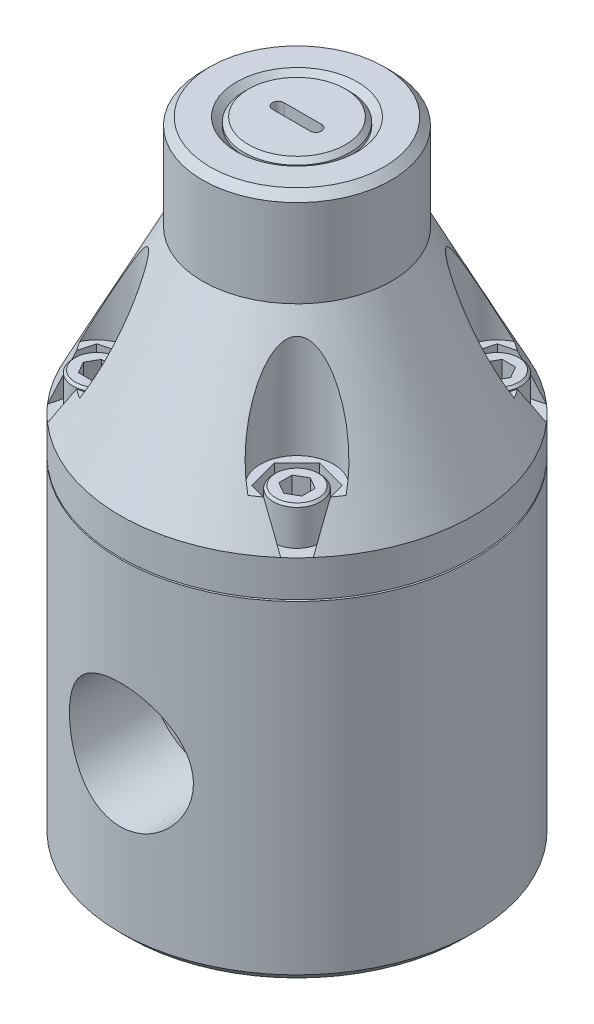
ISO-10303-21;
HEADER;
FILE_DESCRIPTION(('STEP AP214'),'2;1');
FILE_NAME('part.step','',(''),(''),'','','');
FILE_SCHEMA(('AUTOMOTIVE_DESIGN { 1 0 10303 214 1 1 1 1 }'));
ENDSEC;
DATA;
#1=APPLICATION_CONTEXT('core data for automotive mechanical design processes');
#2=APPLICATION_PROTOCOL_DEFINITION('international standard','automotive_design',2000,#1);
#3=PRODUCT_CONTEXT('',#1,'mechanical');
#4=PRODUCT('Part','Part','',(#3));
#5=PRODUCT_RELATED_PRODUCT_CATEGORY('part','',(#4));
#6=PRODUCT_DEFINITION_FORMATION('','',#4);
#7=PRODUCT_DEFINITION_CONTEXT('part definition',#1,'design');
#8=PRODUCT_DEFINITION('design','',#6,#7);
#9=PRODUCT_DEFINITION_SHAPE('','',#8);
#10=(LENGTH_UNIT() NAMED_UNIT(*) SI_UNIT(.MILLI.,.METRE.));
#11=(NAMED_UNIT(*) PLANE_ANGLE_UNIT() SI_UNIT($,.RADIAN.));
#12=(NAMED_UNIT(*) SI_UNIT($,.STERADIAN.) SOLID_ANGLE_UNIT());
#13=UNCERTAINTY_MEASURE_WITH_UNIT(LENGTH_MEASURE(1.E-05),#10,'distance_accuracy_value','');
#14=(GEOMETRIC_REPRESENTATION_CONTEXT(3) GLOBAL_UNCERTAINTY_ASSIGNED_CONTEXT((#13)) GLOBAL_UNIT_ASSIGNED_CONTEXT((#10,
#11,#12)) REPRESENTATION_CONTEXT('',''));
#15=CARTESIAN_POINT('',(0.,0.,0.));
#16=DIRECTION('',(0.,0.,1.));
#17=DIRECTION('',(1.,0.,0.));
#18=AXIS2_PLACEMENT_3D('',#15,#16,#17);
#19=CARTESIAN_POINT('',(0.,62.23,0.));
#20=DIRECTION('',(0.,-1.,0.));
#21=DIRECTION('',(0.,0.,-1.));
#22=AXIS2_PLACEMENT_3D('',#19,#20,#21);
#23=CONICAL_SURFACE('',#22,29.718,0.471096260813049);
#24=CARTESIAN_POINT('',(-22.3373805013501,62.2298,-19.6011992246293));
#25=CARTESIAN_POINT('',(-22.2547645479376,62.7634166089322,-19.2832519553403));
#26=CARTESIAN_POINT('',(-22.1717744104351,63.29612059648,-18.9638646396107));
#27=CARTESIAN_POINT('',(-22.0049530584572,64.3594037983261,-18.3218531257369));
#28=CARTESIAN_POINT('',(-21.9211218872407,64.8899831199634,-17.9992290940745));
#29=CARTESIAN_POINT('',(-21.7525165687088,65.9487768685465,-17.3503519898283));
#30=CARTESIAN_POINT('',(-21.6677424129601,66.4769912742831,-17.0240988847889));
#31=CARTESIAN_POINT('',(-21.4971243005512,67.5307185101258,-16.367475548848));
#32=CARTESIAN_POINT('',(-21.4112802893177,68.0562312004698,-16.0371051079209));
#33=CARTESIAN_POINT('',(-21.3248419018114,68.5802,-15.7044472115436));
#34=B_SPLINE_CURVE_WITH_KNOTS('',3,(#24,#25,#26,#27,#28,#29,#30,#31,#32,#33),.UNSPECIFIED.,.F.,
.F.,(4,2,2,2,4),(0.,1.87988537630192,3.75967455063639,5.63948054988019,7.51938283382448),.UNSPECIFIED.);
#35=CARTESIAN_POINT('',(-22.3373495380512,62.23,-19.6010800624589));
#36=VERTEX_POINT('',#35);
#37=CARTESIAN_POINT('',(-21.324874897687,68.58,-15.7045741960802));
#38=VERTEX_POINT('',#37);
#39=EDGE_CURVE('E627',#36,#38,#34,.T.);
#40=ORIENTED_EDGE('',*,*,#39,.F.);
#41=CARTESIAN_POINT('',(0.,62.23,0.));
#42=DIRECTION('',(0.,-1.,0.));
#43=DIRECTION('',(0.,0.,-1.));
#44=AXIS2_PLACEMENT_3D('',#41,#42,#43);
#45=CIRCLE('',#44,29.718);
#46=CARTESIAN_POINT('',(-22.3373495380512,62.23,19.6010800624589));
#47=VERTEX_POINT('',#46);
#48=EDGE_CURVE('E935',#47,#36,#45,.T.);
#49=ORIENTED_EDGE('',*,*,#48,.F.);
#50=CARTESIAN_POINT('',(-21.3248419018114,68.5802,15.7044472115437));
#51=CARTESIAN_POINT('',(-21.4112802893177,68.0562312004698,16.0371051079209));
#52=CARTESIAN_POINT('',(-21.4971243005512,67.5307185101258,16.367475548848));
#53=CARTESIAN_POINT('',(-21.66774241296,66.4769912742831,17.024098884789));
#54=CARTESIAN_POINT('',(-21.7525165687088,65.9487768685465,17.3503519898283));
#55=CARTESIAN_POINT('',(-21.9211218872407,64.8899831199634,17.9992290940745));
#56=CARTESIAN_POINT('',(-22.0049530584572,64.3594037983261,18.3218531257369));
#57=CARTESIAN_POINT('',(-22.1717744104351,63.29612059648,18.9638646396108));
#58=CARTESIAN_POINT('',(-22.2547645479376,62.7634166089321,19.2832519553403));
#59=CARTESIAN_POINT('',(-22.3373805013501,62.2298,19.6011992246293));
#60=B_SPLINE_CURVE_WITH_KNOTS('',3,(#50,#51,#52,#53,#54,#55,#56,#57,#58,#59),.UNSPECIFIED.,.F.,
.F.,(4,2,2,2,4),(0.,1.87990228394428,3.75970828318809,5.63949745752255,7.51938283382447),.UNSPECIFIED.);
#61=CARTESIAN_POINT('',(-21.324874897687,68.58,15.7045741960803));
#62=VERTEX_POINT('',#61);
#63=EDGE_CURVE('E681',#62,#47,#60,.T.);
#64=ORIENTED_EDGE('',*,*,#63,.F.);
#65=CARTESIAN_POINT('',(0.,68.58,0.));
#66=DIRECTION('',(0.,1.,0.));
#67=DIRECTION('',(0.,0.,1.));
#68=AXIS2_PLACEMENT_3D('',#65,#66,#67);
#69=CIRCLE('',#68,26.4836542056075);
#70=CARTESIAN_POINT('',(-22.3908779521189,68.58,14.1432854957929));
#71=VERTEX_POINT('',#70);
#72=EDGE_CURVE('E1431',#62,#71,#69,.F.);
#73=ORIENTED_EDGE('',*,*,#72,.T.);
#74=CARTESIAN_POINT('',(-22.3909303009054,68.5798,14.143393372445));
#75=CARTESIAN_POINT('',(-22.350304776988,68.7350022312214,14.0596815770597));
#76=CARTESIAN_POINT('',(-22.3081630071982,68.89069928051,13.9776470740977));
#77=CARTESIAN_POINT('',(-22.2210302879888,69.2029732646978,13.8168553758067));
#78=CARTESIAN_POINT('',(-22.1760395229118,69.3595501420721,13.7380979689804));
#79=CARTESIAN_POINT('',(-22.0370947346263,69.8303500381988,13.5066666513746));
#80=CARTESIAN_POINT('',(-21.9391379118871,70.1457572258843,13.3587718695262));
#81=CARTESIAN_POINT('',(-21.7338262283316,70.7787217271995,13.0753567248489));
#82=CARTESIAN_POINT('',(-21.6264783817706,71.0962772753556,12.9398272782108));
#83=CARTESIAN_POINT('',(-21.4032338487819,71.7332404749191,12.6806046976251));
#84=CARTESIAN_POINT('',(-21.2873363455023,72.0526483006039,12.556912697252));
#85=CARTESIAN_POINT('',(-21.0470421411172,72.6946343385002,12.3204109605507));
#86=CARTESIAN_POINT('',(-20.9226003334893,73.0172202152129,12.2076680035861));
#87=CARTESIAN_POINT('',(-20.6663853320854,73.6632945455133,11.9936819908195));
#88=CARTESIAN_POINT('',(-20.5346119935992,73.9867830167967,11.8924391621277));
#89=CARTESIAN_POINT('',(-20.2641447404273,74.6342665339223,11.7013595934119));
#90=CARTESIAN_POINT('',(-20.1254503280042,74.9582616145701,11.6115236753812));
#91=CARTESIAN_POINT('',(-19.8414364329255,75.6062899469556,11.4433041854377));
#92=CARTESIAN_POINT('',(-19.6961171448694,75.9303231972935,11.3649202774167));
#93=CARTESIAN_POINT('',(-19.3211632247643,76.7476954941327,11.1817059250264));
#94=CARTESIAN_POINT('',(-19.0872302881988,77.2408247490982,11.0845248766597));
#95=CARTESIAN_POINT('',(-18.7249280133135,77.9784605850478,10.9599064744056));
#96=CARTESIAN_POINT('',(-18.6022415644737,78.2240315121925,10.9218885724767));
#97=CARTESIAN_POINT('',(-18.3529388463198,78.7141977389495,10.8531925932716));
#98=CARTESIAN_POINT('',(-18.2263228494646,78.9587931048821,10.8225140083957));
#99=CARTESIAN_POINT('',(-17.9690231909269,79.4465771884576,10.7688733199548));
#100=CARTESIAN_POINT('',(-17.8383410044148,79.6897663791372,10.7459084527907));
#101=CARTESIAN_POINT('',(-17.5726008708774,80.1743656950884,10.7081842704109));
#102=CARTESIAN_POINT('',(-17.4375433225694,80.4157759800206,10.693424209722));
#103=CARTESIAN_POINT('',(-17.1627429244,80.8961071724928,10.6727907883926));
#104=CARTESIAN_POINT('',(-17.0230031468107,81.1350295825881,10.6669117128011));
#105=CARTESIAN_POINT('',(-16.7382475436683,81.6097183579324,10.6649433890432));
#106=CARTESIAN_POINT('',(-16.5932325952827,81.8454852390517,10.6688525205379));
#107=CARTESIAN_POINT('',(-16.2968182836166,82.3133650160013,10.6877509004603));
#108=CARTESIAN_POINT('',(-16.1454043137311,82.5454676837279,10.7027669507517));
#109=CARTESIAN_POINT('',(-15.8354539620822,83.0038758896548,10.7457309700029));
#110=CARTESIAN_POINT('',(-15.6769137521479,83.2301782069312,10.7736859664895));
#111=CARTESIAN_POINT('',(-15.3515270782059,83.6741617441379,10.8451251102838));
#112=CARTESIAN_POINT('',(-15.1846866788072,83.8918490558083,10.8885980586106));
#113=CARTESIAN_POINT('',(-14.9269806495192,84.2084557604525,10.9683843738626));
#114=CARTESIAN_POINT('',(-14.839881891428,84.3122892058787,10.997391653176));
#115=CARTESIAN_POINT('',(-14.6629301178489,84.515808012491,11.0609509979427));
#116=CARTESIAN_POINT('',(-14.5730777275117,84.6154943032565,11.0955018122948));
#117=CARTESIAN_POINT('',(-14.3891167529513,84.8109037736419,11.1714874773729));
#118=CARTESIAN_POINT('',(-14.2949676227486,84.9065572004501,11.2130072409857));
#119=CARTESIAN_POINT('',(-14.1034347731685,85.0907355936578,11.3035808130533));
#120=CARTESIAN_POINT('',(-14.0060494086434,85.1792568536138,11.3526385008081));
#121=CARTESIAN_POINT('',(-13.7101223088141,85.429646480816,11.5123405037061));
#122=CARTESIAN_POINT('',(-13.5060546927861,85.5782916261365,11.6361944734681));
#123=CARTESIAN_POINT('',(-13.1996116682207,85.7493306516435,11.8507095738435));
#124=CARTESIAN_POINT('',(-13.0998509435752,85.7971000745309,11.9248690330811));
#125=CARTESIAN_POINT('',(-12.900706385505,85.873763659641,12.0829789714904));
#126=CARTESIAN_POINT('',(-12.8013223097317,85.9026733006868,12.1669213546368));
#127=CARTESIAN_POINT('',(-12.6053038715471,85.9385908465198,12.3437610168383));
#128=CARTESIAN_POINT('',(-12.5086917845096,85.9454540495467,12.4367133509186));
#129=CARTESIAN_POINT('',(-12.3223166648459,85.9359739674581,12.6281475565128));
#130=CARTESIAN_POINT('',(-12.2325552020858,85.9196253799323,12.7266306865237));
#131=CARTESIAN_POINT('',(-12.0684910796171,85.8677160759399,12.9184346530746));
#132=CARTESIAN_POINT('',(-11.9935403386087,85.8336265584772,13.0116153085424));
#133=CARTESIAN_POINT('',(-11.8522698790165,85.7502029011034,13.1975950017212));
#134=CARTESIAN_POINT('',(-11.7859543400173,85.7008614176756,13.290393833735));
#135=CARTESIAN_POINT('',(-11.6163662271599,85.5496530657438,13.5413620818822));
#136=CARTESIAN_POINT('',(-11.5214197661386,85.4357254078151,13.6978402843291));
#137=CARTESIAN_POINT('',(-11.3524385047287,85.1845941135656,14.0032728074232));
#138=CARTESIAN_POINT('',(-11.2784789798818,85.0473094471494,14.1521985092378));
#139=CARTESIAN_POINT('',(-11.1484302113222,84.7600134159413,14.44015441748));
#140=CARTESIAN_POINT('',(-11.0920802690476,84.6102339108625,14.5793027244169));
#141=CARTESIAN_POINT('',(-10.9925096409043,84.3006741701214,14.851149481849));
#142=CARTESIAN_POINT('',(-10.9493023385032,84.1408839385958,14.9838412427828));
#143=CARTESIAN_POINT('',(-10.8736636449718,83.8139640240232,15.2438249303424));
#144=CARTESIAN_POINT('',(-10.8412572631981,83.6468183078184,15.3711037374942));
#145=CARTESIAN_POINT('',(-10.7856662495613,83.307480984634,15.6206584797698));
#146=CARTESIAN_POINT('',(-10.7624784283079,83.1352911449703,15.7429361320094));
#147=CARTESIAN_POINT('',(-10.7205377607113,82.7552655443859,16.0051192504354));
#148=CARTESIAN_POINT('',(-10.7033691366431,82.5466647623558,16.1441638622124));
#149=CARTESIAN_POINT('',(-10.6786273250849,82.125493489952,16.4170496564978));
#150=CARTESIAN_POINT('',(-10.6710565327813,81.9129220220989,16.5508895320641));
#151=CARTESIAN_POINT('',(-10.664422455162,81.4846459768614,16.8140587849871));
#152=CARTESIAN_POINT('',(-10.6653663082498,81.2689389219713,16.9433842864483));
#153=CARTESIAN_POINT('',(-10.674967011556,80.8352423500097,17.1978874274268));
#154=CARTESIAN_POINT('',(-10.6836247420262,80.6172525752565,17.323064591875));
#155=CARTESIAN_POINT('',(-10.7080782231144,80.178919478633,17.5699535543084));
#156=CARTESIAN_POINT('',(-10.7238938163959,79.9585712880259,17.691654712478));
#157=CARTESIAN_POINT('',(-10.7622068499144,79.516512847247,17.9314908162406));
#158=CARTESIAN_POINT('',(-10.7847047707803,79.2948025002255,18.0496255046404));
#159=CARTESIAN_POINT('',(-10.8616544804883,78.628245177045,18.3989144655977));
#160=CARTESIAN_POINT('',(-10.9255713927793,78.1818168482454,18.6250403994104));
#161=CARTESIAN_POINT('',(-11.0664102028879,77.3479438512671,19.0346218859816));
#162=CARTESIAN_POINT('',(-11.1403619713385,76.9607742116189,19.2196861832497));
#163=CARTESIAN_POINT('',(-11.3050181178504,76.1856258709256,19.5805572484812));
#164=CARTESIAN_POINT('',(-11.3957241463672,75.7976470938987,19.7563631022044));
#165=CARTESIAN_POINT('',(-11.5935742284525,75.0216151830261,20.0985507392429));
#166=CARTESIAN_POINT('',(-11.7007221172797,74.6335620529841,20.264930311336));
#167=CARTESIAN_POINT('',(-11.9313879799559,73.8581881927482,20.5877481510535));
#168=CARTESIAN_POINT('',(-12.0549056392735,73.470867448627,20.7441866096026));
#169=CARTESIAN_POINT('',(-12.3163714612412,72.7038997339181,21.0439307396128));
#170=CARTESIAN_POINT('',(-12.4540552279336,72.3242296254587,21.1874073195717));
#171=CARTESIAN_POINT('',(-12.7458005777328,71.5671030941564,21.4629534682));
#172=CARTESIAN_POINT('',(-12.8998598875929,71.1896463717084,21.5950246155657));
#173=CARTESIAN_POINT('',(-13.2250025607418,70.4376533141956,21.8464430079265));
#174=CARTESIAN_POINT('',(-13.396090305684,70.0631177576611,21.9657869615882));
#175=CARTESIAN_POINT('',(-13.6660711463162,69.5043911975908,22.1338540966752));
#176=CARTESIAN_POINT('',(-13.7583155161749,69.3186135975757,22.1880644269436));
#177=CARTESIAN_POINT('',(-13.9473861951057,68.9482602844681,22.2925349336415));
#178=CARTESIAN_POINT('',(-14.044212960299,68.7636846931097,22.3427947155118));
#179=CARTESIAN_POINT('',(-14.1433933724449,68.5798000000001,22.3909303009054));
#180=B_SPLINE_CURVE_WITH_KNOTS('',3,(#74,#75,#76,#77,#78,#79,#80,#81,#82,#83,#84,#85,#86,#87,
#88,#89,#90,#91,#92,#93,#94,#95,#96,#97,#98,#99,#100,#101,#102,#103,#104,#105,#106,#107,#108,
#109,#110,#111,#112,#113,#114,#115,#116,#117,#118,#119,#120,#121,#122,#123,#124,#125,#126,#127,
#128,#129,#130,#131,#132,#133,#134,#135,#136,#137,#138,#139,#140,#141,#142,#143,#144,#145,#146,
#147,#148,#149,#150,#151,#152,#153,#154,#155,#156,#157,#158,#159,#160,#161,#162,#163,#164,#165,
#166,#167,#168,#169,#170,#171,#172,#173,#174,#175,#176,#177,#178,#179),.UNSPECIFIED.,.F.,.F.,(4,
2,2,2,2,2,2,2,2,2,2,2,2,2,2,2,2,2,2,2,2,2,2,2,2,2,2,2,2,2,2,2,2,2,2,2,2,2,2,2,2,2,2,2,2,2,2,2,2,
2,2,2,4),(0.,0.542840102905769,1.08564511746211,2.17085376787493,3.25525867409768,
4.33976732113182,5.43052218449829,6.5212985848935,7.61215354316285,8.70297647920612,
10.3650975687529,11.196398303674,12.027641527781,12.8585866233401,13.6894562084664,
14.5197908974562,15.3499881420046,16.1821952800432,17.014854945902,17.8469149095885,
18.2625409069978,18.6780732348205,19.0990950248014,19.5203342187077,20.354755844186,
20.7529146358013,21.1507462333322,21.5511837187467,21.9517126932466,22.32334462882,
22.6951557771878,23.3381727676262,23.9834677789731,24.6186994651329,25.2545758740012,
25.8919145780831,26.5290325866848,27.2825500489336,28.0362555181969,28.7905929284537,
29.5450164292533,30.3015442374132,31.0581264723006,32.5707579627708,33.8767149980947,
35.1828007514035,36.4891916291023,37.7955574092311,39.0808873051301,40.3660390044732,
41.6515222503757,42.2946005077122,42.9377429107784),.UNSPECIFIED.);
#181=CARTESIAN_POINT('',(-14.1432854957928,68.58,22.390877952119));
#182=VERTEX_POINT('',#181);
#183=EDGE_CURVE('E1425',#71,#182,#180,.T.);
#184=ORIENTED_EDGE('',*,*,#183,.T.);
#185=CARTESIAN_POINT('',(-15.7045741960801,68.58,21.3248748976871));
#186=VERTEX_POINT('',#185);
#187=EDGE_CURVE('E1358',#182,#186,#69,.F.);
#188=ORIENTED_EDGE('',*,*,#187,.T.);
#189=CARTESIAN_POINT('',(-19.6011992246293,62.2298,22.3373805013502));
#190=CARTESIAN_POINT('',(-19.2832519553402,62.7634166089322,22.2547645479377));
#191=CARTESIAN_POINT('',(-18.9638646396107,63.29612059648,22.1717744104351));
#192=CARTESIAN_POINT('',(-18.3218531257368,64.3594037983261,22.0049530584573));
#193=CARTESIAN_POINT('',(-17.9992290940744,64.8899831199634,21.9211218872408));
#194=CARTESIAN_POINT('',(-17.3503519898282,65.9487768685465,21.7525165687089));
#195=CARTESIAN_POINT('',(-17.0240988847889,66.4769912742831,21.6677424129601));
#196=CARTESIAN_POINT('',(-16.3674755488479,67.5307185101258,21.4971243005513));
#197=CARTESIAN_POINT('',(-16.0371051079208,68.0562312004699,21.4112802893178));
#198=CARTESIAN_POINT('',(-15.7044472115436,68.5802,21.3248419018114));
#199=B_SPLINE_CURVE_WITH_KNOTS('',3,(#189,#190,#191,#192,#193,#194,#195,#196,#197,#198),
.UNSPECIFIED.,.F.,.F.,(4,2,2,2,4),(0.,1.87988537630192,3.75967455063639,5.63948054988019,
7.51938283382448),.UNSPECIFIED.);
#200=CARTESIAN_POINT('',(-19.6010800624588,62.23,22.3373495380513));
#201=VERTEX_POINT('',#200);
#202=EDGE_CURVE('E674',#201,#186,#199,.T.);
#203=ORIENTED_EDGE('',*,*,#202,.F.);
#204=CARTESIAN_POINT('',(19.601080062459,62.23,22.3373495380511));
#205=VERTEX_POINT('',#204);
#206=EDGE_CURVE('E948',#205,#201,#45,.T.);
#207=ORIENTED_EDGE('',*,*,#206,.F.);
#208=CARTESIAN_POINT('',(15.7044472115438,68.5802,21.3248419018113));
#209=CARTESIAN_POINT('',(16.037105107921,68.0562312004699,21.4112802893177));
#210=CARTESIAN_POINT('',(16.3674755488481,67.5307185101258,21.4971243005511));
#211=CARTESIAN_POINT('',(17.024098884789,66.4769912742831,21.66774241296));
#212=CARTESIAN_POINT('',(17.3503519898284,65.9487768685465,21.7525165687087));
#213=CARTESIAN_POINT('',(17.9992290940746,64.8899831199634,21.9211218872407));
#214=CARTESIAN_POINT('',(18.321853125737,64.3594037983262,22.0049530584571));
#215=CARTESIAN_POINT('',(18.9638646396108,63.29612059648,22.171774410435));
#216=CARTESIAN_POINT('',(19.2832519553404,62.7634166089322,22.2547645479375));
#217=CARTESIAN_POINT('',(19.6011992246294,62.2298,22.33738050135));
#218=B_SPLINE_CURVE_WITH_KNOTS('',3,(#208,#209,#210,#211,#212,#213,#214,#215,#216,#217),
.UNSPECIFIED.,.F.,.F.,(4,2,2,2,4),(0.,1.87990228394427,3.75970828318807,5.63949745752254,
7.51938283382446),.UNSPECIFIED.);
#219=CARTESIAN_POINT('',(15.7045741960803,68.58,21.3248748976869));
#220=VERTEX_POINT('',#219);
#221=EDGE_CURVE('E712',#220,#205,#218,.T.);
#222=ORIENTED_EDGE('',*,*,#221,.F.);
#223=CARTESIAN_POINT('',(0.,68.58,0.));
#224=DIRECTION('',(0.,1.,0.));
#225=DIRECTION('',(0.,0.,1.));
#226=AXIS2_PLACEMENT_3D('',#223,#224,#225);
#227=CIRCLE('',#226,26.4836542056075);
#228=CARTESIAN_POINT('',(14.143285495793,68.58,22.3908779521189));
#229=VERTEX_POINT('',#228);
#230=EDGE_CURVE('E979',#220,#229,#227,.F.);
#231=ORIENTED_EDGE('',*,*,#230,.T.);
#232=CARTESIAN_POINT('',(14.1433933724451,68.5798,22.3909303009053));
#233=CARTESIAN_POINT('',(14.0596815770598,68.7350022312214,22.3503047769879));
#234=CARTESIAN_POINT('',(13.9776470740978,68.89069928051,22.3081630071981));
#235=CARTESIAN_POINT('',(13.8168553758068,69.2029732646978,22.2210302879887));
#236=CARTESIAN_POINT('',(13.7380979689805,69.3595501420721,22.1760395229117));
#237=CARTESIAN_POINT('',(13.5066666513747,69.8303500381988,22.0370947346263));
#238=CARTESIAN_POINT('',(13.3587718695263,70.1457572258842,21.939137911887));
#239=CARTESIAN_POINT('',(13.075356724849,70.7787217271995,21.7338262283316));
#240=CARTESIAN_POINT('',(12.9398272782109,71.0962772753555,21.6264783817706));
#241=CARTESIAN_POINT('',(12.6806046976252,71.7332404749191,21.4032338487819));
#242=CARTESIAN_POINT('',(12.5569126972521,72.0526483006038,21.2873363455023));
#243=CARTESIAN_POINT('',(12.3204109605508,72.6946343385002,21.0470421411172));
#244=CARTESIAN_POINT('',(12.2076680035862,73.0172202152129,20.9226003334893));
#245=CARTESIAN_POINT('',(11.9936819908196,73.6632945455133,20.6663853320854));
#246=CARTESIAN_POINT('',(11.8924391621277,73.9867830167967,20.5346119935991));
#247=CARTESIAN_POINT('',(11.7013595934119,74.6342665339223,20.2641447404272));
#248=CARTESIAN_POINT('',(11.6115236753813,74.9582616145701,20.1254503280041));
#249=CARTESIAN_POINT('',(11.4433041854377,75.6062899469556,19.8414364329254));
#250=CARTESIAN_POINT('',(11.3649202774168,75.9303231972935,19.6961171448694));
#251=CARTESIAN_POINT('',(11.1817059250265,76.7476954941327,19.3211632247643));
#252=CARTESIAN_POINT('',(11.0845248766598,77.2408247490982,19.0872302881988));
#253=CARTESIAN_POINT('',(10.9599064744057,77.9784605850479,18.7249280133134));
#254=CARTESIAN_POINT('',(10.9218885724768,78.2240315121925,18.6022415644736));
#255=CARTESIAN_POINT('',(10.8531925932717,78.7141977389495,18.3529388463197));
#256=CARTESIAN_POINT('',(10.8225140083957,78.9587931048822,18.2263228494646));
#257=CARTESIAN_POINT('',(10.7688733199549,79.4465771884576,17.9690231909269));
#258=CARTESIAN_POINT('',(10.7459084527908,79.6897663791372,17.8383410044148));
#259=CARTESIAN_POINT('',(10.7081842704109,80.1743656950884,17.5726008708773));
#260=CARTESIAN_POINT('',(10.6934242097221,80.4157759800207,17.4375433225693));
#261=CARTESIAN_POINT('',(10.6727907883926,80.8961071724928,17.1627429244));
#262=CARTESIAN_POINT('',(10.6669117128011,81.1350295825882,17.0230031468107));
#263=CARTESIAN_POINT('',(10.6649433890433,81.6097183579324,16.7382475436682));
#264=CARTESIAN_POINT('',(10.668852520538,81.8454852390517,16.5932325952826));
#265=CARTESIAN_POINT('',(10.6877509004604,82.3133650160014,16.2968182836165));
#266=CARTESIAN_POINT('',(10.7027669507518,82.545467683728,16.1454043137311));
#267=CARTESIAN_POINT('',(10.745730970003,83.0038758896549,15.8354539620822));
#268=CARTESIAN_POINT('',(10.7736859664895,83.2301782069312,15.6769137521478));
#269=CARTESIAN_POINT('',(10.8451251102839,83.6741617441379,15.3515270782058));
#270=CARTESIAN_POINT('',(10.8885980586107,83.8918490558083,15.1846866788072));
#271=CARTESIAN_POINT('',(10.9683843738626,84.2084557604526,14.9269806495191));
#272=CARTESIAN_POINT('',(10.997391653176,84.3122892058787,14.8398818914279));
#273=CARTESIAN_POINT('',(11.0609509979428,84.515808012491,14.6629301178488));
#274=CARTESIAN_POINT('',(11.0955018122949,84.6154943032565,14.5730777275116));
#275=CARTESIAN_POINT('',(11.171487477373,84.8109037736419,14.3891167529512));
#276=CARTESIAN_POINT('',(11.2130072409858,84.9065572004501,14.2949676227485));
#277=CARTESIAN_POINT('',(11.3035808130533,85.0907355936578,14.1034347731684));
#278=CARTESIAN_POINT('',(11.3526385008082,85.1792568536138,14.0060494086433));
#279=CARTESIAN_POINT('',(11.5123405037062,85.4296464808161,13.710122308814));
#280=CARTESIAN_POINT('',(11.6361944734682,85.5782916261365,13.506054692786));
#281=CARTESIAN_POINT('',(11.8507095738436,85.7493306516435,13.1996116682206));
#282=CARTESIAN_POINT('',(11.9248690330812,85.797100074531,13.0998509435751));
#283=CARTESIAN_POINT('',(12.0829789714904,85.873763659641,12.9007063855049));
#284=CARTESIAN_POINT('',(12.1669213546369,85.9026733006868,12.8013223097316));
#285=CARTESIAN_POINT('',(12.3437610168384,85.9385908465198,12.605303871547));
#286=CARTESIAN_POINT('',(12.4367133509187,85.9454540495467,12.5086917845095));
#287=CARTESIAN_POINT('',(12.6281475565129,85.9359739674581,12.3223166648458));
#288=CARTESIAN_POINT('',(12.7266306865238,85.9196253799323,12.2325552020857));
#289=CARTESIAN_POINT('',(12.9184346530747,85.8677160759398,12.068491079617));
#290=CARTESIAN_POINT('',(13.0116153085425,85.8336265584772,11.9935403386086));
#291=CARTESIAN_POINT('',(13.1975950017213,85.7502029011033,11.8522698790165));
#292=CARTESIAN_POINT('',(13.2903938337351,85.7008614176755,11.7859543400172));
#293=CARTESIAN_POINT('',(13.5413620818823,85.5496530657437,11.6163662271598));
#294=CARTESIAN_POINT('',(13.6978402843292,85.435725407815,11.5214197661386));
#295=CARTESIAN_POINT('',(14.0032728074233,85.1845941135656,11.3524385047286));
#296=CARTESIAN_POINT('',(14.1521985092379,85.0473094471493,11.2784789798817));
#297=CARTESIAN_POINT('',(14.4401544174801,84.7600134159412,11.1484302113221));
#298=CARTESIAN_POINT('',(14.579302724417,84.6102339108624,11.0920802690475));
#299=CARTESIAN_POINT('',(14.8511494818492,84.3006741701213,10.9925096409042));
#300=CARTESIAN_POINT('',(14.983841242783,84.1408839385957,10.9493023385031));
#301=CARTESIAN_POINT('',(15.2438249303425,83.813964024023,10.8736636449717));
#302=CARTESIAN_POINT('',(15.3711037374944,83.6468183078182,10.841257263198));
#303=CARTESIAN_POINT('',(15.62065847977,83.3074809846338,10.7856662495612));
#304=CARTESIAN_POINT('',(15.7429361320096,83.1352911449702,10.7624784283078));
#305=CARTESIAN_POINT('',(16.0051192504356,82.7552655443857,10.7205377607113));
#306=CARTESIAN_POINT('',(16.1441638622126,82.5466647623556,10.703369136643));
#307=CARTESIAN_POINT('',(16.417049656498,82.1254934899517,10.6786273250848));
#308=CARTESIAN_POINT('',(16.5508895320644,81.9129220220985,10.6710565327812));
#309=CARTESIAN_POINT('',(16.8140587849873,81.4846459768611,10.6644224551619));
#310=CARTESIAN_POINT('',(16.9433842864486,81.2689389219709,10.6653663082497));
#311=CARTESIAN_POINT('',(17.1978874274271,80.8352423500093,10.674967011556));
#312=CARTESIAN_POINT('',(17.3230645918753,80.6172525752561,10.6836247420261));
#313=CARTESIAN_POINT('',(17.5699535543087,80.1789194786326,10.7080782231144));
#314=CARTESIAN_POINT('',(17.6916547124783,79.9585712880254,10.7238938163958));
#315=CARTESIAN_POINT('',(17.9314908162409,79.5165128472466,10.7622068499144));
#316=CARTESIAN_POINT('',(18.0496255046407,79.294802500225,10.7847047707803));
#317=CARTESIAN_POINT('',(18.398914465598,78.6282451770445,10.8616544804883));
#318=CARTESIAN_POINT('',(18.6250403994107,78.1818168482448,10.9255713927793));
#319=CARTESIAN_POINT('',(19.0346218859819,77.3479438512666,11.0664102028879));
#320=CARTESIAN_POINT('',(19.21968618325,76.9607742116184,11.1403619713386));
#321=CARTESIAN_POINT('',(19.5805572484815,76.1856258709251,11.3050181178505));
#322=CARTESIAN_POINT('',(19.7563631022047,75.7976470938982,11.3957241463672));
#323=CARTESIAN_POINT('',(20.0985507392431,75.0216151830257,11.5935742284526));
#324=CARTESIAN_POINT('',(20.2649303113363,74.6335620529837,11.7007221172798));
#325=CARTESIAN_POINT('',(20.5877481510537,73.8581881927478,11.9313879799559));
#326=CARTESIAN_POINT('',(20.7441866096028,73.4708674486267,12.0549056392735));
#327=CARTESIAN_POINT('',(21.0439307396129,72.7038997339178,12.3163714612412));
#328=CARTESIAN_POINT('',(21.1874073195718,72.3242296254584,12.4540552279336));
#329=CARTESIAN_POINT('',(21.4629534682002,71.5671030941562,12.7458005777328));
#330=CARTESIAN_POINT('',(21.5950246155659,71.1896463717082,12.8998598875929));
#331=CARTESIAN_POINT('',(21.8464430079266,70.4376533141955,13.2250025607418));
#332=CARTESIAN_POINT('',(21.9657869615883,70.0631177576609,13.396090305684));
#333=CARTESIAN_POINT('',(22.1338540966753,69.5043911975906,13.6660711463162));
#334=CARTESIAN_POINT('',(22.1880644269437,69.3186135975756,13.7583155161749));
#335=CARTESIAN_POINT('',(22.2925349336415,68.948260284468,13.9473861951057));
#336=CARTESIAN_POINT('',(22.3427947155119,68.7636846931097,14.0442129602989));
#337=CARTESIAN_POINT('',(22.3909303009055,68.5798,14.1433933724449));
#338=B_SPLINE_CURVE_WITH_KNOTS('',3,(#232,#233,#234,#235,#236,#237,#238,#239,#240,#241,#242,
#243,#244,#245,#246,#247,#248,#249,#250,#251,#252,#253,#254,#255,#256,#257,#258,#259,#260,#261,
#262,#263,#264,#265,#266,#267,#268,#269,#270,#271,#272,#273,#274,#275,#276,#277,#278,#279,#280,
#281,#282,#283,#284,#285,#286,#287,#288,#289,#290,#291,#292,#293,#294,#295,#296,#297,#298,#299,
#300,#301,#302,#303,#304,#305,#306,#307,#308,#309,#310,#311,#312,#313,#314,#315,#316,#317,#318,
#319,#320,#321,#322,#323,#324,#325,#326,#327,#328,#329,#330,#331,#332,#333,#334,#335,#336,#337),
.UNSPECIFIED.,.F.,.F.,(4,2,2,2,2,2,2,2,2,2,2,2,2,2,2,2,2,2,2,2,2,2,2,2,2,2,2,2,2,2,2,2,2,2,2,2,
2,2,2,2,2,2,2,2,2,2,2,2,2,2,2,2,4),(0.,0.542840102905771,1.08564511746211,2.17085376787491,
3.25525867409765,4.3397673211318,5.43052218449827,6.52129858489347,7.61215354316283,
8.7029764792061,10.3650975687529,11.196398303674,12.0276415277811,12.8585866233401,
13.6894562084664,14.5197908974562,15.3499881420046,16.1821952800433,17.0148549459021,
17.8469149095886,18.2625409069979,18.6780732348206,19.0990950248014,19.5203342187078,
20.3547558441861,20.7529146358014,21.1507462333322,21.5511837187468,21.9517126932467,
22.3233446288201,22.6951557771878,23.3381727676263,23.9834677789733,24.618699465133,
25.2545758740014,25.8919145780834,26.529032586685,27.2825500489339,28.0362555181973,
28.7905929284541,29.5450164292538,30.3015442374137,31.0581264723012,32.5707579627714,
33.8767149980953,35.182800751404,36.4891916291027,37.7955574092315,39.0808873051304,
40.3660390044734,41.6515222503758,42.2946005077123,42.9377429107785),.UNSPECIFIED.);
#339=CARTESIAN_POINT('',(22.390877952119,68.58,14.1432854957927));
#340=VERTEX_POINT('',#339);
#341=EDGE_CURVE('E1432',#229,#340,#338,.T.);
#342=ORIENTED_EDGE('',*,*,#341,.T.);
#343=CARTESIAN_POINT('',(21.3248748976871,68.58,15.7045741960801));
#344=VERTEX_POINT('',#343);
#345=EDGE_CURVE('E989',#340,#344,#227,.F.);
#346=ORIENTED_EDGE('',*,*,#345,.T.);
#347=CARTESIAN_POINT('',(22.3373805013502,62.2298,19.6011992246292));
#348=CARTESIAN_POINT('',(22.2547645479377,62.7634166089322,19.2832519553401));
#349=CARTESIAN_POINT('',(22.1717744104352,63.29612059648,18.9638646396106));
#350=CARTESIAN_POINT('',(22.0049530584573,64.3594037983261,18.3218531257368));
#351=CARTESIAN_POINT('',(21.9211218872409,64.8899831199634,17.9992290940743));
#352=CARTESIAN_POINT('',(21.752516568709,65.9487768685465,17.3503519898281));
#353=CARTESIAN_POINT('',(21.6677424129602,66.4769912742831,17.0240988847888));
#354=CARTESIAN_POINT('',(21.4971243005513,67.5307185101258,16.3674755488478));
#355=CARTESIAN_POINT('',(21.4112802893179,68.0562312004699,16.0371051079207));
#356=CARTESIAN_POINT('',(21.3248419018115,68.5802,15.7044472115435));
#357=B_SPLINE_CURVE_WITH_KNOTS('',3,(#347,#348,#349,#350,#351,#352,#353,#354,#355,#356),
.UNSPECIFIED.,.F.,.F.,(4,2,2,2,4),(0.,1.87988537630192,3.75967455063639,5.63948054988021,
7.51938283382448),.UNSPECIFIED.);
#358=CARTESIAN_POINT('',(22.3373495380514,62.23,19.6010800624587));
#359=VERTEX_POINT('',#358);
#360=EDGE_CURVE('E725',#359,#344,#357,.T.);
#361=ORIENTED_EDGE('',*,*,#360,.F.);
#362=CARTESIAN_POINT('',(22.3373495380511,62.23,-19.6010800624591));
#363=VERTEX_POINT('',#362);
#364=EDGE_CURVE('E854',#363,#359,#45,.T.);
#365=ORIENTED_EDGE('',*,*,#364,.F.);
#366=CARTESIAN_POINT('',(21.3248419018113,68.5802,-15.7044472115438));
#367=CARTESIAN_POINT('',(21.4112802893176,68.0562312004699,-16.037105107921));
#368=CARTESIAN_POINT('',(21.4971243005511,67.5307185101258,-16.3674755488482));
#369=CARTESIAN_POINT('',(21.6677424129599,66.4769912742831,-17.0240988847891));
#370=CARTESIAN_POINT('',(21.7525165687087,65.9487768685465,-17.3503519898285));
#371=CARTESIAN_POINT('',(21.9211218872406,64.8899831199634,-17.9992290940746));
#372=CARTESIAN_POINT('',(22.004953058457,64.3594037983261,-18.3218531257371));
#373=CARTESIAN_POINT('',(22.1717744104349,63.29612059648,-18.9638646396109));
#374=CARTESIAN_POINT('',(22.2547645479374,62.7634166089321,-19.2832519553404));
#375=CARTESIAN_POINT('',(22.3373805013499,62.2298,-19.6011992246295));
#376=B_SPLINE_CURVE_WITH_KNOTS('',3,(#366,#367,#368,#369,#370,#371,#372,#373,#374,#375),
.UNSPECIFIED.,.F.,.F.,(4,2,2,2,4),(0.,1.87990228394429,3.75970828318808,5.63949745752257,
7.51938283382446),.UNSPECIFIED.);
#377=CARTESIAN_POINT('',(21.3248748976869,68.58,-15.7045741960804));
#378=VERTEX_POINT('',#377);
#379=EDGE_CURVE('E774',#378,#363,#376,.T.);
#380=ORIENTED_EDGE('',*,*,#379,.F.);
#381=CARTESIAN_POINT('',(0.,68.58,0.));
#382=DIRECTION('',(0.,1.,0.));
#383=DIRECTION('',(0.,0.,1.));
#384=AXIS2_PLACEMENT_3D('',#381,#382,#383);
#385=CIRCLE('',#384,26.4836542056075);
#386=CARTESIAN_POINT('',(22.3908779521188,68.58,-14.1432854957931));
#387=VERTEX_POINT('',#386);
#388=EDGE_CURVE('E977',#378,#387,#385,.F.);
#389=ORIENTED_EDGE('',*,*,#388,.T.);
#390=CARTESIAN_POINT('',(22.3909303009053,68.5798000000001,-14.1433933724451));
#391=CARTESIAN_POINT('',(22.3503047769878,68.7350022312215,-14.0596815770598));
#392=CARTESIAN_POINT('',(22.3081630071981,68.8906992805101,-13.9776470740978));
#393=CARTESIAN_POINT('',(22.2210302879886,69.2029732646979,-13.8168553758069));
#394=CARTESIAN_POINT('',(22.1760395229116,69.3595501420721,-13.7380979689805));
#395=CARTESIAN_POINT('',(22.0370947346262,69.8303500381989,-13.5066666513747));
#396=CARTESIAN_POINT('',(21.939137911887,70.1457572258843,-13.3587718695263));
#397=CARTESIAN_POINT('',(21.7338262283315,70.7787217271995,-13.075356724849));
#398=CARTESIAN_POINT('',(21.6264783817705,71.0962772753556,-12.9398272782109));
#399=CARTESIAN_POINT('',(21.4032338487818,71.7332404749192,-12.6806046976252));
#400=CARTESIAN_POINT('',(21.2873363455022,72.0526483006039,-12.5569126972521));
#401=CARTESIAN_POINT('',(21.0470421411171,72.6946343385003,-12.3204109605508));
#402=CARTESIAN_POINT('',(20.9226003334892,73.017220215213,-12.2076680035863));
#403=CARTESIAN_POINT('',(20.6663853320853,73.6632945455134,-11.9936819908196));
#404=CARTESIAN_POINT('',(20.5346119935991,73.9867830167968,-11.8924391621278));
#405=CARTESIAN_POINT('',(20.2641447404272,74.6342665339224,-11.701359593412));
#406=CARTESIAN_POINT('',(20.1254503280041,74.9582616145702,-11.6115236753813));
#407=CARTESIAN_POINT('',(19.8414364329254,75.6062899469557,-11.4433041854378));
#408=CARTESIAN_POINT('',(19.6961171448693,75.9303231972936,-11.3649202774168));
#409=CARTESIAN_POINT('',(19.3211632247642,76.7476954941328,-11.1817059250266));
#410=CARTESIAN_POINT('',(19.0872302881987,77.2408247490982,-11.0845248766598));
#411=CARTESIAN_POINT('',(18.7249280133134,77.9784605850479,-10.9599064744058));
#412=CARTESIAN_POINT('',(18.6022415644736,78.2240315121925,-10.9218885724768));
#413=CARTESIAN_POINT('',(18.3529388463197,78.7141977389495,-10.8531925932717));
#414=CARTESIAN_POINT('',(18.2263228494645,78.9587931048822,-10.8225140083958));
#415=CARTESIAN_POINT('',(17.9690231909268,79.4465771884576,-10.7688733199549));
#416=CARTESIAN_POINT('',(17.8383410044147,79.6897663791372,-10.7459084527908));
#417=CARTESIAN_POINT('',(17.5726008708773,80.1743656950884,-10.708184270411));
#418=CARTESIAN_POINT('',(17.4375433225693,80.4157759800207,-10.6934242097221));
#419=CARTESIAN_POINT('',(17.1627429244,80.8961071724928,-10.6727907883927));
#420=CARTESIAN_POINT('',(17.0230031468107,81.1350295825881,-10.6669117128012));
#421=CARTESIAN_POINT('',(16.7382475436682,81.6097183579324,-10.6649433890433));
#422=CARTESIAN_POINT('',(16.5932325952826,81.8454852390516,-10.668852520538));
#423=CARTESIAN_POINT('',(16.2968182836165,82.3133650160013,-10.6877509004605));
#424=CARTESIAN_POINT('',(16.1454043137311,82.5454676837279,-10.7027669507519));
#425=CARTESIAN_POINT('',(15.8354539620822,83.0038758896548,-10.745730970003));
#426=CARTESIAN_POINT('',(15.6769137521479,83.2301782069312,-10.7736859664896));
#427=CARTESIAN_POINT('',(15.3515270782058,83.6741617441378,-10.8451251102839));
#428=CARTESIAN_POINT('',(15.1846866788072,83.8918490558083,-10.8885980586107));
#429=CARTESIAN_POINT('',(14.9269806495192,84.2084557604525,-10.9683843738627));
#430=CARTESIAN_POINT('',(14.8398818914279,84.3122892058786,-10.9973916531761));
#431=CARTESIAN_POINT('',(14.6629301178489,84.5158080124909,-11.0609509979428));
#432=CARTESIAN_POINT('',(14.5730777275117,84.6154943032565,-11.0955018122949));
#433=CARTESIAN_POINT('',(14.3891167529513,84.8109037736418,-11.171487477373));
#434=CARTESIAN_POINT('',(14.2949676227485,84.90655720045,-11.2130072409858));
#435=CARTESIAN_POINT('',(14.1034347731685,85.0907355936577,-11.3035808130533));
#436=CARTESIAN_POINT('',(14.0060494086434,85.1792568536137,-11.3526385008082));
#437=CARTESIAN_POINT('',(13.7101223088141,85.429646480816,-11.5123405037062));
#438=CARTESIAN_POINT('',(13.5060546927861,85.5782916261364,-11.6361944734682));
#439=CARTESIAN_POINT('',(13.1996116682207,85.7493306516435,-11.8507095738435));
#440=CARTESIAN_POINT('',(13.0998509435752,85.7971000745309,-11.9248690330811));
#441=CARTESIAN_POINT('',(12.9007063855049,85.873763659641,-12.0829789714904));
#442=CARTESIAN_POINT('',(12.8013223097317,85.9026733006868,-12.1669213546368));
#443=CARTESIAN_POINT('',(12.6053038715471,85.9385908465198,-12.3437610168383));
#444=CARTESIAN_POINT('',(12.5086917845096,85.9454540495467,-12.4367133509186));
#445=CARTESIAN_POINT('',(12.3223166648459,85.9359739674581,-12.6281475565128));
#446=CARTESIAN_POINT('',(12.2325552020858,85.9196253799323,-12.7266306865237));
#447=CARTESIAN_POINT('',(12.0684910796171,85.8677160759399,-12.9184346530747));
#448=CARTESIAN_POINT('',(11.9935403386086,85.8336265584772,-13.0116153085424));
#449=CARTESIAN_POINT('',(11.8522698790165,85.7502029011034,-13.1975950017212));
#450=CARTESIAN_POINT('',(11.7859543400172,85.7008614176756,-13.290393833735));
#451=CARTESIAN_POINT('',(11.6163662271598,85.5496530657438,-13.5413620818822));
#452=CARTESIAN_POINT('',(11.5214197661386,85.4357254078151,-13.6978402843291));
#453=CARTESIAN_POINT('',(11.3524385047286,85.1845941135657,-14.0032728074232));
#454=CARTESIAN_POINT('',(11.2784789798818,85.0473094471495,-14.1521985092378));
#455=CARTESIAN_POINT('',(11.1484302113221,84.7600134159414,-14.4401544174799));
#456=CARTESIAN_POINT('',(11.0920802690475,84.6102339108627,-14.5793027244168));
#457=CARTESIAN_POINT('',(10.9925096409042,84.3006741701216,-14.851149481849));
#458=CARTESIAN_POINT('',(10.9493023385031,84.140883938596,-14.9838412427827));
#459=CARTESIAN_POINT('',(10.8736636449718,83.8139640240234,-15.2438249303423));
#460=CARTESIAN_POINT('',(10.841257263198,83.6468183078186,-15.3711037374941));
#461=CARTESIAN_POINT('',(10.7856662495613,83.3074809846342,-15.6206584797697));
#462=CARTESIAN_POINT('',(10.7624784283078,83.1352911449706,-15.7429361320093));
#463=CARTESIAN_POINT('',(10.7205377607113,82.7552655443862,-16.0051192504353));
#464=CARTESIAN_POINT('',(10.703369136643,82.5466647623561,-16.1441638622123));
#465=CARTESIAN_POINT('',(10.6786273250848,82.1254934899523,-16.4170496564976));
#466=CARTESIAN_POINT('',(10.6710565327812,81.9129220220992,-16.550889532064));
#467=CARTESIAN_POINT('',(10.6644224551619,81.4846459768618,-16.814058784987));
#468=CARTESIAN_POINT('',(10.6653663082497,81.2689389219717,-16.9433842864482));
#469=CARTESIAN_POINT('',(10.6749670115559,80.8352423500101,-17.1978874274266));
#470=CARTESIAN_POINT('',(10.683624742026,80.6172525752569,-17.3230645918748));
#471=CARTESIAN_POINT('',(10.7080782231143,80.1789194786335,-17.5699535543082));
#472=CARTESIAN_POINT('',(10.7238938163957,79.9585712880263,-17.6916547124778));
#473=CARTESIAN_POINT('',(10.7622068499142,79.5165128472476,-17.9314908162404));
#474=CARTESIAN_POINT('',(10.7847047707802,79.2948025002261,-18.0496255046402));
#475=CARTESIAN_POINT('',(10.8616544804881,78.6282451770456,-18.3989144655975));
#476=CARTESIAN_POINT('',(10.9255713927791,78.181816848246,-18.6250403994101));
#477=CARTESIAN_POINT('',(11.0664102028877,77.3479438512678,-19.0346218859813));
#478=CARTESIAN_POINT('',(11.1403619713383,76.9607742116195,-19.2196861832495));
#479=CARTESIAN_POINT('',(11.3050181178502,76.1856258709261,-19.580557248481));
#480=CARTESIAN_POINT('',(11.3957241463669,75.7976470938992,-19.7563631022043));
#481=CARTESIAN_POINT('',(11.5935742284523,75.0216151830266,-20.0985507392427));
#482=CARTESIAN_POINT('',(11.7007221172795,74.6335620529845,-20.264930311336));
#483=CARTESIAN_POINT('',(11.9313879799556,73.8581881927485,-20.5877481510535));
#484=CARTESIAN_POINT('',(12.0549056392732,73.4708674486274,-20.7441866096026));
#485=CARTESIAN_POINT('',(12.3163714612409,72.7038997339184,-21.0439307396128));
#486=CARTESIAN_POINT('',(12.4540552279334,72.3242296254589,-21.1874073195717));
#487=CARTESIAN_POINT('',(12.7458005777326,71.5671030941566,-21.4629534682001));
#488=CARTESIAN_POINT('',(12.8998598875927,71.1896463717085,-21.5950246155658));
#489=CARTESIAN_POINT('',(13.2250025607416,70.4376533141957,-21.8464430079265));
#490=CARTESIAN_POINT('',(13.3960903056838,70.0631177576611,-21.9657869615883));
#491=CARTESIAN_POINT('',(13.666071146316,69.5043911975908,-22.1338540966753));
#492=CARTESIAN_POINT('',(13.7583155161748,69.3186135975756,-22.1880644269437));
#493=CARTESIAN_POINT('',(13.9473861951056,68.948260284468,-22.2925349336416));
#494=CARTESIAN_POINT('',(14.0442129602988,68.7636846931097,-22.3427947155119));
#495=CARTESIAN_POINT('',(14.1433933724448,68.5798,-22.3909303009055));
#496=B_SPLINE_CURVE_WITH_KNOTS('',3,(#390,#391,#392,#393,#394,#395,#396,#397,#398,#399,#400,
#401,#402,#403,#404,#405,#406,#407,#408,#409,#410,#411,#412,#413,#414,#415,#416,#417,#418,#419,
#420,#421,#422,#423,#424,#425,#426,#427,#428,#429,#430,#431,#432,#433,#434,#435,#436,#437,#438,
#439,#440,#441,#442,#443,#444,#445,#446,#447,#448,#449,#450,#451,#452,#453,#454,#455,#456,#457,
#458,#459,#460,#461,#462,#463,#464,#465,#466,#467,#468,#469,#470,#471,#472,#473,#474,#475,#476,
#477,#478,#479,#480,#481,#482,#483,#484,#485,#486,#487,#488,#489,#490,#491,#492,#493,#494,#495),
.UNSPECIFIED.,.F.,.F.,(4,2,2,2,2,2,2,2,2,2,2,2,2,2,2,2,2,2,2,2,2,2,2,2,2,2,2,2,2,2,2,2,2,2,2,2,
2,2,2,2,2,2,2,2,2,2,2,2,2,2,2,2,4),(0.,0.542840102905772,1.08564511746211,2.17085376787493,
3.25525867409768,4.33976732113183,5.4305221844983,6.5212985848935,7.61215354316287,
8.70297647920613,10.3650975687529,11.196398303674,12.027641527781,12.85858662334,
13.6894562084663,14.5197908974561,15.3499881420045,16.1821952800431,17.0148549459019,
17.8469149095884,18.2625409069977,18.6780732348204,19.0990950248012,19.5203342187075,
20.3547558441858,20.7529146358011,21.150746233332,21.5511837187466,21.9517126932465,
22.3233446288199,22.6951557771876,23.338172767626,23.9834677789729,24.6186994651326,
25.2545758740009,25.8919145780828,26.5290325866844,27.2825500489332,28.0362555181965,
28.7905929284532,29.5450164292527,30.3015442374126,31.0581264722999,32.5707579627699,
33.876714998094,35.1828007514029,36.4891916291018,37.7955574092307,39.0808873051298,
40.366039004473,41.6515222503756,42.2946005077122,42.9377429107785),.UNSPECIFIED.);
#497=CARTESIAN_POINT('',(14.1432854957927,68.58,-22.3908779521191));
#498=VERTEX_POINT('',#497);
#499=EDGE_CURVE('E974',#387,#498,#496,.T.);
#500=ORIENTED_EDGE('',*,*,#499,.T.);
#501=CARTESIAN_POINT('',(15.70457419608,68.58,-21.3248748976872));
#502=VERTEX_POINT('',#501);
#503=EDGE_CURVE('E972',#498,#502,#385,.F.);
#504=ORIENTED_EDGE('',*,*,#503,.T.);
#505=CARTESIAN_POINT('',(19.6011992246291,62.2298,-22.3373805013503));
#506=CARTESIAN_POINT('',(19.28325195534,62.7634166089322,-22.2547645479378));
#507=CARTESIAN_POINT('',(18.9638646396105,63.29612059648,-22.1717744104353));
#508=CARTESIAN_POINT('',(18.3218531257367,64.3594037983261,-22.0049530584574));
#509=CARTESIAN_POINT('',(17.9992290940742,64.8899831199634,-21.9211218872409));
#510=CARTESIAN_POINT('',(17.350351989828,65.9487768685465,-21.752516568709));
#511=CARTESIAN_POINT('',(17.0240988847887,66.4769912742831,-21.6677424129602));
#512=CARTESIAN_POINT('',(16.3674755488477,67.5307185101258,-21.4971243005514));
#513=CARTESIAN_POINT('',(16.0371051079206,68.0562312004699,-21.4112802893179));
#514=CARTESIAN_POINT('',(15.7044472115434,68.5802,-21.3248419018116));
#515=B_SPLINE_CURVE_WITH_KNOTS('',3,(#505,#506,#507,#508,#509,#510,#511,#512,#513,#514),
.UNSPECIFIED.,.F.,.F.,(4,2,2,2,4),(0.,1.87988537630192,3.75967455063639,5.63948054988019,
7.51938283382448),.UNSPECIFIED.);
#516=CARTESIAN_POINT('',(19.6010800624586,62.23,-22.3373495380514));
#517=VERTEX_POINT('',#516);
#518=EDGE_CURVE('E767',#517,#502,#515,.T.);
#519=ORIENTED_EDGE('',*,*,#518,.F.);
#520=CARTESIAN_POINT('',(-19.6010800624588,62.23,-22.3373495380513));
#521=VERTEX_POINT('',#520);
#522=EDGE_CURVE('E849',#521,#517,#45,.T.);
#523=ORIENTED_EDGE('',*,*,#522,.F.);
#524=CARTESIAN_POINT('',(-15.7044472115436,68.5802,-21.3248419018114));
#525=CARTESIAN_POINT('',(-16.0371051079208,68.0562312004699,-21.4112802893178));
#526=CARTESIAN_POINT('',(-16.3674755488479,67.5307185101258,-21.4971243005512));
#527=CARTESIAN_POINT('',(-17.0240988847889,66.4769912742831,-21.6677424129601));
#528=CARTESIAN_POINT('',(-17.3503519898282,65.9487768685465,-21.7525165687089));
#529=CARTESIAN_POINT('',(-17.9992290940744,64.8899831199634,-21.9211218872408));
#530=CARTESIAN_POINT('',(-18.3218531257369,64.3594037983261,-22.0049530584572));
#531=CARTESIAN_POINT('',(-18.9638646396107,63.29612059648,-22.1717744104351));
#532=CARTESIAN_POINT('',(-19.2832519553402,62.7634166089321,-22.2547645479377));
#533=CARTESIAN_POINT('',(-19.6011992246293,62.2298,-22.3373805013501));
#534=B_SPLINE_CURVE_WITH_KNOTS('',3,(#524,#525,#526,#527,#528,#529,#530,#531,#532,#533),
.UNSPECIFIED.,.F.,.F.,(4,2,2,2,4),(0.,1.87990228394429,3.75970828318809,5.63949745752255,
7.51938283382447),.UNSPECIFIED.);
#535=CARTESIAN_POINT('',(-15.7045741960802,68.58,-21.3248748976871));
#536=VERTEX_POINT('',#535);
#537=EDGE_CURVE('E613',#536,#521,#534,.T.);
#538=ORIENTED_EDGE('',*,*,#537,.F.);
#539=CARTESIAN_POINT('',(0.,68.58,0.));
#540=DIRECTION('',(0.,1.,0.));
#541=DIRECTION('',(0.,0.,1.));
#542=AXIS2_PLACEMENT_3D('',#539,#540,#541);
#543=CIRCLE('',#542,26.4836542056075);
#544=CARTESIAN_POINT('',(-14.1432854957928,68.58,-22.390877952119));
#545=VERTEX_POINT('',#544);
#546=EDGE_CURVE('E1430',#536,#545,#543,.F.);
#547=ORIENTED_EDGE('',*,*,#546,.T.);
#548=CARTESIAN_POINT('',(-14.1433933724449,68.5798000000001,-22.3909303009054));
#549=CARTESIAN_POINT('',(-14.0596815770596,68.7350022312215,-22.350304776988));
#550=CARTESIAN_POINT('',(-13.9776470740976,68.8906992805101,-22.3081630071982));
#551=CARTESIAN_POINT('',(-13.8168553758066,69.2029732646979,-22.2210302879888));
#552=CARTESIAN_POINT('',(-13.7380979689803,69.3595501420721,-22.1760395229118));
#553=CARTESIAN_POINT('',(-13.5066666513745,69.8303500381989,-22.0370947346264));
#554=CARTESIAN_POINT('',(-13.3587718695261,70.1457572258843,-21.9391379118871));
#555=CARTESIAN_POINT('',(-13.0753567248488,70.7787217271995,-21.7338262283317));
#556=CARTESIAN_POINT('',(-12.9398272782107,71.0962772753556,-21.6264783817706));
#557=CARTESIAN_POINT('',(-12.680604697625,71.7332404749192,-21.4032338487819));
#558=CARTESIAN_POINT('',(-12.5569126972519,72.0526483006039,-21.2873363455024));
#559=CARTESIAN_POINT('',(-12.3204109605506,72.6946343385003,-21.0470421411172));
#560=CARTESIAN_POINT('',(-12.207668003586,73.017220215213,-20.9226003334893));
#561=CARTESIAN_POINT('',(-11.9936819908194,73.6632945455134,-20.6663853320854));
#562=CARTESIAN_POINT('',(-11.8924391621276,73.9867830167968,-20.5346119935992));
#563=CARTESIAN_POINT('',(-11.7013595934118,74.6342665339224,-20.2641447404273));
#564=CARTESIAN_POINT('',(-11.6115236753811,74.9582616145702,-20.1254503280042));
#565=CARTESIAN_POINT('',(-11.4433041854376,75.6062899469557,-19.8414364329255));
#566=CARTESIAN_POINT('',(-11.3649202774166,75.9303231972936,-19.6961171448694));
#567=CARTESIAN_POINT('',(-11.1817059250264,76.7476954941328,-19.3211632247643));
#568=CARTESIAN_POINT('',(-11.0845248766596,77.2408247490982,-19.0872302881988));
#569=CARTESIAN_POINT('',(-10.9599064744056,77.9784605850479,-18.7249280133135));
#570=CARTESIAN_POINT('',(-10.9218885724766,78.2240315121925,-18.6022415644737));
#571=CARTESIAN_POINT('',(-10.8531925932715,78.7141977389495,-18.3529388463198));
#572=CARTESIAN_POINT('',(-10.8225140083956,78.9587931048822,-18.2263228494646));
#573=CARTESIAN_POINT('',(-10.7688733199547,79.4465771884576,-17.9690231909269));
#574=CARTESIAN_POINT('',(-10.7459084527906,79.6897663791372,-17.8383410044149));
#575=CARTESIAN_POINT('',(-10.7081842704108,80.1743656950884,-17.5726008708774));
#576=CARTESIAN_POINT('',(-10.693424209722,80.4157759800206,-17.4375433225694));
#577=CARTESIAN_POINT('',(-10.6727907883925,80.8961071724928,-17.1627429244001));
#578=CARTESIAN_POINT('',(-10.666911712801,81.1350295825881,-17.0230031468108));
#579=CARTESIAN_POINT('',(-10.6649433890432,81.6097183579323,-16.7382475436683));
#580=CARTESIAN_POINT('',(-10.6688525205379,81.8454852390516,-16.5932325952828));
#581=CARTESIAN_POINT('',(-10.6877509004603,82.3133650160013,-16.2968182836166));
#582=CARTESIAN_POINT('',(-10.7027669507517,82.5454676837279,-16.1454043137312));
#583=CARTESIAN_POINT('',(-10.7457309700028,83.0038758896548,-15.8354539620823));
#584=CARTESIAN_POINT('',(-10.7736859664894,83.2301782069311,-15.676913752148));
#585=CARTESIAN_POINT('',(-10.8451251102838,83.6741617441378,-15.351527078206));
#586=CARTESIAN_POINT('',(-10.8885980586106,83.8918490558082,-15.1846866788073));
#587=CARTESIAN_POINT('',(-10.9683843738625,84.2084557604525,-14.9269806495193));
#588=CARTESIAN_POINT('',(-10.9973916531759,84.3122892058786,-14.8398818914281));
#589=CARTESIAN_POINT('',(-11.0609509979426,84.5158080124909,-14.662930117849));
#590=CARTESIAN_POINT('',(-11.0955018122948,84.6154943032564,-14.5730777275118));
#591=CARTESIAN_POINT('',(-11.1714874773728,84.8109037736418,-14.3891167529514));
#592=CARTESIAN_POINT('',(-11.2130072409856,84.90655720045,-14.2949676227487));
#593=CARTESIAN_POINT('',(-11.3035808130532,85.0907355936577,-14.1034347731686));
#594=CARTESIAN_POINT('',(-11.352638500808,85.1792568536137,-14.0060494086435));
#595=CARTESIAN_POINT('',(-11.512340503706,85.429646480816,-13.7101223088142));
#596=CARTESIAN_POINT('',(-11.636194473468,85.5782916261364,-13.5060546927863));
#597=CARTESIAN_POINT('',(-11.8507095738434,85.7493306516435,-13.1996116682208));
#598=CARTESIAN_POINT('',(-11.924869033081,85.7971000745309,-13.0998509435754));
#599=CARTESIAN_POINT('',(-12.0829789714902,85.873763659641,-12.9007063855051));
#600=CARTESIAN_POINT('',(-12.1669213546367,85.9026733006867,-12.8013223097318));
#601=CARTESIAN_POINT('',(-12.3437610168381,85.9385908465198,-12.6053038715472));
#602=CARTESIAN_POINT('',(-12.4367133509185,85.9454540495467,-12.5086917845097));
#603=CARTESIAN_POINT('',(-12.6281475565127,85.9359739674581,-12.322316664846));
#604=CARTESIAN_POINT('',(-12.7266306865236,85.9196253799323,-12.2325552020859));
#605=CARTESIAN_POINT('',(-12.9184346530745,85.8677160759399,-12.0684910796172));
#606=CARTESIAN_POINT('',(-13.0116153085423,85.8336265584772,-11.9935403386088));
#607=CARTESIAN_POINT('',(-13.1975950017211,85.7502029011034,-11.8522698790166));
#608=CARTESIAN_POINT('',(-13.2903938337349,85.7008614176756,-11.7859543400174));
#609=CARTESIAN_POINT('',(-13.5413620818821,85.5496530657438,-11.61636622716));
#610=CARTESIAN_POINT('',(-13.697840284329,85.4357254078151,-11.5214197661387));
#611=CARTESIAN_POINT('',(-14.0032728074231,85.1845941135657,-11.3524385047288));
#612=CARTESIAN_POINT('',(-14.1521985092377,85.0473094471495,-11.2784789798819));
#613=CARTESIAN_POINT('',(-14.4401544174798,84.7600134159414,-11.1484302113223));
#614=CARTESIAN_POINT('',(-14.5793027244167,84.6102339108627,-11.0920802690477));
#615=CARTESIAN_POINT('',(-14.8511494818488,84.3006741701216,-10.9925096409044));
#616=CARTESIAN_POINT('',(-14.9838412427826,84.140883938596,-10.9493023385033));
#617=CARTESIAN_POINT('',(-15.2438249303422,83.8139640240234,-10.8736636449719));
#618=CARTESIAN_POINT('',(-15.371103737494,83.6468183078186,-10.8412572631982));
#619=CARTESIAN_POINT('',(-15.6206584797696,83.3074809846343,-10.7856662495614));
#620=CARTESIAN_POINT('',(-15.7429361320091,83.1352911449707,-10.762478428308));
#621=CARTESIAN_POINT('',(-16.0051192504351,82.7552655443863,-10.7205377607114));
#622=CARTESIAN_POINT('',(-16.1441638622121,82.5466647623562,-10.7033691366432));
#623=CARTESIAN_POINT('',(-16.4170496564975,82.1254934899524,-10.678627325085));
#624=CARTESIAN_POINT('',(-16.5508895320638,81.9129220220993,-10.6710565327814));
#625=CARTESIAN_POINT('',(-16.8140587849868,81.4846459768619,-10.664422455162));
#626=CARTESIAN_POINT('',(-16.943384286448,81.2689389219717,-10.6653663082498));
#627=CARTESIAN_POINT('',(-17.1978874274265,80.8352423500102,-10.674967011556));
#628=CARTESIAN_POINT('',(-17.3230645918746,80.6172525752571,-10.6836247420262));
#629=CARTESIAN_POINT('',(-17.5699535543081,80.1789194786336,-10.7080782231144));
#630=CARTESIAN_POINT('',(-17.6916547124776,79.9585712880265,-10.7238938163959));
#631=CARTESIAN_POINT('',(-17.9314908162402,79.5165128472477,-10.7622068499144));
#632=CARTESIAN_POINT('',(-18.04962550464,79.2948025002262,-10.7847047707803));
#633=CARTESIAN_POINT('',(-18.3989144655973,78.6282451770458,-10.8616544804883));
#634=CARTESIAN_POINT('',(-18.62504039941,78.1818168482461,-10.9255713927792));
#635=CARTESIAN_POINT('',(-19.0346218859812,77.3479438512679,-11.0664102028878));
#636=CARTESIAN_POINT('',(-19.2196861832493,76.9607742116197,-11.1403619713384));
#637=CARTESIAN_POINT('',(-19.5805572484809,76.1856258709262,-11.3050181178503));
#638=CARTESIAN_POINT('',(-19.7563631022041,75.7976470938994,-11.3957241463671));
#639=CARTESIAN_POINT('',(-20.0985507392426,75.0216151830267,-11.5935742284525));
#640=CARTESIAN_POINT('',(-20.2649303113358,74.6335620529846,-11.7007221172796));
#641=CARTESIAN_POINT('',(-20.5877481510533,73.8581881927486,-11.9313879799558));
#642=CARTESIAN_POINT('',(-20.7441866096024,73.4708674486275,-12.0549056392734));
#643=CARTESIAN_POINT('',(-21.0439307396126,72.7038997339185,-12.3163714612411));
#644=CARTESIAN_POINT('',(-21.1874073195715,72.324229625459,-12.4540552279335));
#645=CARTESIAN_POINT('',(-21.4629534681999,71.5671030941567,-12.7458005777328));
#646=CARTESIAN_POINT('',(-21.5950246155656,71.1896463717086,-12.8998598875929));
#647=CARTESIAN_POINT('',(-21.8464430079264,70.4376533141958,-13.2250025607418));
#648=CARTESIAN_POINT('',(-21.9657869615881,70.0631177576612,-13.396090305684));
#649=CARTESIAN_POINT('',(-22.1338540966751,69.5043911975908,-13.6660711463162));
#650=CARTESIAN_POINT('',(-22.1880644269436,69.3186135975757,-13.7583155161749));
#651=CARTESIAN_POINT('',(-22.2925349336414,68.9482602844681,-13.9473861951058));
#652=CARTESIAN_POINT('',(-22.3427947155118,68.7636846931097,-14.044212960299));
#653=CARTESIAN_POINT('',(-22.3909303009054,68.5798000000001,-14.143393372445));
#654=B_SPLINE_CURVE_WITH_KNOTS('',3,(#548,#549,#550,#551,#552,#553,#554,#555,#556,#557,#558,
#559,#560,#561,#562,#563,#564,#565,#566,#567,#568,#569,#570,#571,#572,#573,#574,#575,#576,#577,
#578,#579,#580,#581,#582,#583,#584,#585,#586,#587,#588,#589,#590,#591,#592,#593,#594,#595,#596,
#597,#598,#599,#600,#601,#602,#603,#604,#605,#606,#607,#608,#609,#610,#611,#612,#613,#614,#615,
#616,#617,#618,#619,#620,#621,#622,#623,#624,#625,#626,#627,#628,#629,#630,#631,#632,#633,#634,
#635,#636,#637,#638,#639,#640,#641,#642,#643,#644,#645,#646,#647,#648,#649,#650,#651,#652,#653),
.UNSPECIFIED.,.F.,.F.,(4,2,2,2,2,2,2,2,2,2,2,2,2,2,2,2,2,2,2,2,2,2,2,2,2,2,2,2,2,2,2,2,2,2,2,2,
2,2,2,2,2,2,2,2,2,2,2,2,2,2,2,2,4),(0.,0.542840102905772,1.08564511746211,2.17085376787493,
3.25525867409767,4.33976732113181,5.43052218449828,6.52129858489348,7.61215354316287,
8.70297647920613,10.3650975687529,11.196398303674,12.027641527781,12.85858662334,
13.6894562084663,14.5197908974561,15.3499881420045,16.1821952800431,17.0148549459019,
17.8469149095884,18.2625409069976,18.6780732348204,19.0990950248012,19.5203342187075,
20.3547558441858,20.7529146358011,21.150746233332,21.5511837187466,21.9517126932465,
22.3233446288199,22.6951557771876,23.338172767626,23.9834677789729,24.6186994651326,
25.2545758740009,25.8919145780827,26.5290325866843,27.2825500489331,28.0362555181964,
28.7905929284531,29.5450164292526,30.3015442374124,31.0581264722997,32.5707579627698,
33.8767149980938,35.1828007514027,36.4891916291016,37.7955574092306,39.0808873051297,
40.3660390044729,41.6515222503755,42.294600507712,42.9377429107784),.UNSPECIFIED.);
#655=CARTESIAN_POINT('',(-22.3908779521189,68.58,-14.1432854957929));
#656=VERTEX_POINT('',#655);
#657=EDGE_CURVE('E1400',#545,#656,#654,.T.);
#658=ORIENTED_EDGE('',*,*,#657,.T.);
#659=EDGE_CURVE('E938',#656,#38,#543,.F.);
#660=ORIENTED_EDGE('',*,*,#659,.T.);
#661=EDGE_LOOP('',(#40,#49,#64,#73,#184,#188,#203,#207,#222,#231,#342,#346,#361,#365,#380,#389,
#500,#504,#519,#523,#538,#547,#658,#660));
#662=FACE_BOUND('',#661,.T.);
#663=CARTESIAN_POINT('',(0.,89.408,0.));
#664=DIRECTION('',(0.,-1.,0.));
#665=DIRECTION('',(0.,0.,-1.));
#666=AXIS2_PLACEMENT_3D('',#663,#664,#665);
#667=CIRCLE('',#666,15.875);
#668=CARTESIAN_POINT('',(0.,89.408,-15.875));
#669=VERTEX_POINT('',#668);
#670=EDGE_CURVE('E846',#669,#669,#667,.T.);
#671=ORIENTED_EDGE('',*,*,#670,.T.);
#672=EDGE_LOOP('',(#671));
#673=FACE_BOUND('',#672,.T.);
#674=ADVANCED_FACE('F31',(#662,#673),#23,.T.);
#675=CARTESIAN_POINT('',(0.,105.41,0.));
#676=DIRECTION('',(0.,-1.,0.));
#677=DIRECTION('',(0.,0.,-1.));
#678=AXIS2_PLACEMENT_3D('',#675,#676,#677);
#679=CYLINDRICAL_SURFACE('',#678,29.718);
#680=CARTESIAN_POINT('',(0.,1.52399999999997,0.));
#681=DIRECTION('',(0.,1.,0.));
#682=DIRECTION('',(0.,0.,1.));
#683=AXIS2_PLACEMENT_3D('',#680,#681,#682);
#684=CIRCLE('',#683,29.718);
#685=CARTESIAN_POINT('',(0.,1.52399999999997,29.718));
#686=VERTEX_POINT('',#685);
#687=EDGE_CURVE('E1056',#686,#686,#684,.T.);
#688=ORIENTED_EDGE('',*,*,#687,.T.);
#689=EDGE_LOOP('',(#688));
#690=FACE_BOUND('',#689,.T.);
#691=CARTESIAN_POINT('',(-7.77918107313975,20.4623213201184,-28.6817688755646));
#692=CARTESIAN_POINT('',(-7.58537119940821,20.2435419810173,-28.7343345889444));
#693=CARTESIAN_POINT('',(-7.38242926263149,20.0329428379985,-28.7872672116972));
#694=CARTESIAN_POINT('',(-6.95950410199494,19.6294227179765,-28.892426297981));
#695=CARTESIAN_POINT('',(-6.73952112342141,19.4365014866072,-28.9446527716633));
#696=CARTESIAN_POINT('',(-6.28378720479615,19.0695853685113,-29.046997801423));
#697=CARTESIAN_POINT('',(-6.04803427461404,18.8955928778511,-29.0971160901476));
#698=CARTESIAN_POINT('',(-5.56231909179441,18.5678781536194,-29.1938591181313));
#699=CARTESIAN_POINT('',(-5.31236367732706,18.414146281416,-29.2404855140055));
#700=CARTESIAN_POINT('',(-4.79902270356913,18.1276666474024,-29.3291137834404));
#701=CARTESIAN_POINT('',(-4.53560343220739,17.9949753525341,-29.3711031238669));
#702=CARTESIAN_POINT('',(-3.99780290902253,17.7522475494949,-29.4491236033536));
#703=CARTESIAN_POINT('',(-3.72342637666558,17.6422014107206,-29.4851572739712));
#704=CARTESIAN_POINT('',(-3.16554967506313,17.4457145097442,-29.5502567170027));
#705=CARTESIAN_POINT('',(-2.88204993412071,17.3592726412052,-29.5793228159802));
#706=CARTESIAN_POINT('',(-2.30803870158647,17.2108512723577,-29.6296382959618));
#707=CARTESIAN_POINT('',(-2.01752750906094,17.1488707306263,-29.6508880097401));
#708=CARTESIAN_POINT('',(-1.44360977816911,17.0520189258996,-29.6842513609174));
#709=CARTESIAN_POINT('',(-1.16039007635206,17.0161540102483,-29.6966992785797));
#710=CARTESIAN_POINT('',(-0.591719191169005,16.9679102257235,-29.7134699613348));
#711=CARTESIAN_POINT('',(-0.306268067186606,16.9555307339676,-29.7177929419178));
#712=CARTESIAN_POINT('',(0.26464060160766,16.9543850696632,-29.7181924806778));
#713=CARTESIAN_POINT('',(0.550098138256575,16.965615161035,-29.7142703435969));
#714=CARTESIAN_POINT('',(1.11888270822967,17.0115651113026,-29.6982922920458));
#715=CARTESIAN_POINT('',(1.40220977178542,17.0462846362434,-29.6862364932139));
#716=CARTESIAN_POINT('',(1.95500512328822,17.1372785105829,-29.6548731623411));
#717=CARTESIAN_POINT('',(2.22461648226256,17.1927772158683,-29.6358270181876));
#718=CARTESIAN_POINT('',(2.75803732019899,17.3248499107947,-29.5909511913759));
#719=CARTESIAN_POINT('',(3.02184696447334,17.4014232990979,-29.5651217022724));
#720=CARTESIAN_POINT('',(3.54193840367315,17.5749764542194,-29.507332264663));
#721=CARTESIAN_POINT('',(3.79822091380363,17.6719542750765,-29.4753729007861));
#722=CARTESIAN_POINT('',(4.30180971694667,17.885576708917,-29.4060978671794));
#723=CARTESIAN_POINT('',(4.54911256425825,18.0022287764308,-29.3687801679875));
#724=CARTESIAN_POINT('',(5.04001790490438,18.2578472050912,-29.2885869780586));
#725=CARTESIAN_POINT('',(5.28332107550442,18.3973485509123,-29.2455847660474));
#726=CARTESIAN_POINT('',(5.75748867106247,18.6952241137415,-29.1559444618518));
#727=CARTESIAN_POINT('',(5.9883487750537,18.8536048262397,-29.1093051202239));
#728=CARTESIAN_POINT('',(6.43628642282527,19.1881593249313,-29.0135521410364));
#729=CARTESIAN_POINT('',(6.6533623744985,19.3643351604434,-28.9644382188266));
#730=CARTESIAN_POINT('',(7.07252899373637,19.7333719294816,-28.8649487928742));
#731=CARTESIAN_POINT('',(7.27461911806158,19.9262334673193,-28.8145732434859));
#732=CARTESIAN_POINT('',(7.6732655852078,20.3384266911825,-28.7110641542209));
#733=CARTESIAN_POINT('',(7.86892423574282,20.5586273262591,-28.6579295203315));
#734=CARTESIAN_POINT('',(8.24107618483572,21.0148733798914,-28.5531356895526));
#735=CARTESIAN_POINT('',(8.41757556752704,21.2509137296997,-28.5014760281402));
#736=CARTESIAN_POINT('',(8.75040208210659,21.7375723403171,-28.4010602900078));
#737=CARTESIAN_POINT('',(8.90671965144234,21.9881974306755,-28.3523055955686));
#738=CARTESIAN_POINT('',(9.19790963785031,22.5022571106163,-28.2591817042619));
#739=CARTESIAN_POINT('',(9.33279079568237,22.7656864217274,-28.2148107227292));
#740=CARTESIAN_POINT('',(9.58095863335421,23.3055457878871,-28.1315128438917));
#741=CARTESIAN_POINT('',(9.69409510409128,23.5820509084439,-28.0926242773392));
#742=CARTESIAN_POINT('',(9.89666148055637,24.144502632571,-28.0219046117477));
#743=CARTESIAN_POINT('',(9.98609116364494,24.4304493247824,-27.9900735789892));
#744=CARTESIAN_POINT('',(10.1403603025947,25.0095607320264,-27.9345546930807));
#745=CARTESIAN_POINT('',(10.2052094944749,25.3027225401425,-27.9108636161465));
#746=CARTESIAN_POINT('',(10.3096991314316,25.8940800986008,-27.8724369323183));
#747=CARTESIAN_POINT('',(10.3493409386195,26.1922755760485,-27.8577008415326));
#748=CARTESIAN_POINT('',(10.4016067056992,26.7757949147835,-27.8382260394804));
#749=CARTESIAN_POINT('',(10.4155204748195,27.060988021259,-27.8330102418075));
#750=CARTESIAN_POINT('',(10.4201600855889,27.6315839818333,-27.8312737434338));
#751=CARTESIAN_POINT('',(10.4108867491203,27.9169868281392,-27.8347527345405));
#752=CARTESIAN_POINT('',(10.3692477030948,28.4858408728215,-27.8502911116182));
#753=CARTESIAN_POINT('',(10.3368837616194,28.7692922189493,-27.8623498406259));
#754=CARTESIAN_POINT('',(10.249382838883,29.3321803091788,-27.8946562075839));
#755=CARTESIAN_POINT('',(10.1942458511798,29.6116170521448,-27.9149038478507));
#756=CARTESIAN_POINT('',(10.0632835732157,30.1579560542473,-27.9623777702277));
#757=CARTESIAN_POINT('',(9.98797760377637,30.4249984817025,-27.9894279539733));
#758=CARTESIAN_POINT('',(9.81675065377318,30.9517420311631,-28.0499406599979));
#759=CARTESIAN_POINT('',(9.72082237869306,31.2114405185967,-28.0834054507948));
#760=CARTESIAN_POINT('',(9.5091126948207,31.7218091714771,-28.1557952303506));
#761=CARTESIAN_POINT('',(9.39333186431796,31.972479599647,-28.1947200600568));
#762=CARTESIAN_POINT('',(9.1427305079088,32.4633722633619,-28.2769762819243));
#763=CARTESIAN_POINT('',(9.00790865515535,32.7035937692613,-28.3203079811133));
#764=CARTESIAN_POINT('',(8.71378366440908,33.1825435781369,-28.4122202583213));
#765=CARTESIAN_POINT('',(8.55366573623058,33.4207435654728,-28.4609477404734));
#766=CARTESIAN_POINT('',(8.21468159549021,33.8829099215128,-28.5606325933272));
#767=CARTESIAN_POINT('',(8.03581494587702,34.1068759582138,-28.6115900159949));
#768=CARTESIAN_POINT('',(7.66036796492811,34.5393291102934,-28.7143895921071));
#769=CARTESIAN_POINT('',(7.46378269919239,34.7478118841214,-28.7662319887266));
#770=CARTESIAN_POINT('',(7.05408845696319,35.1479780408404,-28.8694298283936));
#771=CARTESIAN_POINT('',(6.8409797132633,35.3396616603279,-28.9207852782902));
#772=CARTESIAN_POINT('',(6.39044727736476,35.7124770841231,-29.0237357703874));
#773=CARTESIAN_POINT('',(6.15238682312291,35.8928613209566,-29.0752554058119));
#774=CARTESIAN_POINT('',(5.66125447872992,36.2327501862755,-29.1748602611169));
#775=CARTESIAN_POINT('',(5.40818834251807,36.3922627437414,-29.2229467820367));
#776=CARTESIAN_POINT('',(4.88857490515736,36.6892324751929,-29.3143469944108));
#777=CARTESIAN_POINT('',(4.62202673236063,36.8266882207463,-29.3576603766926));
#778=CARTESIAN_POINT('',(4.07728583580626,37.078330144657,-29.4382583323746));
#779=CARTESIAN_POINT('',(3.79909358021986,37.19251725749,-29.4755431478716));
#780=CARTESIAN_POINT('',(3.24060504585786,37.3938292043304,-29.5420880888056));
#781=CARTESIAN_POINT('',(2.96056142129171,37.4815929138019,-29.5715352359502));
#782=CARTESIAN_POINT('',(2.39338417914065,37.6331999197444,-29.622834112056));
#783=CARTESIAN_POINT('',(2.10625065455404,37.6970435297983,-29.6446859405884));
#784=CARTESIAN_POINT('',(1.52719305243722,37.800135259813,-29.6801501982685));
#785=CARTESIAN_POINT('',(1.23527058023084,37.8393914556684,-29.6937653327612));
#786=CARTESIAN_POINT('',(0.648874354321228,37.8929174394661,-29.712363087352));
#787=CARTESIAN_POINT('',(0.354400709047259,37.9071882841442,-29.71734607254));
#788=CARTESIAN_POINT('',(-0.218908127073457,37.9105008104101,-29.7185015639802));
#789=CARTESIAN_POINT('',(-0.497735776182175,37.9008534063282,-29.715131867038));
#790=CARTESIAN_POINT('',(-1.05349608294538,37.8591411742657,-29.7006217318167));
#791=CARTESIAN_POINT('',(-1.33042881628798,37.827077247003,-29.689481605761));
#792=CARTESIAN_POINT('',(-1.88040829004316,37.740844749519,-29.6597274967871));
#793=CARTESIAN_POINT('',(-2.15345515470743,37.6866768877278,-29.6411137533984));
#794=CARTESIAN_POINT('',(-2.69378020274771,37.5567424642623,-29.5969011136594));
#795=CARTESIAN_POINT('',(-2.96105830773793,37.4809756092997,-29.5713021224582));
#796=CARTESIAN_POINT('',(-3.48681689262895,37.3089250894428,-29.5139160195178));
#797=CARTESIAN_POINT('',(-3.7453330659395,37.2127403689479,-29.4821588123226));
#798=CARTESIAN_POINT('',(-4.25337080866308,37.0003961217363,-29.4131621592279));
#799=CARTESIAN_POINT('',(-4.50288912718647,36.8842294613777,-29.3759207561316));
#800=CARTESIAN_POINT('',(-4.99136146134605,36.6328325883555,-29.2968778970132));
#801=CARTESIAN_POINT('',(-5.2303156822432,36.4976027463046,-29.2550765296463));
#802=CARTESIAN_POINT('',(-5.69634698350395,36.2090200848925,-29.1679167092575));
#803=CARTESIAN_POINT('',(-5.92342322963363,36.0556659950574,-29.1225580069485));
#804=CARTESIAN_POINT('',(-6.3753869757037,35.7238169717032,-29.0270549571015));
#805=CARTESIAN_POINT('',(-6.59961075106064,35.5444537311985,-28.9767848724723));
#806=CARTESIAN_POINT('',(-7.03234214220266,35.1680459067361,-28.8748180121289));
#807=CARTESIAN_POINT('',(-7.24084932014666,34.9710008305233,-28.8231211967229));
#808=CARTESIAN_POINT('',(-7.64101356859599,34.5603859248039,-28.7196303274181));
#809=CARTESIAN_POINT('',(-7.8326654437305,34.3468110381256,-28.6678362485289));
#810=CARTESIAN_POINT('',(-8.19791377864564,33.9044627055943,-28.5655336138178));
#811=CARTESIAN_POINT('',(-8.37151050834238,33.6756894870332,-28.5150250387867));
#812=CARTESIAN_POINT('',(-8.70605852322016,33.1949545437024,-28.4147104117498));
#813=CARTESIAN_POINT('',(-8.86623975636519,32.942433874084,-28.3650108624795));
#814=CARTESIAN_POINT('',(-9.16471105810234,32.424112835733,-28.2699863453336));
#815=CARTESIAN_POINT('',(-9.30300950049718,32.158317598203,-28.2246597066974));
#816=CARTESIAN_POINT('',(-9.5566927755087,31.6151098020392,-28.139777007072));
#817=CARTESIAN_POINT('',(-9.67207752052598,31.3376971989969,-28.1002209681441));
#818=CARTESIAN_POINT('',(-9.87891787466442,30.7731996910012,-28.0281735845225));
#819=CARTESIAN_POINT('',(-9.97037449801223,30.4861151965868,-27.9956819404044));
#820=CARTESIAN_POINT('',(-10.1262819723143,29.9125146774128,-27.9396601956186));
#821=CARTESIAN_POINT('',(-10.1914146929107,29.62620597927,-27.9159054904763));
#822=CARTESIAN_POINT('',(-10.2976088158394,29.048582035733,-27.8769077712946));
#823=CARTESIAN_POINT('',(-10.3386706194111,28.7572668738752,-27.861664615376));
#824=CARTESIAN_POINT('',(-10.3962900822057,28.1719902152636,-27.8402159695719));
#825=CARTESIAN_POINT('',(-10.4128560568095,27.8780296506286,-27.8340074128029));
#826=CARTESIAN_POINT('',(-10.4213331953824,27.2897075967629,-27.8308347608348));
#827=CARTESIAN_POINT('',(-10.4132451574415,26.9953461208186,-27.8338703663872));
#828=CARTESIAN_POINT('',(-10.3735266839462,26.4232860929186,-27.8486961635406));
#829=CARTESIAN_POINT('',(-10.3430961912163,26.1454916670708,-27.8600400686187));
#830=CARTESIAN_POINT('',(-10.2603622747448,25.5936342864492,-27.8906154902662));
#831=CARTESIAN_POINT('',(-10.208059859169,25.3195711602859,-27.9098466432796));
#832=CARTESIAN_POINT('',(-10.0820400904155,24.7769802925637,-27.9556162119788));
#833=CARTESIAN_POINT('',(-10.0083180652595,24.5084537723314,-27.9821562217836));
#834=CARTESIAN_POINT('',(-9.84008533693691,23.9787274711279,-28.0417581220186));
#835=CARTESIAN_POINT('',(-9.74557296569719,23.7175282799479,-28.0748205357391));
#836=CARTESIAN_POINT('',(-9.52908769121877,23.1858751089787,-28.149067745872));
#837=CARTESIAN_POINT('',(-9.40564358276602,22.9160766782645,-28.1906620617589));
#838=CARTESIAN_POINT('',(-9.13677539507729,22.3885333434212,-28.2789474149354));
#839=CARTESIAN_POINT('',(-8.99134999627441,22.1307891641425,-28.3256387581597));
#840=CARTESIAN_POINT('',(-8.67959410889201,21.6289728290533,-28.422716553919));
#841=CARTESIAN_POINT('',(-8.51326139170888,21.3849021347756,-28.4731034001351));
#842=CARTESIAN_POINT('',(-8.16077977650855,20.9118848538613,-28.5761248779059));
#843=CARTESIAN_POINT('',(-7.97462371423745,20.6829437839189,-28.6287603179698));
#844=CARTESIAN_POINT('',(-7.77918107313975,20.4623213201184,-28.6817688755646));
#845=B_SPLINE_CURVE_WITH_KNOTS('',3,(#691,#692,#693,#694,#695,#696,#697,#698,#699,#700,#701,
#702,#703,#704,#705,#706,#707,#708,#709,#710,#711,#712,#713,#714,#715,#716,#717,#718,#719,#720,
#721,#722,#723,#724,#725,#726,#727,#728,#729,#730,#731,#732,#733,#734,#735,#736,#737,#738,#739,
#740,#741,#742,#743,#744,#745,#746,#747,#748,#749,#750,#751,#752,#753,#754,#755,#756,#757,#758,
#759,#760,#761,#762,#763,#764,#765,#766,#767,#768,#769,#770,#771,#772,#773,#774,#775,#776,#777,
#778,#779,#780,#781,#782,#783,#784,#785,#786,#787,#788,#789,#790,#791,#792,#793,#794,#795,#796,
#797,#798,#799,#800,#801,#802,#803,#804,#805,#806,#807,#808,#809,#810,#811,#812,#813,#814,#815,
#816,#817,#818,#819,#820,#821,#822,#823,#824,#825,#826,#827,#828,#829,#830,#831,#832,#833,#834,
#835,#836,#837,#838,#839,#840,#841,#842,#843,#844),.UNSPECIFIED.,.T.,.F.,(4,2,2,2,2,2,2,2,2,2,2,
2,2,2,2,2,2,2,2,2,2,2,2,2,2,2,2,2,2,2,2,2,2,2,2,2,2,2,2,2,2,2,2,2,2,2,2,2,2,2,2,2,2,2,2,2,2,2,2,
2,2,2,2,2,2,2,2,2,2,2,2,2,2,2,2,2,4),(0.,0.890647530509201,1.78128224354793,2.6720295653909,
3.56235158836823,4.45502395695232,5.34731589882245,6.23956601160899,7.13177813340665,
7.98796103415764,8.84412122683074,9.70014594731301,10.556158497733,11.3829719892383,
12.209761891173,13.0364729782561,13.8634980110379,14.7137657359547,15.5643268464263,
16.4149860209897,17.2656760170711,18.1626001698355,19.0592386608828,19.956300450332,
20.8529955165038,21.7556781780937,22.658369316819,23.5607025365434,24.4629869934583,
25.3186648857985,26.1743124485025,27.0298945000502,27.8854767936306,28.7208538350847,
29.5565268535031,30.3921755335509,31.2278824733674,32.1002697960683,32.9726774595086,
33.8453288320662,34.7179679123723,35.6261429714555,36.5339720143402,37.4418598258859,
38.3497111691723,39.2334217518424,40.11712074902,41.0005293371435,41.8839005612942,
42.7199368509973,43.5559395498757,44.3919154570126,45.2279027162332,46.0599276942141,
46.8922503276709,47.7245567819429,48.5569216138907,49.4304543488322,50.3040114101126,
51.1778367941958,52.051649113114,52.9599671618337,53.8679367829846,54.7759098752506,
55.6838444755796,56.5664643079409,57.4490694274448,58.331374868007,59.2136517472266,
60.0517204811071,60.8897505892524,61.727963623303,62.566243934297,63.4639195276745,
64.3616490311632,65.2594743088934,66.1576251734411),.UNSPECIFIED.);
#846=CARTESIAN_POINT('',(-7.77918107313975,20.4623213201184,-28.6817688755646));
#847=VERTEX_POINT('',#846);
#848=EDGE_CURVE('E873',#847,#847,#845,.T.);
#849=ORIENTED_EDGE('',*,*,#848,.T.);
#850=EDGE_LOOP('',(#849));
#851=FACE_BOUND('',#850,.T.);
#852=CARTESIAN_POINT('',(-7.77918107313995,20.4623213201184,28.6817688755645));
#853=CARTESIAN_POINT('',(-7.97185762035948,20.6798209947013,28.6295105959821));
#854=CARTESIAN_POINT('',(-8.15550480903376,20.9054012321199,28.57761595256));
#855=CARTESIAN_POINT('',(-8.50360369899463,21.3713718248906,28.4759746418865));
#856=CARTESIAN_POINT('',(-8.6680557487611,21.6117619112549,28.4262279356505));
#857=CARTESIAN_POINT('',(-8.97666468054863,22.1059005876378,28.3302865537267));
#858=CARTESIAN_POINT('',(-9.12082239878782,22.3596486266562,28.2840917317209));
#859=CARTESIAN_POINT('',(-9.38775580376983,22.8788524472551,28.1966185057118));
#860=CARTESIAN_POINT('',(-9.51053941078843,23.1443038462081,28.1553382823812));
#861=CARTESIAN_POINT('',(-9.73409987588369,23.685985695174,28.0788324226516));
#862=CARTESIAN_POINT('',(-9.83481931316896,23.9622421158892,28.0436226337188));
#863=CARTESIAN_POINT('',(-10.0129649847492,24.5229900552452,27.9805110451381));
#864=CARTESIAN_POINT('',(-10.0903912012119,24.8074815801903,27.9526092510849));
#865=CARTESIAN_POINT('',(-10.2211938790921,25.3825401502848,27.9050456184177));
#866=CARTESIAN_POINT('',(-10.2745771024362,25.6731054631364,27.8853814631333));
#867=CARTESIAN_POINT('',(-10.3567805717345,26.2581493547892,27.8549556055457));
#868=CARTESIAN_POINT('',(-10.3856018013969,26.5526277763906,27.8441935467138));
#869=CARTESIAN_POINT('',(-10.4177073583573,27.1310352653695,27.8321966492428));
#870=CARTESIAN_POINT('',(-10.4219906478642,27.4149016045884,27.8305891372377));
#871=CARTESIAN_POINT('',(-10.4076507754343,27.981968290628,27.8359549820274));
#872=CARTESIAN_POINT('',(-10.3890282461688,28.2651686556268,27.8429281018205));
#873=CARTESIAN_POINT('',(-10.3290616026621,28.8288092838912,27.8652297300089));
#874=CARTESIAN_POINT('',(-10.2877179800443,29.1092496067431,27.88055805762));
#875=CARTESIAN_POINT('',(-10.18270393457,29.6653641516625,27.9190828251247));
#876=CARTESIAN_POINT('',(-10.1190334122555,29.941038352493,27.942279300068));
#877=CARTESIAN_POINT('',(-9.97113888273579,30.4813505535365,27.9953920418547));
#878=CARTESIAN_POINT('',(-9.88726074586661,30.7460946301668,28.0251946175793));
#879=CARTESIAN_POINT('',(-9.6990976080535,31.2675522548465,28.0908695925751));
#880=CARTESIAN_POINT('',(-9.59480535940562,31.5242629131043,28.1267441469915));
#881=CARTESIAN_POINT('',(-9.36661759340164,32.0280194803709,28.2035544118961));
#882=CARTESIAN_POINT('',(-9.24272233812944,32.2750655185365,28.2444900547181));
#883=CARTESIAN_POINT('',(-8.97617225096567,32.7581113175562,28.3303274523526));
#884=CARTESIAN_POINT('',(-8.83351612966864,32.9941103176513,28.3752294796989));
#885=CARTESIAN_POINT('',(-8.52308508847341,33.4647697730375,28.4700565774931));
#886=CARTESIAN_POINT('',(-8.35443468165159,33.698825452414,28.5201192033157));
#887=CARTESIAN_POINT('',(-7.99860216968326,34.1520030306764,28.6219518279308));
#888=CARTESIAN_POINT('',(-7.81141957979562,34.37112453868,28.6737218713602));
#889=CARTESIAN_POINT('',(-7.41959666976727,34.7931885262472,28.7775987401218));
#890=CARTESIAN_POINT('',(-7.21495170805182,34.9961266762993,28.8297056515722));
#891=CARTESIAN_POINT('',(-6.78944303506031,35.38450379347,28.932868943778));
#892=CARTESIAN_POINT('',(-6.56857967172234,35.5699431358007,28.9839253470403));
#893=CARTESIAN_POINT('',(-6.10380373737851,35.9283622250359,29.0854199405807));
#894=CARTESIAN_POINT('',(-5.85935183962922,36.1006679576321,29.1357721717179));
#895=CARTESIAN_POINT('',(-5.35605813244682,36.4238592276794,29.2324784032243));
#896=CARTESIAN_POINT('',(-5.09722197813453,36.5747531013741,29.2788339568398));
#897=CARTESIAN_POINT('',(-4.56677070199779,36.8539591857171,29.36624547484));
#898=CARTESIAN_POINT('',(-4.29515536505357,36.9822710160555,29.4073013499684));
#899=CARTESIAN_POINT('',(-3.74105432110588,37.2151458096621,29.4829137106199));
#900=CARTESIAN_POINT('',(-3.45856910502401,37.3197098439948,29.5174704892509));
#901=CARTESIAN_POINT('',(-2.89424375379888,37.5010419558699,29.5780450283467));
#902=CARTESIAN_POINT('',(-2.61268659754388,37.5786095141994,29.6043057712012));
#903=CARTESIAN_POINT('',(-2.04343710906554,37.7098117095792,29.6490368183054));
#904=CARTESIAN_POINT('',(-1.7557448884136,37.7634467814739,29.6675072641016));
#905=CARTESIAN_POINT('',(-1.17653407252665,37.8462143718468,29.6961165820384));
#906=CARTESIAN_POINT('',(-0.885016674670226,37.8753543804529,29.7062580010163));
#907=CARTESIAN_POINT('',(-0.300393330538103,37.9088447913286,29.717919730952));
#908=CARTESIAN_POINT('',(-0.0072874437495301,37.9131961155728,29.7194403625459));
#909=CARTESIAN_POINT('',(0.563076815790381,37.8974819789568,29.7139628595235));
#910=CARTESIAN_POINT('',(0.840374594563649,37.8786613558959,29.7073990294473));
#911=CARTESIAN_POINT('',(1.39227259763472,37.8188646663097,29.6866527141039));
#912=CARTESIAN_POINT('',(1.66687292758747,37.7778894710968,29.6724705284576));
#913=CARTESIAN_POINT('',(2.21144509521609,37.67417378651,29.6368604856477));
#914=CARTESIAN_POINT('',(2.48141696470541,37.6114334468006,29.6154326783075));
#915=CARTESIAN_POINT('',(3.0149090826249,37.464757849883,29.5658861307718));
#916=CARTESIAN_POINT('',(3.27842921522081,37.3808222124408,29.5377672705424));
#917=CARTESIAN_POINT('',(3.79783802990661,37.192286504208,29.4754900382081));
#918=CARTESIAN_POINT('',(4.05371016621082,37.0876449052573,29.4413195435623));
#919=CARTESIAN_POINT('',(4.55578667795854,36.8586049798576,29.3678180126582));
#920=CARTESIAN_POINT('',(4.80198754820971,36.7341995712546,29.328485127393));
#921=CARTESIAN_POINT('',(5.28320153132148,36.466581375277,29.2456308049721));
#922=CARTESIAN_POINT('',(5.51821459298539,36.3233685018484,29.2021093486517));
#923=CARTESIAN_POINT('',(5.97577170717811,36.0191069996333,29.1119230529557));
#924=CARTESIAN_POINT('',(6.19831489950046,35.8580571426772,29.0652579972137));
#925=CARTESIAN_POINT('',(6.64096367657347,35.5103230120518,28.9674151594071));
#926=CARTESIAN_POINT('',(6.86034073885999,35.3227412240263,28.9161288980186));
#927=CARTESIAN_POINT('',(7.28270806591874,34.9301822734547,28.8126530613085));
#928=CARTESIAN_POINT('',(7.48569784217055,34.7252045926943,28.7604634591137));
#929=CARTESIAN_POINT('',(7.87416040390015,34.2990499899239,28.656544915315));
#930=CARTESIAN_POINT('',(8.05962810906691,34.0778684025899,28.6048161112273));
#931=CARTESIAN_POINT('',(8.41184851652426,33.6206796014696,28.5032267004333));
#932=CARTESIAN_POINT('',(8.57860164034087,33.3846727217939,28.4533660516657));
#933=CARTESIAN_POINT('',(8.8976888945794,32.8909108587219,28.3552371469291));
#934=CARTESIAN_POINT('',(9.04933507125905,32.6326881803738,28.3070816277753));
#935=CARTESIAN_POINT('',(9.33026492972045,32.103638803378,28.2157314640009));
#936=CARTESIAN_POINT('',(9.45955737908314,31.8328170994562,28.1725348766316));
#937=CARTESIAN_POINT('',(9.69477849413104,31.2803158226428,28.0924587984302));
#938=CARTESIAN_POINT('',(9.80070843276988,30.998636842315,28.0555789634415));
#939=CARTESIAN_POINT('',(9.98824486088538,30.4264325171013,27.9893621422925));
#940=CARTESIAN_POINT('',(10.0698525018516,30.1359075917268,27.9600247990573));
#941=CARTESIAN_POINT('',(10.2055828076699,29.5582558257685,27.9107620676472));
#942=CARTESIAN_POINT('',(10.260548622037,29.2713515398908,27.8905495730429));
#943=CARTESIAN_POINT('',(10.3464977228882,28.6934957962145,27.8587799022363));
#944=CARTESIAN_POINT('',(10.3774815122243,28.4025444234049,27.8472225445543));
#945=CARTESIAN_POINT('',(10.4151415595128,27.8189309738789,27.8331592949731));
#946=CARTESIAN_POINT('',(10.4218242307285,27.5262693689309,27.8306510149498));
#947=CARTESIAN_POINT('',(10.4108286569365,26.9414734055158,27.8347661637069));
#948=CARTESIAN_POINT('',(10.3931510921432,26.6493390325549,27.8413893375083));
#949=CARTESIAN_POINT('',(10.3350132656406,26.0814568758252,27.8630207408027));
#950=CARTESIAN_POINT('',(10.2956535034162,25.805580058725,27.8776236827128));
#951=CARTESIAN_POINT('',(10.1953310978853,25.258314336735,27.9144693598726));
#952=CARTESIAN_POINT('',(10.1343692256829,24.986925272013,27.9367118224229));
#953=CARTESIAN_POINT('',(9.9913830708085,24.4504609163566,27.9881680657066));
#954=CARTESIAN_POINT('',(9.90936035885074,24.185385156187,28.0173813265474));
#955=CARTESIAN_POINT('',(9.72488803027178,23.6631044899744,28.0819447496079));
#956=CARTESIAN_POINT('',(9.62243063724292,23.4059026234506,28.117297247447));
#957=CARTESIAN_POINT('',(9.3957315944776,22.8961797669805,28.1938704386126));
#958=CARTESIAN_POINT('',(9.27111069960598,22.6438424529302,28.235190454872));
#959=CARTESIAN_POINT('',(9.0023244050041,22.1504539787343,28.3220342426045));
#960=CARTESIAN_POINT('',(8.85815232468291,21.9094067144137,28.3675594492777));
#961=CARTESIAN_POINT('',(8.5512280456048,21.4400322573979,28.4615842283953));
#962=CARTESIAN_POINT('',(8.38847419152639,21.211706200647,28.5100840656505));
#963=CARTESIAN_POINT('',(8.04538151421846,20.7690612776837,28.6087961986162));
#964=CARTESIAN_POINT('',(7.86504203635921,20.5547429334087,28.6590085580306));
#965=CARTESIAN_POINT('',(7.4776643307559,20.1302012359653,28.7625863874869));
#966=CARTESIAN_POINT('',(7.2697121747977,19.9208167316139,28.8159763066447));
#967=CARTESIAN_POINT('',(6.83676666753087,19.5203519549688,28.9217526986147));
#968=CARTESIAN_POINT('',(6.61177883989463,19.3292657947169,28.9741394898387));
#969=CARTESIAN_POINT('',(6.14595042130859,18.9665341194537,29.0765145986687));
#970=CARTESIAN_POINT('',(5.90510259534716,18.7948975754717,29.126501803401));
#971=CARTESIAN_POINT('',(5.40923332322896,18.4724975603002,29.2226532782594));
#972=CARTESIAN_POINT('',(5.15421777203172,18.3217254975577,29.2688191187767));
#973=CARTESIAN_POINT('',(4.63074115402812,18.0417431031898,29.3561983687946));
#974=CARTESIAN_POINT('',(4.36224059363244,17.9126015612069,29.397395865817));
#975=CARTESIAN_POINT('',(3.81436386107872,17.6775937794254,29.4734902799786));
#976=CARTESIAN_POINT('',(3.53498759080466,17.571727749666,29.5083871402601));
#977=CARTESIAN_POINT('',(2.96749255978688,17.3843206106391,29.5708465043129));
#978=CARTESIAN_POINT('',(2.67937682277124,17.3027711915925,29.5984115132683));
#979=CARTESIAN_POINT('',(2.09654290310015,17.1647930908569,29.6453956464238));
#980=CARTESIAN_POINT('',(1.80182508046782,17.1083630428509,29.6648152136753));
#981=CARTESIAN_POINT('',(1.22381487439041,17.0235279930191,29.6941254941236));
#982=CARTESIAN_POINT('',(0.94073821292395,16.9938035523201,29.7044641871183));
#983=CARTESIAN_POINT('',(0.372923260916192,16.9577433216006,29.7170166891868));
#984=CARTESIAN_POINT('',(0.0881850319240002,16.9514066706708,29.7192307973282));
#985=CARTESIAN_POINT('',(-0.480733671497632,16.9621850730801,29.7154728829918));
#986=CARTESIAN_POINT('',(-0.764914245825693,16.9792954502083,29.7095024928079));
#987=CARTESIAN_POINT('',(-1.33062490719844,17.0367844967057,29.6895447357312));
#988=CARTESIAN_POINT('',(-1.61215501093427,17.0771630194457,29.6755574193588));
#989=CARTESIAN_POINT('',(-2.16179824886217,17.1791718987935,29.6405065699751));
#990=CARTESIAN_POINT('',(-2.43005650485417,17.2401031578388,29.6196763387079));
#991=CARTESIAN_POINT('',(-2.96032195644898,17.3828780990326,29.5713864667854));
#992=CARTESIAN_POINT('',(-3.22232938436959,17.4647210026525,29.5439270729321));
#993=CARTESIAN_POINT('',(-3.73850253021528,17.6486513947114,29.4830575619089));
#994=CARTESIAN_POINT('',(-3.99266604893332,17.7507445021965,29.449645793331));
#995=CARTESIAN_POINT('',(-4.4915573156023,17.9743568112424,29.3776952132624));
#996=CARTESIAN_POINT('',(-4.73628420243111,18.0958777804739,29.3391559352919));
#997=CARTESIAN_POINT('',(-5.2399807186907,18.3711686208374,29.2536156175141));
#998=CARTESIAN_POINT('',(-5.49775622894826,18.5269833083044,29.2061510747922));
#999=CARTESIAN_POINT('',(-5.9983728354,18.8599662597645,29.1074589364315));
#1000=CARTESIAN_POINT('',(-6.24121258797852,19.0371364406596,29.0562310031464));
#1001=CARTESIAN_POINT('',(-6.71043255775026,19.4115134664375,28.9514666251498));
#1002=CARTESIAN_POINT('',(-6.93681071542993,19.6087228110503,28.8979298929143));
#1003=CARTESIAN_POINT('',(-7.37173127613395,20.0218537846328,28.7900560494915));
#1004=CARTESIAN_POINT('',(-7.58026785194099,20.237781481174,28.7357186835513));
#1005=CARTESIAN_POINT('',(-7.77918107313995,20.4623213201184,28.6817688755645));
#1006=B_SPLINE_CURVE_WITH_KNOTS('',3,(#852,#853,#854,#855,#856,#857,#858,#859,#860,#861,#862,
#863,#864,#865,#866,#867,#868,#869,#870,#871,#872,#873,#874,#875,#876,#877,#878,#879,#880,#881,
#882,#883,#884,#885,#886,#887,#888,#889,#890,#891,#892,#893,#894,#895,#896,#897,#898,#899,#900,
#901,#902,#903,#904,#905,#906,#907,#908,#909,#910,#911,#912,#913,#914,#915,#916,#917,#918,#919,
#920,#921,#922,#923,#924,#925,#926,#927,#928,#929,#930,#931,#932,#933,#934,#935,#936,#937,#938,
#939,#940,#941,#942,#943,#944,#945,#946,#947,#948,#949,#950,#951,#952,#953,#954,#955,#956,#957,
#958,#959,#960,#961,#962,#963,#964,#965,#966,#967,#968,#969,#970,#971,#972,#973,#974,#975,#976,
#977,#978,#979,#980,#981,#982,#983,#984,#985,#986,#987,#988,#989,#990,#991,#992,#993,#994,#995,
#996,#997,#998,#999,#1000,#1001,#1002,#1003,#1004,#1005),.UNSPECIFIED.,.T.,.F.,(4,2,2,2,2,2,2,2,
2,2,2,2,2,2,2,2,2,2,2,2,2,2,2,2,2,2,2,2,2,2,2,2,2,2,2,2,2,2,2,2,2,2,2,2,2,2,2,2,2,2,2,2,2,2,2,2,
2,2,2,2,2,2,2,2,2,2,2,2,2,2,2,2,2,2,2,2,4),(0.,0.885435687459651,1.77085529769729,
2.65623841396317,3.54129274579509,4.42862371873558,5.31595537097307,6.20303731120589,
7.09008372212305,7.94074600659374,8.79138479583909,9.64200518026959,10.4926293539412,
11.3296166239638,12.1669015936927,13.0041753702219,13.8415067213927,14.7189176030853,
15.5963514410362,16.4740192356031,17.3516682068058,18.2604051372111,19.1687872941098,
20.0771847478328,20.985541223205,21.864091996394,22.7426268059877,23.6208928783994,
24.4991262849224,25.3321704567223,26.1651818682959,26.9981875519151,27.8312081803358,
28.6659167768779,29.5009251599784,30.3359373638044,31.1710070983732,32.0495007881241,
32.9280206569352,33.8067944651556,34.6855484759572,35.5943484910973,36.5027912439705,
37.4111844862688,38.3195347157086,39.1968767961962,40.0742004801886,40.9512926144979,
41.828360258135,42.6645408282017,43.5006915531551,44.3367799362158,45.1731871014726,
46.025595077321,46.8782950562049,47.7310710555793,48.5838788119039,49.4825112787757,
50.3808536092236,51.2796086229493,52.1779924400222,53.0791811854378,53.9803780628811,
54.8812666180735,55.7821061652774,56.6355024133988,57.4888672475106,58.3420619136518,
59.195251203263,60.021938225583,60.8485944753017,61.6754804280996,62.5024416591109,
63.4160441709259,64.3297287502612,65.2435274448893,66.1576234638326),.UNSPECIFIED.);
#1007=CARTESIAN_POINT('',(-7.77918107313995,20.4623213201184,28.6817688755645));
#1008=VERTEX_POINT('',#1007);
#1009=EDGE_CURVE('E866',#1008,#1008,#1006,.T.);
#1010=ORIENTED_EDGE('',*,*,#1009,.T.);
#1011=EDGE_LOOP('',(#1010));
#1012=FACE_BOUND('',#1011,.T.);
#1013=CARTESIAN_POINT('',(0.,55.88,0.));
#1014=DIRECTION('',(0.,-1.,0.));
#1015=DIRECTION('',(0.,0.,-1.));
#1016=AXIS2_PLACEMENT_3D('',#1013,#1014,#1015);
#1017=CIRCLE('',#1016,29.718);
#1018=CARTESIAN_POINT('',(0.,55.88,-29.718));
#1019=VERTEX_POINT('',#1018);
#1020=EDGE_CURVE('E863',#1019,#1019,#1017,.T.);
#1021=ORIENTED_EDGE('',*,*,#1020,.T.);
#1022=EDGE_LOOP('',(#1021));
#1023=FACE_BOUND('',#1022,.T.);
#1024=ADVANCED_FACE('F878',(#690,#851,#1012,#1023),#679,.T.);
#1025=CARTESIAN_POINT('',(0.,0.,0.));
#1026=DIRECTION('',(0.,1.,0.));
#1027=DIRECTION('',(0.,0.,1.));
#1028=AXIS2_PLACEMENT_3D('',#1025,#1026,#1027);
#1029=PLANE('',#1028);
#1030=CARTESIAN_POINT('',(0.,0.,0.));
#1031=DIRECTION('',(0.,1.,0.));
#1032=DIRECTION('',(0.,0.,1.));
#1033=AXIS2_PLACEMENT_3D('',#1030,#1031,#1032);
#1034=CIRCLE('',#1033,28.194);
#1035=CARTESIAN_POINT('',(0.,0.,28.194));
#1036=VERTEX_POINT('',#1035);
#1037=EDGE_CURVE('E1061',#1036,#1036,#1034,.F.);
#1038=ORIENTED_EDGE('',*,*,#1037,.T.);
#1039=EDGE_LOOP('',(#1038));
#1040=FACE_BOUND('',#1039,.T.);
#1041=ADVANCED_FACE('F926',(#1040),#1029,.F.);
#1042=CARTESIAN_POINT('',(-29.718,55.88,0.));
#1043=DIRECTION('',(0.,1.,0.));
#1044=DIRECTION('',(0.,0.,1.));
#1045=AXIS2_PLACEMENT_3D('',#1042,#1043,#1044);
#1046=PLANE('',#1045);
#1047=CARTESIAN_POINT('',(0.,55.88,0.));
#1048=DIRECTION('',(0.,-1.,0.));
#1049=DIRECTION('',(0.,0.,-1.));
#1050=AXIS2_PLACEMENT_3D('',#1047,#1048,#1049);
#1051=CIRCLE('',#1050,20.6254667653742);
#1052=CARTESIAN_POINT('',(0.,55.88,-20.6254667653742));
#1053=VERTEX_POINT('',#1052);
#1054=EDGE_CURVE('E860',#1053,#1053,#1051,.T.);
#1055=ORIENTED_EDGE('',*,*,#1054,.T.);
#1056=EDGE_LOOP('',(#1055));
#1057=FACE_BOUND('',#1056,.T.);
#1058=ORIENTED_EDGE('',*,*,#1020,.F.);
#1059=EDGE_LOOP('',(#1058));
#1060=FACE_BOUND('',#1059,.T.);
#1061=ADVANCED_FACE('F1784',(#1057,#1060),#1046,.T.);
#1062=CARTESIAN_POINT('',(0.,0.,0.));
#1063=DIRECTION('',(0.,-1.,0.));
#1064=DIRECTION('',(0.,0.,-1.));
#1065=AXIS2_PLACEMENT_3D('',#1062,#1063,#1064);
#1066=CYLINDRICAL_SURFACE('',#1065,20.6254667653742);
#1067=CARTESIAN_POINT('',(0.,56.134,0.));
#1068=DIRECTION('',(0.,-1.,0.));
#1069=DIRECTION('',(0.,0.,-1.));
#1070=AXIS2_PLACEMENT_3D('',#1067,#1068,#1069);
#1071=CIRCLE('',#1070,20.6254667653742);
#1072=CARTESIAN_POINT('',(0.,56.134,-20.6254667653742));
#1073=VERTEX_POINT('',#1072);
#1074=EDGE_CURVE('E857',#1073,#1073,#1071,.T.);
#1075=ORIENTED_EDGE('',*,*,#1074,.T.);
#1076=EDGE_LOOP('',(#1075));
#1077=FACE_BOUND('',#1076,.T.);
#1078=ORIENTED_EDGE('',*,*,#1054,.F.);
#1079=EDGE_LOOP('',(#1078));
#1080=FACE_BOUND('',#1079,.T.);
#1081=ADVANCED_FACE('F1866',(#1077,#1080),#1066,.T.);
#1082=CARTESIAN_POINT('',(-20.6254667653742,56.134,0.));
#1083=DIRECTION('',(0.,-1.,0.));
#1084=DIRECTION('',(0.,0.,-1.));
#1085=AXIS2_PLACEMENT_3D('',#1082,#1083,#1084);
#1086=PLANE('',#1085);
#1087=CARTESIAN_POINT('',(0.,56.134,0.));
#1088=DIRECTION('',(0.,-1.,0.));
#1089=DIRECTION('',(0.,0.,-1.));
#1090=AXIS2_PLACEMENT_3D('',#1087,#1088,#1089);
#1091=CIRCLE('',#1090,29.718);
#1092=CARTESIAN_POINT('',(0.,56.134,-29.718));
#1093=VERTEX_POINT('',#1092);
#1094=EDGE_CURVE('E853',#1093,#1093,#1091,.T.);
#1095=ORIENTED_EDGE('',*,*,#1094,.T.);
#1096=EDGE_LOOP('',(#1095));
#1097=FACE_BOUND('',#1096,.T.);
#1098=ORIENTED_EDGE('',*,*,#1074,.F.);
#1099=EDGE_LOOP('',(#1098));
#1100=FACE_BOUND('',#1099,.T.);
#1101=ADVANCED_FACE('F917',(#1097,#1100),#1086,.T.);
#1102=EDGE_CURVE('E850',#517,#363,#45,.T.);
#1103=ORIENTED_EDGE('',*,*,#1102,.T.);
#1104=ORIENTED_EDGE('',*,*,#364,.T.);
#1105=EDGE_CURVE('E1359',#359,#205,#45,.T.);
#1106=ORIENTED_EDGE('',*,*,#1105,.T.);
#1107=ORIENTED_EDGE('',*,*,#206,.T.);
#1108=EDGE_CURVE('E947',#201,#47,#45,.T.);
#1109=ORIENTED_EDGE('',*,*,#1108,.T.);
#1110=ORIENTED_EDGE('',*,*,#48,.T.);
#1111=EDGE_CURVE('E945',#36,#521,#45,.T.);
#1112=ORIENTED_EDGE('',*,*,#1111,.T.);
#1113=ORIENTED_EDGE('',*,*,#522,.T.);
#1114=EDGE_LOOP('',(#1103,#1104,#1106,#1107,#1109,#1110,#1112,#1113));
#1115=FACE_BOUND('',#1114,.T.);
#1116=ORIENTED_EDGE('',*,*,#1094,.F.);
#1117=EDGE_LOOP('',(#1116));
#1118=FACE_BOUND('',#1117,.T.);
#1119=ADVANCED_FACE('F909',(#1115,#1118),#679,.T.);
#1120=CARTESIAN_POINT('',(0.,0.,0.));
#1121=DIRECTION('',(0.,-1.,0.));
#1122=DIRECTION('',(0.,0.,-1.));
#1123=AXIS2_PLACEMENT_3D('',#1120,#1121,#1122);
#1124=CYLINDRICAL_SURFACE('',#1123,15.875);
#1125=CARTESIAN_POINT('',(0.,104.14,0.));
#1126=DIRECTION('',(0.,1.,0.));
#1127=DIRECTION('',(0.,0.,1.));
#1128=AXIS2_PLACEMENT_3D('',#1125,#1126,#1127);
#1129=CIRCLE('',#1128,15.875);
#1130=CARTESIAN_POINT('',(0.,104.14,15.875));
#1131=VERTEX_POINT('',#1130);
#1132=EDGE_CURVE('E1052',#1131,#1131,#1129,.F.);
#1133=ORIENTED_EDGE('',*,*,#1132,.T.);
#1134=EDGE_LOOP('',(#1133));
#1135=FACE_BOUND('',#1134,.T.);
#1136=ORIENTED_EDGE('',*,*,#670,.F.);
#1137=EDGE_LOOP('',(#1136));
#1138=FACE_BOUND('',#1137,.T.);
#1139=ADVANCED_FACE('F907',(#1135,#1138),#1124,.T.);
#1140=CARTESIAN_POINT('',(0.,105.41,0.));
#1141=DIRECTION('',(0.,1.,0.));
#1142=DIRECTION('',(0.,0.,1.));
#1143=AXIS2_PLACEMENT_3D('',#1140,#1141,#1142);
#1144=PLANE('',#1143);
#1145=CARTESIAN_POINT('',(0.,105.41,0.));
#1146=DIRECTION('',(0.,1.,0.));
#1147=DIRECTION('',(0.,0.,1.));
#1148=AXIS2_PLACEMENT_3D('',#1145,#1146,#1147);
#1149=CIRCLE('',#1148,14.605);
#1150=CARTESIAN_POINT('',(0.,105.41,14.605));
#1151=VERTEX_POINT('',#1150);
#1152=EDGE_CURVE('E1053',#1151,#1151,#1149,.T.);
#1153=ORIENTED_EDGE('',*,*,#1152,.T.);
#1154=EDGE_LOOP('',(#1153));
#1155=FACE_BOUND('',#1154,.T.);
#1156=CARTESIAN_POINT('',(0.,105.41,0.));
#1157=DIRECTION('',(0.,1.,0.));
#1158=DIRECTION('',(0.,0.,1.));
#1159=AXIS2_PLACEMENT_3D('',#1156,#1157,#1158);
#1160=CIRCLE('',#1159,10.16);
#1161=CARTESIAN_POINT('',(0.,105.41,10.16));
#1162=VERTEX_POINT('',#1161);
#1163=EDGE_CURVE('E840',#1162,#1162,#1160,.T.);
#1164=ORIENTED_EDGE('',*,*,#1163,.F.);
#1165=EDGE_LOOP('',(#1164));
#1166=FACE_BOUND('',#1165,.T.);
#1167=ADVANCED_FACE('F905',(#1155,#1166),#1144,.T.);
#1168=CARTESIAN_POINT('',(0.,105.41,0.));
#1169=DIRECTION('',(0.,1.,0.));
#1170=DIRECTION('',(0.,0.,1.));
#1171=AXIS2_PLACEMENT_3D('',#1168,#1169,#1170);
#1172=CONICAL_SURFACE('',#1171,10.16,0.78539816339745);
#1173=CARTESIAN_POINT('',(0.,104.14,0.));
#1174=DIRECTION('',(0.,1.,0.));
#1175=DIRECTION('',(0.,0.,1.));
#1176=AXIS2_PLACEMENT_3D('',#1173,#1174,#1175);
#1177=CIRCLE('',#1176,8.89);
#1178=CARTESIAN_POINT('',(0.,104.14,8.89));
#1179=VERTEX_POINT('',#1178);
#1180=EDGE_CURVE('E843',#1179,#1179,#1177,.T.);
#1181=ORIENTED_EDGE('',*,*,#1180,.F.);
#1182=EDGE_LOOP('',(#1181));
#1183=FACE_BOUND('',#1182,.T.);
#1184=ORIENTED_EDGE('',*,*,#1163,.T.);
#1185=EDGE_LOOP('',(#1184));
#1186=FACE_BOUND('',#1185,.T.);
#1187=ADVANCED_FACE('F888',(#1183,#1186),#1172,.F.);
#1188=CARTESIAN_POINT('',(0.,27.432,29.718));
#1189=DIRECTION('',(0.,0.,1.));
#1190=DIRECTION('',(1.,0.,0.));
#1191=AXIS2_PLACEMENT_3D('',#1188,#1189,#1190);
#1192=CONICAL_SURFACE('',#1191,10.477063,0.0312064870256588);
#1193=CARTESIAN_POINT('',(0.,27.432,14.732));
#1194=DIRECTION('',(0.,0.,1.));
#1195=DIRECTION('',(1.,0.,0.));
#1196=AXIS2_PLACEMENT_3D('',#1193,#1194,#1195);
#1197=CIRCLE('',#1196,10.0092507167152);
#1198=CARTESIAN_POINT('',(10.0092507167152,27.432,14.732));
#1199=VERTEX_POINT('',#1198);
#1200=EDGE_CURVE('E831',#1199,#1199,#1197,.T.);
#1201=ORIENTED_EDGE('',*,*,#1200,.F.);
#1202=EDGE_LOOP('',(#1201));
#1203=FACE_BOUND('',#1202,.T.);
#1204=ORIENTED_EDGE('',*,*,#1009,.F.);
#1205=EDGE_LOOP('',(#1204));
#1206=FACE_BOUND('',#1205,.T.);
#1207=ADVANCED_FACE('F882',(#1203,#1206),#1192,.F.);
#1208=CARTESIAN_POINT('',(0.,27.432,5.588));
#1209=DIRECTION('',(0.,0.,1.));
#1210=DIRECTION('',(1.,0.,0.));
#1211=AXIS2_PLACEMENT_3D('',#1208,#1209,#1210);
#1212=CONICAL_SURFACE('',#1211,8.75,1.17809724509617);
#1213=CARTESIAN_POINT('',(0.,27.432,1.96363132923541));
#1214=VERTEX_POINT('',#1213);
#1215=VERTEX_LOOP('',#1214);
#1216=FACE_BOUND('',#1215,.T.);
#1217=CARTESIAN_POINT('',(0.,27.432,5.588));
#1218=DIRECTION('',(0.,0.,1.));
#1219=DIRECTION('',(1.,0.,0.));
#1220=AXIS2_PLACEMENT_3D('',#1217,#1218,#1219);
#1221=CIRCLE('',#1220,8.75);
#1222=CARTESIAN_POINT('',(8.75,27.432,5.588));
#1223=VERTEX_POINT('',#1222);
#1224=EDGE_CURVE('E837',#1223,#1223,#1221,.T.);
#1225=ORIENTED_EDGE('',*,*,#1224,.T.);
#1226=EDGE_LOOP('',(#1225));
#1227=FACE_BOUND('',#1226,.T.);
#1228=ADVANCED_FACE('F887',(#1216,#1227),#1212,.F.);
#1229=CARTESIAN_POINT('',(0.,27.432,29.718));
#1230=DIRECTION('',(0.,0.,1.));
#1231=DIRECTION('',(1.,0.,0.));
#1232=AXIS2_PLACEMENT_3D('',#1229,#1230,#1231);
#1233=CYLINDRICAL_SURFACE('',#1232,8.75);
#1234=ORIENTED_EDGE('',*,*,#1224,.F.);
#1235=EDGE_LOOP('',(#1234));
#1236=FACE_BOUND('',#1235,.T.);
#1237=CARTESIAN_POINT('',(0.,27.432,14.732));
#1238=DIRECTION('',(0.,0.,1.));
#1239=DIRECTION('',(1.,0.,0.));
#1240=AXIS2_PLACEMENT_3D('',#1237,#1238,#1239);
#1241=CIRCLE('',#1240,8.75);
#1242=CARTESIAN_POINT('',(8.75,27.432,14.732));
#1243=VERTEX_POINT('',#1242);
#1244=EDGE_CURVE('E834',#1243,#1243,#1241,.T.);
#1245=ORIENTED_EDGE('',*,*,#1244,.T.);
#1246=EDGE_LOOP('',(#1245));
#1247=FACE_BOUND('',#1246,.T.);
#1248=ADVANCED_FACE('F896',(#1236,#1247),#1233,.F.);
#1249=CARTESIAN_POINT('',(8.75,27.432,14.732));
#1250=DIRECTION('',(0.,0.,-1.));
#1251=DIRECTION('',(-1.,0.,0.));
#1252=AXIS2_PLACEMENT_3D('',#1249,#1250,#1251);
#1253=PLANE('',#1252);
#1254=ORIENTED_EDGE('',*,*,#1244,.F.);
#1255=EDGE_LOOP('',(#1254));
#1256=FACE_BOUND('',#1255,.T.);
#1257=ORIENTED_EDGE('',*,*,#1200,.T.);
#1258=EDGE_LOOP('',(#1257));
#1259=FACE_BOUND('',#1258,.T.);
#1260=ADVANCED_FACE('F892',(#1256,#1259),#1253,.F.);
#1261=CARTESIAN_POINT('',(2.07519805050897E-13,27.432,-29.718));
#1262=DIRECTION('',(0.,0.,-1.));
#1263=DIRECTION('',(-1.,0.,0.));
#1264=AXIS2_PLACEMENT_3D('',#1261,#1262,#1263);
#1265=CONICAL_SURFACE('',#1264,10.477063,0.0312064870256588);
#1266=CARTESIAN_POINT('',(2.07519805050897E-13,27.432,-14.732));
#1267=DIRECTION('',(0.,0.,-1.));
#1268=DIRECTION('',(-1.,0.,0.));
#1269=AXIS2_PLACEMENT_3D('',#1266,#1267,#1268);
#1270=CIRCLE('',#1269,10.0092507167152);
#1271=CARTESIAN_POINT('',(-10.009250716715,27.432,-14.732));
#1272=VERTEX_POINT('',#1271);
#1273=EDGE_CURVE('E816',#1272,#1272,#1270,.T.);
#1274=ORIENTED_EDGE('',*,*,#1273,.F.);
#1275=EDGE_LOOP('',(#1274));
#1276=FACE_BOUND('',#1275,.T.);
#1277=ORIENTED_EDGE('',*,*,#848,.F.);
#1278=EDGE_LOOP('',(#1277));
#1279=FACE_BOUND('',#1278,.T.);
#1280=ADVANCED_FACE('F895',(#1276,#1279),#1265,.F.);
#1281=CARTESIAN_POINT('',(2.07519805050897E-13,27.432,-5.588));
#1282=DIRECTION('',(0.,0.,-1.));
#1283=DIRECTION('',(-1.,0.,0.));
#1284=AXIS2_PLACEMENT_3D('',#1281,#1282,#1283);
#1285=CONICAL_SURFACE('',#1284,8.75,1.17809724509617);
#1286=CARTESIAN_POINT('',(2.07513646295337E-13,27.432,-1.96363132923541));
#1287=VERTEX_POINT('',#1286);
#1288=VERTEX_LOOP('',#1287);
#1289=FACE_BOUND('',#1288,.T.);
#1290=CARTESIAN_POINT('',(2.07519805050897E-13,27.432,-5.588));
#1291=DIRECTION('',(0.,0.,-1.));
#1292=DIRECTION('',(-1.,0.,0.));
#1293=AXIS2_PLACEMENT_3D('',#1290,#1291,#1292);
#1294=CIRCLE('',#1293,8.75);
#1295=CARTESIAN_POINT('',(-8.74999999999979,27.432,-5.588));
#1296=VERTEX_POINT('',#1295);
#1297=EDGE_CURVE('E828',#1296,#1296,#1294,.T.);
#1298=ORIENTED_EDGE('',*,*,#1297,.T.);
#1299=EDGE_LOOP('',(#1298));
#1300=FACE_BOUND('',#1299,.T.);
#1301=ADVANCED_FACE('F890',(#1289,#1300),#1285,.F.);
#1302=CARTESIAN_POINT('',(2.07519805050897E-13,27.432,-29.718));
#1303=DIRECTION('',(0.,0.,-1.));
#1304=DIRECTION('',(-1.,0.,0.));
#1305=AXIS2_PLACEMENT_3D('',#1302,#1303,#1304);
#1306=CYLINDRICAL_SURFACE('',#1305,8.75);
#1307=ORIENTED_EDGE('',*,*,#1297,.F.);
#1308=EDGE_LOOP('',(#1307));
#1309=FACE_BOUND('',#1308,.T.);
#1310=CARTESIAN_POINT('',(2.07519805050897E-13,27.432,-14.732));
#1311=DIRECTION('',(0.,0.,-1.));
#1312=DIRECTION('',(-1.,0.,0.));
#1313=AXIS2_PLACEMENT_3D('',#1310,#1311,#1312);
#1314=CIRCLE('',#1313,8.75);
#1315=CARTESIAN_POINT('',(-8.74999999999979,27.432,-14.732));
#1316=VERTEX_POINT('',#1315);
#1317=EDGE_CURVE('E825',#1316,#1316,#1314,.T.);
#1318=ORIENTED_EDGE('',*,*,#1317,.T.);
#1319=EDGE_LOOP('',(#1318));
#1320=FACE_BOUND('',#1319,.T.);
#1321=ADVANCED_FACE('F1035',(#1309,#1320),#1306,.F.);
#1322=CARTESIAN_POINT('',(8.75000000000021,27.432,-14.732));
#1323=DIRECTION('',(0.,0.,1.));
#1324=DIRECTION('',(1.,0.,0.));
#1325=AXIS2_PLACEMENT_3D('',#1322,#1323,#1324);
#1326=PLANE('',#1325);
#1327=ORIENTED_EDGE('',*,*,#1317,.F.);
#1328=EDGE_LOOP('',(#1327));
#1329=FACE_BOUND('',#1328,.T.);
#1330=ORIENTED_EDGE('',*,*,#1273,.T.);
#1331=EDGE_LOOP('',(#1330));
#1332=FACE_BOUND('',#1331,.T.);
#1333=ADVANCED_FACE('F1032',(#1329,#1332),#1326,.F.);
#1334=CARTESIAN_POINT('',(0.,104.14,0.));
#1335=DIRECTION('',(0.,-1.,0.));
#1336=DIRECTION('',(0.,0.,-1.));
#1337=AXIS2_PLACEMENT_3D('',#1334,#1335,#1336);
#1338=CONICAL_SURFACE('',#1337,15.875,0.785398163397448);
#1339=ORIENTED_EDGE('',*,*,#1152,.F.);
#1340=EDGE_LOOP('',(#1339));
#1341=FACE_BOUND('',#1340,.T.);
#1342=ORIENTED_EDGE('',*,*,#1132,.F.);
#1343=EDGE_LOOP('',(#1342));
#1344=FACE_BOUND('',#1343,.T.);
#1345=ADVANCED_FACE('F1034',(#1341,#1344),#1338,.T.);
#1346=CARTESIAN_POINT('',(0.,1.52399999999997,0.));
#1347=DIRECTION('',(0.,1.,0.));
#1348=DIRECTION('',(0.,0.,1.));
#1349=AXIS2_PLACEMENT_3D('',#1346,#1347,#1348);
#1350=CONICAL_SURFACE('',#1349,29.718,0.785398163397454);
#1351=ORIENTED_EDGE('',*,*,#1037,.F.);
#1352=EDGE_LOOP('',(#1351));
#1353=FACE_BOUND('',#1352,.T.);
#1354=ORIENTED_EDGE('',*,*,#687,.F.);
#1355=EDGE_LOOP('',(#1354));
#1356=FACE_BOUND('',#1355,.T.);
#1357=ADVANCED_FACE('F1026',(#1353,#1356),#1350,.T.);
#1358=CARTESIAN_POINT('',(0.,78.9952828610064,0.));
#1359=DIRECTION('',(0.,1.,0.));
#1360=DIRECTION('',(0.,0.,1.));
#1361=AXIS2_PLACEMENT_3D('',#1358,#1359,#1360);
#1362=CYLINDRICAL_SURFACE('',#1361,8.89);
#1363=CARTESIAN_POINT('',(0.,104.648,0.));
#1364=DIRECTION('',(0.,1.,0.));
#1365=DIRECTION('',(0.,0.,1.));
#1366=AXIS2_PLACEMENT_3D('',#1363,#1364,#1365);
#1367=CIRCLE('',#1366,8.89);
#1368=CARTESIAN_POINT('',(0.,104.648,-8.89000000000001));
#1369=VERTEX_POINT('',#1368);
#1370=EDGE_CURVE('E981',#1369,#1369,#1367,.F.);
#1371=ORIENTED_EDGE('',*,*,#1370,.T.);
#1372=EDGE_LOOP('',(#1371));
#1373=FACE_BOUND('',#1372,.T.);
#1374=ORIENTED_EDGE('',*,*,#1180,.T.);
#1375=EDGE_LOOP('',(#1374));
#1376=FACE_BOUND('',#1375,.T.);
#1377=ADVANCED_FACE('F1023',(#1373,#1376),#1362,.T.);
#1378=CARTESIAN_POINT('',(0.,105.41,0.));
#1379=DIRECTION('',(0.,1.,0.));
#1380=DIRECTION('',(0.,0.,1.));
#1381=AXIS2_PLACEMENT_3D('',#1378,#1379,#1380);
#1382=PLANE('',#1381);
#1383=CARTESIAN_POINT('',(3.175,105.41,0.));
#1384=DIRECTION('',(0.,1.,0.));
#1385=DIRECTION('',(0.,0.,1.));
#1386=AXIS2_PLACEMENT_3D('',#1383,#1384,#1385);
#1387=CIRCLE('',#1386,0.9652);
#1388=CARTESIAN_POINT('',(3.175,105.41,0.9652));
#1389=VERTEX_POINT('',#1388);
#1390=CARTESIAN_POINT('',(3.175,105.41,-0.9652));
#1391=VERTEX_POINT('',#1390);
#1392=EDGE_CURVE('E790',#1389,#1391,#1387,.T.);
#1393=ORIENTED_EDGE('',*,*,#1392,.F.);
#1394=DIRECTION('',(1.,0.,0.));
#1395=VECTOR('',#1394,1.);
#1396=CARTESIAN_POINT('',(3.175,105.41,0.9652));
#1397=LINE('',#1396,#1395);
#1398=CARTESIAN_POINT('',(-3.175,105.41,0.9652));
#1399=VERTEX_POINT('',#1398);
#1400=EDGE_CURVE('E795',#1399,#1389,#1397,.T.);
#1401=ORIENTED_EDGE('',*,*,#1400,.F.);
#1402=CARTESIAN_POINT('',(-3.175,105.41,0.));
#1403=DIRECTION('',(0.,1.,0.));
#1404=DIRECTION('',(0.,0.,1.));
#1405=AXIS2_PLACEMENT_3D('',#1402,#1403,#1404);
#1406=CIRCLE('',#1405,0.9652);
#1407=CARTESIAN_POINT('',(-3.175,105.41,-0.9652));
#1408=VERTEX_POINT('',#1407);
#1409=EDGE_CURVE('E809',#1408,#1399,#1406,.T.);
#1410=ORIENTED_EDGE('',*,*,#1409,.F.);
#1411=DIRECTION('',(-1.,0.,0.));
#1412=VECTOR('',#1411,1.);
#1413=CARTESIAN_POINT('',(-3.175,105.41,-0.9652));
#1414=LINE('',#1413,#1412);
#1415=EDGE_CURVE('E806',#1391,#1408,#1414,.T.);
#1416=ORIENTED_EDGE('',*,*,#1415,.F.);
#1417=EDGE_LOOP('',(#1393,#1401,#1410,#1416));
#1418=FACE_BOUND('',#1417,.T.);
#1419=CARTESIAN_POINT('',(0.,105.41,0.));
#1420=DIRECTION('',(0.,1.,0.));
#1421=DIRECTION('',(0.,0.,1.));
#1422=AXIS2_PLACEMENT_3D('',#1419,#1420,#1421);
#1423=CIRCLE('',#1422,8.128);
#1424=CARTESIAN_POINT('',(0.,105.41,-8.128));
#1425=VERTEX_POINT('',#1424);
#1426=EDGE_CURVE('E1063',#1425,#1425,#1423,.T.);
#1427=ORIENTED_EDGE('',*,*,#1426,.T.);
#1428=EDGE_LOOP('',(#1427));
#1429=FACE_BOUND('',#1428,.T.);
#1430=ADVANCED_FACE('F1020',(#1418,#1429),#1382,.T.);
#1431=CARTESIAN_POINT('',(0.,105.41,0.));
#1432=DIRECTION('',(0.,-1.,0.));
#1433=DIRECTION('',(0.,0.,-1.));
#1434=AXIS2_PLACEMENT_3D('',#1431,#1432,#1433);
#1435=CONICAL_SURFACE('',#1434,8.128,0.785398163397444);
#1436=CARTESIAN_POINT('',(0.,104.648,-8.89000000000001));
#1437=CARTESIAN_POINT('',(0.,104.6559375,-8.88206250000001));
#1438=CARTESIAN_POINT('',(0.,104.663875,-8.87412500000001));
#1439=CARTESIAN_POINT('',(0.,104.67975,-8.85825000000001));
#1440=CARTESIAN_POINT('',(0.,104.6876875,-8.85031250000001));
#1441=CARTESIAN_POINT('',(0.,104.7035625,-8.83443750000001));
#1442=CARTESIAN_POINT('',(0.,104.7115,-8.82650000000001));
#1443=CARTESIAN_POINT('',(0.,104.727375,-8.81062500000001));
#1444=CARTESIAN_POINT('',(0.,104.7353125,-8.80268750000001));
#1445=CARTESIAN_POINT('',(0.,104.7511875,-8.78681250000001));
#1446=CARTESIAN_POINT('',(0.,104.759125,-8.77887500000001));
#1447=CARTESIAN_POINT('',(0.,104.775,-8.76300000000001));
#1448=CARTESIAN_POINT('',(0.,104.7829375,-8.75506250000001));
#1449=CARTESIAN_POINT('',(0.,104.7988125,-8.73918750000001));
#1450=CARTESIAN_POINT('',(0.,104.80675,-8.73125000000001));
#1451=CARTESIAN_POINT('',(0.,104.822625,-8.71537500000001));
#1452=CARTESIAN_POINT('',(0.,104.8305625,-8.70743750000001));
#1453=CARTESIAN_POINT('',(0.,104.8464375,-8.69156250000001));
#1454=CARTESIAN_POINT('',(0.,104.854375,-8.68362500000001));
#1455=CARTESIAN_POINT('',(0.,104.87025,-8.66775000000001));
#1456=CARTESIAN_POINT('',(0.,104.8781875,-8.65981250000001));
#1457=CARTESIAN_POINT('',(0.,104.8940625,-8.64393750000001));
#1458=CARTESIAN_POINT('',(0.,104.902,-8.63600000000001));
#1459=CARTESIAN_POINT('',(0.,104.917875,-8.62012500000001));
#1460=CARTESIAN_POINT('',(0.,104.9258125,-8.61218750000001));
#1461=CARTESIAN_POINT('',(0.,104.9416875,-8.59631250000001));
#1462=CARTESIAN_POINT('',(0.,104.949625,-8.58837500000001));
#1463=CARTESIAN_POINT('',(0.,104.9655,-8.57250000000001));
#1464=CARTESIAN_POINT('',(0.,104.9734375,-8.56456250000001));
#1465=CARTESIAN_POINT('',(0.,104.9893125,-8.54868750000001));
#1466=CARTESIAN_POINT('',(0.,104.99725,-8.54075000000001));
#1467=CARTESIAN_POINT('',(0.,105.013125,-8.52487500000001));
#1468=CARTESIAN_POINT('',(0.,105.0210625,-8.5169375));
#1469=CARTESIAN_POINT('',(0.,105.0369375,-8.50106250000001));
#1470=CARTESIAN_POINT('',(0.,105.044875,-8.49312500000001));
#1471=CARTESIAN_POINT('',(0.,105.06075,-8.47725000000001));
#1472=CARTESIAN_POINT('',(0.,105.0686875,-8.46931250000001));
#1473=CARTESIAN_POINT('',(0.,105.0845625,-8.45343750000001));
#1474=CARTESIAN_POINT('',(0.,105.0925,-8.4455));
#1475=CARTESIAN_POINT('',(0.,105.108375,-8.42962500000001));
#1476=CARTESIAN_POINT('',(0.,105.1163125,-8.42168750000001));
#1477=CARTESIAN_POINT('',(0.,105.1321875,-8.40581250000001));
#1478=CARTESIAN_POINT('',(0.,105.140125,-8.397875));
#1479=CARTESIAN_POINT('',(0.,105.156,-8.382));
#1480=CARTESIAN_POINT('',(0.,105.1639375,-8.37406250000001));
#1481=CARTESIAN_POINT('',(0.,105.1798125,-8.35818750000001));
#1482=CARTESIAN_POINT('',(0.,105.18775,-8.35025));
#1483=CARTESIAN_POINT('',(0.,105.203625,-8.334375));
#1484=CARTESIAN_POINT('',(0.,105.2115625,-8.3264375));
#1485=CARTESIAN_POINT('',(0.,105.2274375,-8.3105625));
#1486=CARTESIAN_POINT('',(0.,105.235375,-8.30262500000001));
#1487=CARTESIAN_POINT('',(0.,105.25125,-8.28675));
#1488=CARTESIAN_POINT('',(0.,105.2591875,-8.2788125));
#1489=CARTESIAN_POINT('',(0.,105.2750625,-8.2629375));
#1490=CARTESIAN_POINT('',(0.,105.283,-8.25500000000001));
#1491=CARTESIAN_POINT('',(0.,105.298875,-8.23912500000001));
#1492=CARTESIAN_POINT('',(0.,105.3068125,-8.23118750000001));
#1493=CARTESIAN_POINT('',(0.,105.3226875,-8.2153125));
#1494=CARTESIAN_POINT('',(0.,105.330625,-8.207375));
#1495=CARTESIAN_POINT('',(0.,105.3465,-8.1915));
#1496=CARTESIAN_POINT('',(0.,105.3544375,-8.1835625));
#1497=CARTESIAN_POINT('',(0.,105.3703125,-8.1676875));
#1498=CARTESIAN_POINT('',(0.,105.37825,-8.15975));
#1499=CARTESIAN_POINT('',(0.,105.394125,-8.143875));
#1500=CARTESIAN_POINT('',(0.,105.4020625,-8.1359375));
#1501=CARTESIAN_POINT('',(0.,105.41,-8.128));
#1502=B_SPLINE_CURVE_WITH_KNOTS('',3,(#1436,#1437,#1438,#1439,#1440,#1441,#1442,#1443,#1444,
#1445,#1446,#1447,#1448,#1449,#1450,#1451,#1452,#1453,#1454,#1455,#1456,#1457,#1458,#1459,#1460,
#1461,#1462,#1463,#1464,#1465,#1466,#1467,#1468,#1469,#1470,#1471,#1472,#1473,#1474,#1475,#1476,
#1477,#1478,#1479,#1480,#1481,#1482,#1483,#1484,#1485,#1486,#1487,#1488,#1489,#1490,#1491,#1492,
#1493,#1494,#1495,#1496,#1497,#1498,#1499,#1500,#1501),.UNSPECIFIED.,.F.,.F.,(4,2,2,2,2,2,2,2,2,
2,2,2,2,2,2,2,2,2,2,2,2,2,2,2,2,2,2,2,2,2,2,2,4),(0.,0.0336759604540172,0.0673519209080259,
0.101027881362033,0.134703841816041,0.168379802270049,0.202055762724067,0.235731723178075,
0.269407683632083,0.30308364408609,0.336759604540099,0.370435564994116,0.404111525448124,
0.437787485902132,0.47146344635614,0.505139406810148,0.538815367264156,0.572491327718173,
0.606167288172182,0.639843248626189,0.673519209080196,0.707195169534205,0.740871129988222,
0.774547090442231,0.808223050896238,0.841899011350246,0.875574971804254,0.909250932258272,
0.942926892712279,0.976602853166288,1.0102788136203,1.0439547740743,1.07763073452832),.UNSPECIFIED.);
#1503=EDGE_CURVE('BSEAM1018',#1369,#1425,#1502,.T.);
#1504=ORIENTED_EDGE('',*,*,#1370,.F.);
#1505=ORIENTED_EDGE('',*,*,#1426,.F.);
#1506=ORIENTED_EDGE('',*,*,#1503,.T.);
#1507=ORIENTED_EDGE('',*,*,#1503,.F.);
#1508=EDGE_LOOP('',(#1504,#1506,#1505,#1507));
#1509=FACE_BOUND('',#1508,.T.);
#1510=ADVANCED_FACE('F1018',(#1509),#1435,.T.);
#1511=CARTESIAN_POINT('',(3.175,100.6602,0.));
#1512=DIRECTION('',(0.,1.,0.));
#1513=DIRECTION('',(0.,0.,1.));
#1514=AXIS2_PLACEMENT_3D('',#1511,#1512,#1513);
#1515=CYLINDRICAL_SURFACE('',#1514,0.9652);
#1516=ORIENTED_EDGE('',*,*,#1392,.T.);
#1517=DIRECTION('',(0.,1.,0.));
#1518=VECTOR('',#1517,1.);
#1519=CARTESIAN_POINT('',(3.175,100.6602,-0.9652));
#1520=LINE('',#1519,#1518);
#1521=CARTESIAN_POINT('',(3.175,100.6602,-0.9652));
#1522=VERTEX_POINT('',#1521);
#1523=EDGE_CURVE('E804',#1522,#1391,#1520,.T.);
#1524=ORIENTED_EDGE('',*,*,#1523,.F.);
#1525=CARTESIAN_POINT('',(3.175,100.6602,0.));
#1526=DIRECTION('',(0.,1.,0.));
#1527=DIRECTION('',(0.,0.,1.));
#1528=AXIS2_PLACEMENT_3D('',#1525,#1526,#1527);
#1529=CIRCLE('',#1528,0.9652);
#1530=CARTESIAN_POINT('',(3.175,100.6602,0.9652));
#1531=VERTEX_POINT('',#1530);
#1532=EDGE_CURVE('E791',#1531,#1522,#1529,.T.);
#1533=ORIENTED_EDGE('',*,*,#1532,.F.);
#1534=DIRECTION('',(0.,1.,0.));
#1535=VECTOR('',#1534,1.);
#1536=CARTESIAN_POINT('',(3.175,100.6602,0.9652));
#1537=LINE('',#1536,#1535);
#1538=EDGE_CURVE('E814',#1531,#1389,#1537,.T.);
#1539=ORIENTED_EDGE('',*,*,#1538,.T.);
#1540=EDGE_LOOP('',(#1516,#1524,#1533,#1539));
#1541=FACE_BOUND('',#1540,.T.);
#1542=ADVANCED_FACE('F1008',(#1541),#1515,.F.);
#1543=CARTESIAN_POINT('',(3.175,100.6602,0.9652));
#1544=DIRECTION('',(0.,0.,1.));
#1545=DIRECTION('',(1.,0.,0.));
#1546=AXIS2_PLACEMENT_3D('',#1543,#1544,#1545);
#1547=PLANE('',#1546);
#1548=ORIENTED_EDGE('',*,*,#1400,.T.);
#1549=ORIENTED_EDGE('',*,*,#1538,.F.);
#1550=DIRECTION('',(1.,0.,0.));
#1551=VECTOR('',#1550,1.);
#1552=CARTESIAN_POINT('',(3.175,100.6602,0.9652));
#1553=LINE('',#1552,#1551);
#1554=CARTESIAN_POINT('',(-3.175,100.6602,0.9652));
#1555=VERTEX_POINT('',#1554);
#1556=EDGE_CURVE('E801',#1555,#1531,#1553,.T.);
#1557=ORIENTED_EDGE('',*,*,#1556,.F.);
#1558=DIRECTION('',(0.,1.,0.));
#1559=VECTOR('',#1558,1.);
#1560=CARTESIAN_POINT('',(-3.175,100.6602,0.9652));
#1561=LINE('',#1560,#1559);
#1562=EDGE_CURVE('E817',#1555,#1399,#1561,.T.);
#1563=ORIENTED_EDGE('',*,*,#1562,.T.);
#1564=EDGE_LOOP('',(#1548,#1549,#1557,#1563));
#1565=FACE_BOUND('',#1564,.T.);
#1566=ADVANCED_FACE('F1004',(#1565),#1547,.F.);
#1567=CARTESIAN_POINT('',(-3.175,100.6602,0.));
#1568=DIRECTION('',(0.,1.,0.));
#1569=DIRECTION('',(0.,0.,1.));
#1570=AXIS2_PLACEMENT_3D('',#1567,#1568,#1569);
#1571=CYLINDRICAL_SURFACE('',#1570,0.9652);
#1572=ORIENTED_EDGE('',*,*,#1409,.T.);
#1573=ORIENTED_EDGE('',*,*,#1562,.F.);
#1574=CARTESIAN_POINT('',(-3.175,100.6602,0.));
#1575=DIRECTION('',(0.,1.,0.));
#1576=DIRECTION('',(0.,0.,1.));
#1577=AXIS2_PLACEMENT_3D('',#1574,#1575,#1576);
#1578=CIRCLE('',#1577,0.9652);
#1579=CARTESIAN_POINT('',(-3.175,100.6602,-0.9652));
#1580=VERTEX_POINT('',#1579);
#1581=EDGE_CURVE('E798',#1580,#1555,#1578,.T.);
#1582=ORIENTED_EDGE('',*,*,#1581,.F.);
#1583=DIRECTION('',(0.,1.,0.));
#1584=VECTOR('',#1583,1.);
#1585=CARTESIAN_POINT('',(-3.175,100.6602,-0.9652));
#1586=LINE('',#1585,#1584);
#1587=EDGE_CURVE('E819',#1580,#1408,#1586,.T.);
#1588=ORIENTED_EDGE('',*,*,#1587,.T.);
#1589=EDGE_LOOP('',(#1572,#1573,#1582,#1588));
#1590=FACE_BOUND('',#1589,.T.);
#1591=ADVANCED_FACE('F1007',(#1590),#1571,.F.);
#1592=CARTESIAN_POINT('',(-3.175,100.6602,-0.9652));
#1593=DIRECTION('',(0.,0.,-1.));
#1594=DIRECTION('',(-1.,0.,0.));
#1595=AXIS2_PLACEMENT_3D('',#1592,#1593,#1594);
#1596=PLANE('',#1595);
#1597=ORIENTED_EDGE('',*,*,#1415,.T.);
#1598=ORIENTED_EDGE('',*,*,#1587,.F.);
#1599=DIRECTION('',(-1.,0.,0.));
#1600=VECTOR('',#1599,1.);
#1601=CARTESIAN_POINT('',(-3.175,100.6602,-0.9652));
#1602=LINE('',#1601,#1600);
#1603=EDGE_CURVE('E794',#1522,#1580,#1602,.T.);
#1604=ORIENTED_EDGE('',*,*,#1603,.F.);
#1605=ORIENTED_EDGE('',*,*,#1523,.T.);
#1606=EDGE_LOOP('',(#1597,#1598,#1604,#1605));
#1607=FACE_BOUND('',#1606,.T.);
#1608=ADVANCED_FACE('F1002',(#1607),#1596,.F.);
#1609=CARTESIAN_POINT('',(3.175,100.6602,0.));
#1610=DIRECTION('',(0.,1.,0.));
#1611=DIRECTION('',(0.,0.,1.));
#1612=AXIS2_PLACEMENT_3D('',#1609,#1610,#1611);
#1613=PLANE('',#1612);
#1614=ORIENTED_EDGE('',*,*,#1532,.T.);
#1615=ORIENTED_EDGE('',*,*,#1603,.T.);
#1616=ORIENTED_EDGE('',*,*,#1581,.T.);
#1617=ORIENTED_EDGE('',*,*,#1556,.T.);
#1618=EDGE_LOOP('',(#1614,#1615,#1616,#1617));
#1619=FACE_BOUND('',#1618,.T.);
#1620=ADVANCED_FACE('F997',(#1619),#1613,.T.);
#1621=CARTESIAN_POINT('',(16.8379802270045,89.5858,-16.8379802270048));
#1622=DIRECTION('',(0.,-1.,0.));
#1623=DIRECTION('',(0.,0.,-1.));
#1624=AXIS2_PLACEMENT_3D('',#1621,#1622,#1623);
#1625=CYLINDRICAL_SURFACE('',#1624,6.1722);
#1626=CARTESIAN_POINT('',(16.8379802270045,68.58,-16.8379802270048));
#1627=DIRECTION('',(0.,1.,0.));
#1628=DIRECTION('',(0.,0.,1.));
#1629=AXIS2_PLACEMENT_3D('',#1626,#1627,#1628);
#1630=CIRCLE('',#1629,6.1722);
#1631=EDGE_CURVE('E787',#498,#387,#1630,.T.);
#1632=ORIENTED_EDGE('',*,*,#1631,.F.);
#1633=ORIENTED_EDGE('',*,*,#499,.F.);
#1634=EDGE_LOOP('',(#1632,#1633));
#1635=FACE_BOUND('',#1634,.T.);
#1636=ADVANCED_FACE('F991',(#1635),#1625,.F.);
#1637=CARTESIAN_POINT('',(16.8379802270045,68.58,-16.8379802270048));
#1638=DIRECTION('',(0.,1.,0.));
#1639=DIRECTION('',(0.,0.,1.));
#1640=AXIS2_PLACEMENT_3D('',#1637,#1638,#1639);
#1641=PLANE('',#1640);
#1642=DIRECTION('',(-0.967859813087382,0.,0.251490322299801));
#1643=VECTOR('',#1642,1.);
#1644=CARTESIAN_POINT('',(15.6741520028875,68.58,-21.3169699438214));
#1645=LINE('',#1644,#1643);
#1646=CARTESIAN_POINT('',(13.0427408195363,68.58,-20.6332196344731));
#1647=VERTEX_POINT('',#1646);
#1648=EDGE_CURVE('E1399',#502,#1647,#1645,.T.);
#1649=ORIENTED_EDGE('',*,*,#1648,.F.);
#1650=ORIENTED_EDGE('',*,*,#503,.F.);
#1651=ORIENTED_EDGE('',*,*,#1631,.T.);
#1652=ORIENTED_EDGE('',*,*,#388,.F.);
#1653=DIRECTION('',(0.251490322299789,0.,-0.967859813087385));
#1654=VECTOR('',#1653,1.);
#1655=CARTESIAN_POINT('',(20.6332196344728,68.58,-13.0427408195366));
#1656=LINE('',#1655,#1654);
#1657=CARTESIAN_POINT('',(20.6332196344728,68.58,-13.0427408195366));
#1658=VERTEX_POINT('',#1657);
#1659=EDGE_CURVE('E1369',#1658,#378,#1656,.T.);
#1660=ORIENTED_EDGE('',*,*,#1659,.F.);
#1661=DIRECTION('',(0.965925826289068,0.,-0.258819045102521));
#1662=VECTOR('',#1661,1.);
#1663=CARTESIAN_POINT('',(15.4488261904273,68.58,-11.6535867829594));
#1664=LINE('',#1663,#1662);
#1665=CARTESIAN_POINT('',(15.4488261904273,68.58,-11.6535867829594));
#1666=VERTEX_POINT('',#1665);
#1667=EDGE_CURVE('E1368',#1666,#1658,#1664,.T.);
#1668=ORIENTED_EDGE('',*,*,#1667,.F.);
#1669=DIRECTION('',(0.707106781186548,0.,0.707106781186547));
#1670=VECTOR('',#1669,1.);
#1671=CARTESIAN_POINT('',(11.6535867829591,68.58,-15.4488261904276));
#1672=LINE('',#1671,#1670);
#1673=CARTESIAN_POINT('',(11.6535867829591,68.58,-15.4488261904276));
#1674=VERTEX_POINT('',#1673);
#1675=EDGE_CURVE('E1382',#1674,#1666,#1672,.T.);
#1676=ORIENTED_EDGE('',*,*,#1675,.F.);
#1677=DIRECTION('',(-0.258819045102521,0.,0.965925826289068));
#1678=VECTOR('',#1677,1.);
#1679=CARTESIAN_POINT('',(13.0427408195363,68.58,-20.6332196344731));
#1680=LINE('',#1679,#1678);
#1681=EDGE_CURVE('E1374',#1647,#1674,#1680,.T.);
#1682=ORIENTED_EDGE('',*,*,#1681,.F.);
#1683=EDGE_LOOP('',(#1649,#1650,#1651,#1652,#1660,#1668,#1676,#1682));
#1684=FACE_BOUND('',#1683,.T.);
#1685=ADVANCED_FACE('F996',(#1684),#1641,.T.);
#1686=CARTESIAN_POINT('',(16.8379802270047,89.5858,16.8379802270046));
#1687=DIRECTION('',(0.,-1.,0.));
#1688=DIRECTION('',(0.,0.,-1.));
#1689=AXIS2_PLACEMENT_3D('',#1686,#1687,#1688);
#1690=CYLINDRICAL_SURFACE('',#1689,6.1722);
#1691=CARTESIAN_POINT('',(16.8379802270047,68.58,16.8379802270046));
#1692=DIRECTION('',(0.,1.,0.));
#1693=DIRECTION('',(-1.,0.,0.));
#1694=AXIS2_PLACEMENT_3D('',#1691,#1692,#1693);
#1695=CIRCLE('',#1694,6.1722);
#1696=EDGE_CURVE('E784',#340,#229,#1695,.T.);
#1697=ORIENTED_EDGE('',*,*,#1696,.F.);
#1698=ORIENTED_EDGE('',*,*,#341,.F.);
#1699=EDGE_LOOP('',(#1697,#1698));
#1700=FACE_BOUND('',#1699,.T.);
#1701=ADVANCED_FACE('F1436',(#1700),#1690,.F.);
#1702=CARTESIAN_POINT('',(16.8379802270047,68.58,16.8379802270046));
#1703=DIRECTION('',(0.,1.,0.));
#1704=DIRECTION('',(-1.,0.,0.));
#1705=AXIS2_PLACEMENT_3D('',#1702,#1703,#1704);
#1706=PLANE('',#1705);
#1707=DIRECTION('',(-0.251490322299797,0.,-0.967859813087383));
#1708=VECTOR('',#1707,1.);
#1709=CARTESIAN_POINT('',(21.3169699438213,68.58,15.6741520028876));
#1710=LINE('',#1709,#1708);
#1711=CARTESIAN_POINT('',(20.633219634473,68.58,13.0427408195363));
#1712=VERTEX_POINT('',#1711);
#1713=EDGE_CURVE('E1282',#344,#1712,#1710,.T.);
#1714=ORIENTED_EDGE('',*,*,#1713,.F.);
#1715=ORIENTED_EDGE('',*,*,#345,.F.);
#1716=ORIENTED_EDGE('',*,*,#1696,.T.);
#1717=ORIENTED_EDGE('',*,*,#230,.F.);
#1718=DIRECTION('',(0.967859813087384,0.,0.251490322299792));
#1719=VECTOR('',#1718,1.);
#1720=CARTESIAN_POINT('',(13.0427408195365,68.58,20.6332196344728));
#1721=LINE('',#1720,#1719);
#1722=CARTESIAN_POINT('',(13.0427408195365,68.58,20.6332196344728));
#1723=VERTEX_POINT('',#1722);
#1724=EDGE_CURVE('E703',#1723,#220,#1721,.T.);
#1725=ORIENTED_EDGE('',*,*,#1724,.F.);
#1726=DIRECTION('',(0.258819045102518,0.,0.965925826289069));
#1727=VECTOR('',#1726,1.);
#1728=CARTESIAN_POINT('',(11.6535867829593,68.58,15.4488261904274));
#1729=LINE('',#1728,#1727);
#1730=CARTESIAN_POINT('',(11.6535867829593,68.58,15.4488261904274));
#1731=VERTEX_POINT('',#1730);
#1732=EDGE_CURVE('E680',#1731,#1723,#1729,.T.);
#1733=ORIENTED_EDGE('',*,*,#1732,.F.);
#1734=DIRECTION('',(-0.70710678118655,0.,0.707106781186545));
#1735=VECTOR('',#1734,1.);
#1736=CARTESIAN_POINT('',(15.4488261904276,68.58,11.6535867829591));
#1737=LINE('',#1736,#1735);
#1738=CARTESIAN_POINT('',(15.4488261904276,68.58,11.6535867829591));
#1739=VERTEX_POINT('',#1738);
#1740=EDGE_CURVE('E690',#1739,#1731,#1737,.T.);
#1741=ORIENTED_EDGE('',*,*,#1740,.F.);
#1742=DIRECTION('',(-0.965925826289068,0.,-0.258819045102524));
#1743=VECTOR('',#1742,1.);
#1744=CARTESIAN_POINT('',(20.633219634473,68.58,13.0427408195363));
#1745=LINE('',#1744,#1743);
#1746=EDGE_CURVE('E705',#1712,#1739,#1745,.T.);
#1747=ORIENTED_EDGE('',*,*,#1746,.F.);
#1748=EDGE_LOOP('',(#1714,#1715,#1716,#1717,#1725,#1733,#1741,#1747));
#1749=FACE_BOUND('',#1748,.T.);
#1750=ADVANCED_FACE('F1423',(#1749),#1706,.T.);
#1751=CARTESIAN_POINT('',(-16.8379802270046,89.5858,16.8379802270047));
#1752=DIRECTION('',(0.,-1.,0.));
#1753=DIRECTION('',(0.,0.,-1.));
#1754=AXIS2_PLACEMENT_3D('',#1751,#1752,#1753);
#1755=CYLINDRICAL_SURFACE('',#1754,6.1722);
#1756=CARTESIAN_POINT('',(-16.8379802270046,68.58,16.8379802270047));
#1757=DIRECTION('',(0.,1.,0.));
#1758=DIRECTION('',(0.,0.,-1.));
#1759=AXIS2_PLACEMENT_3D('',#1756,#1757,#1758);
#1760=CIRCLE('',#1759,6.1722);
#1761=EDGE_CURVE('E781',#182,#71,#1760,.T.);
#1762=ORIENTED_EDGE('',*,*,#1761,.F.);
#1763=ORIENTED_EDGE('',*,*,#183,.F.);
#1764=EDGE_LOOP('',(#1762,#1763));
#1765=FACE_BOUND('',#1764,.T.);
#1766=ADVANCED_FACE('F1418',(#1765),#1755,.F.);
#1767=CARTESIAN_POINT('',(-16.8379802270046,68.58,16.8379802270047));
#1768=DIRECTION('',(0.,1.,0.));
#1769=DIRECTION('',(0.,0.,-1.));
#1770=AXIS2_PLACEMENT_3D('',#1767,#1768,#1769);
#1771=PLANE('',#1770);
#1772=DIRECTION('',(0.967859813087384,0.,-0.251490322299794));
#1773=VECTOR('',#1772,1.);
#1774=CARTESIAN_POINT('',(-15.6741520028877,68.58,21.3169699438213));
#1775=LINE('',#1774,#1773);
#1776=CARTESIAN_POINT('',(-13.0427408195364,68.58,20.633219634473));
#1777=VERTEX_POINT('',#1776);
#1778=EDGE_CURVE('E1277',#186,#1777,#1775,.T.);
#1779=ORIENTED_EDGE('',*,*,#1778,.F.);
#1780=ORIENTED_EDGE('',*,*,#187,.F.);
#1781=ORIENTED_EDGE('',*,*,#1761,.T.);
#1782=ORIENTED_EDGE('',*,*,#72,.F.);
#1783=DIRECTION('',(-0.251490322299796,0.,0.967859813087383));
#1784=VECTOR('',#1783,1.);
#1785=CARTESIAN_POINT('',(-20.6332196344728,68.58,13.0427408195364));
#1786=LINE('',#1785,#1784);
#1787=CARTESIAN_POINT('',(-20.6332196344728,68.58,13.0427408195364));
#1788=VERTEX_POINT('',#1787);
#1789=EDGE_CURVE('E2098',#1788,#62,#1786,.T.);
#1790=ORIENTED_EDGE('',*,*,#1789,.F.);
#1791=DIRECTION('',(-0.96592582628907,0.,0.258819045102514));
#1792=VECTOR('',#1791,1.);
#1793=CARTESIAN_POINT('',(-15.4488261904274,68.58,11.6535867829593));
#1794=LINE('',#1793,#1792);
#1795=CARTESIAN_POINT('',(-15.4488261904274,68.58,11.6535867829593));
#1796=VERTEX_POINT('',#1795);
#1797=EDGE_CURVE('E942',#1796,#1788,#1794,.T.);
#1798=ORIENTED_EDGE('',*,*,#1797,.F.);
#1799=DIRECTION('',(-0.707106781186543,0.,-0.707106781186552));
#1800=VECTOR('',#1799,1.);
#1801=CARTESIAN_POINT('',(-11.6535867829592,68.58,15.4488261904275));
#1802=LINE('',#1801,#1800);
#1803=CARTESIAN_POINT('',(-11.6535867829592,68.58,15.4488261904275));
#1804=VERTEX_POINT('',#1803);
#1805=EDGE_CURVE('E2107',#1804,#1796,#1802,.T.);
#1806=ORIENTED_EDGE('',*,*,#1805,.F.);
#1807=DIRECTION('',(0.258819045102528,0.,-0.965925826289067));
#1808=VECTOR('',#1807,1.);
#1809=CARTESIAN_POINT('',(-13.0427408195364,68.58,20.633219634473));
#1810=LINE('',#1809,#1808);
#1811=EDGE_CURVE('E2118',#1777,#1804,#1810,.T.);
#1812=ORIENTED_EDGE('',*,*,#1811,.F.);
#1813=EDGE_LOOP('',(#1779,#1780,#1781,#1782,#1790,#1798,#1806,#1812));
#1814=FACE_BOUND('',#1813,.T.);
#1815=ADVANCED_FACE('F1414',(#1814),#1771,.T.);
#1816=CARTESIAN_POINT('',(-16.8379802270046,89.5858,-16.8379802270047));
#1817=DIRECTION('',(0.,-1.,0.));
#1818=DIRECTION('',(0.,0.,-1.));
#1819=AXIS2_PLACEMENT_3D('',#1816,#1817,#1818);
#1820=CYLINDRICAL_SURFACE('',#1819,6.1722);
#1821=CARTESIAN_POINT('',(-16.8379802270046,68.58,-16.8379802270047));
#1822=DIRECTION('',(0.,1.,0.));
#1823=DIRECTION('',(1.,0.,0.));
#1824=AXIS2_PLACEMENT_3D('',#1821,#1822,#1823);
#1825=CIRCLE('',#1824,6.1722);
#1826=EDGE_CURVE('E773',#656,#545,#1825,.T.);
#1827=ORIENTED_EDGE('',*,*,#1826,.F.);
#1828=ORIENTED_EDGE('',*,*,#657,.F.);
#1829=EDGE_LOOP('',(#1827,#1828));
#1830=FACE_BOUND('',#1829,.T.);
#1831=ADVANCED_FACE('F1409',(#1830),#1820,.F.);
#1832=CARTESIAN_POINT('',(-16.8379802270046,68.58,-16.8379802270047));
#1833=DIRECTION('',(0.,1.,0.));
#1834=DIRECTION('',(1.,0.,0.));
#1835=AXIS2_PLACEMENT_3D('',#1832,#1833,#1834);
#1836=PLANE('',#1835);
#1837=DIRECTION('',(0.25149032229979,0.,0.967859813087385));
#1838=VECTOR('',#1837,1.);
#1839=CARTESIAN_POINT('',(-21.3169699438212,68.58,-15.6741520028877));
#1840=LINE('',#1839,#1838);
#1841=CARTESIAN_POINT('',(-20.6332196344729,68.58,-13.0427408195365));
#1842=VERTEX_POINT('',#1841);
#1843=EDGE_CURVE('E1275',#38,#1842,#1840,.T.);
#1844=ORIENTED_EDGE('',*,*,#1843,.F.);
#1845=ORIENTED_EDGE('',*,*,#659,.F.);
#1846=ORIENTED_EDGE('',*,*,#1826,.T.);
#1847=ORIENTED_EDGE('',*,*,#546,.F.);
#1848=DIRECTION('',(-0.967859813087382,0.,-0.251490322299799));
#1849=VECTOR('',#1848,1.);
#1850=CARTESIAN_POINT('',(-13.0427408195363,68.58,-20.6332196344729));
#1851=LINE('',#1850,#1849);
#1852=CARTESIAN_POINT('',(-13.0427408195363,68.58,-20.6332196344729));
#1853=VERTEX_POINT('',#1852);
#1854=EDGE_CURVE('E604',#1853,#536,#1851,.T.);
#1855=ORIENTED_EDGE('',*,*,#1854,.F.);
#1856=DIRECTION('',(-0.258819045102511,0.,-0.965925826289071));
#1857=VECTOR('',#1856,1.);
#1858=CARTESIAN_POINT('',(-11.6535867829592,68.58,-15.4488261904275));
#1859=LINE('',#1858,#1857);
#1860=CARTESIAN_POINT('',(-11.6535867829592,68.58,-15.4488261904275));
#1861=VERTEX_POINT('',#1860);
#1862=EDGE_CURVE('E576',#1861,#1853,#1859,.T.);
#1863=ORIENTED_EDGE('',*,*,#1862,.F.);
#1864=DIRECTION('',(0.707106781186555,0.,-0.70710678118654));
#1865=VECTOR('',#1864,1.);
#1866=CARTESIAN_POINT('',(-15.4488261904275,68.58,-11.6535867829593));
#1867=LINE('',#1866,#1865);
#1868=CARTESIAN_POINT('',(-15.4488261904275,68.58,-11.6535867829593));
#1869=VERTEX_POINT('',#1868);
#1870=EDGE_CURVE('E591',#1869,#1861,#1867,.T.);
#1871=ORIENTED_EDGE('',*,*,#1870,.F.);
#1872=DIRECTION('',(0.965925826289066,0.,0.258819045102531));
#1873=VECTOR('',#1872,1.);
#1874=CARTESIAN_POINT('',(-20.6332196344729,68.58,-13.0427408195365));
#1875=LINE('',#1874,#1873);
#1876=EDGE_CURVE('E606',#1842,#1869,#1875,.T.);
#1877=ORIENTED_EDGE('',*,*,#1876,.F.);
#1878=EDGE_LOOP('',(#1844,#1845,#1846,#1847,#1855,#1863,#1871,#1877));
#1879=FACE_BOUND('',#1878,.T.);
#1880=ADVANCED_FACE('F748',(#1879),#1836,.T.);
#1881=CARTESIAN_POINT('',(20.6332196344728,62.23,-13.0427408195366));
#1882=DIRECTION('',(0.,1.,0.));
#1883=DIRECTION('',(0.,0.,1.));
#1884=AXIS2_PLACEMENT_3D('',#1881,#1882,#1883);
#1885=PLANE('',#1884);
#1886=CARTESIAN_POINT('',(16.8379802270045,62.23,-16.8379802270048));
#1887=DIRECTION('',(0.,1.,0.));
#1888=DIRECTION('',(0.,0.,1.));
#1889=AXIS2_PLACEMENT_3D('',#1886,#1887,#1888);
#1890=CIRCLE('',#1889,3.9624);
#1891=CARTESIAN_POINT('',(16.8379802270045,62.23,-12.8755802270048));
#1892=VERTEX_POINT('',#1891);
#1893=EDGE_CURVE('E1276',#1892,#1892,#1890,.T.);
#1894=ORIENTED_EDGE('',*,*,#1893,.F.);
#1895=EDGE_LOOP('',(#1894));
#1896=FACE_BOUND('',#1895,.T.);
#1897=ORIENTED_EDGE('',*,*,#1102,.F.);
#1898=DIRECTION('',(-0.967859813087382,0.,0.251490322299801));
#1899=VECTOR('',#1898,1.);
#1900=CARTESIAN_POINT('',(23.2979505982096,62.23,-23.29795059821));
#1901=LINE('',#1900,#1899);
#1902=CARTESIAN_POINT('',(13.0427408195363,62.23,-20.6332196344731));
#1903=VERTEX_POINT('',#1902);
#1904=EDGE_CURVE('E958',#517,#1903,#1901,.T.);
#1905=ORIENTED_EDGE('',*,*,#1904,.T.);
#1906=DIRECTION('',(-0.258819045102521,0.,0.965925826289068));
#1907=VECTOR('',#1906,1.);
#1908=CARTESIAN_POINT('',(13.0427408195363,62.23,-20.6332196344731));
#1909=LINE('',#1908,#1907);
#1910=CARTESIAN_POINT('',(11.6535867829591,62.23,-15.4488261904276));
#1911=VERTEX_POINT('',#1910);
#1912=EDGE_CURVE('E968',#1903,#1911,#1909,.T.);
#1913=ORIENTED_EDGE('',*,*,#1912,.T.);
#1914=DIRECTION('',(0.707106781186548,0.,0.707106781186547));
#1915=VECTOR('',#1914,1.);
#1916=CARTESIAN_POINT('',(11.6535867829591,62.23,-15.4488261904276));
#1917=LINE('',#1916,#1915);
#1918=CARTESIAN_POINT('',(15.4488261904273,62.23,-11.6535867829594));
#1919=VERTEX_POINT('',#1918);
#1920=EDGE_CURVE('E1377',#1911,#1919,#1917,.T.);
#1921=ORIENTED_EDGE('',*,*,#1920,.T.);
#1922=DIRECTION('',(0.965925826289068,0.,-0.258819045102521));
#1923=VECTOR('',#1922,1.);
#1924=CARTESIAN_POINT('',(15.4488261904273,62.23,-11.6535867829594));
#1925=LINE('',#1924,#1923);
#1926=CARTESIAN_POINT('',(20.6332196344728,62.23,-13.0427408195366));
#1927=VERTEX_POINT('',#1926);
#1928=EDGE_CURVE('E1385',#1919,#1927,#1925,.T.);
#1929=ORIENTED_EDGE('',*,*,#1928,.T.);
#1930=DIRECTION('',(0.251490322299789,0.,-0.967859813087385));
#1931=VECTOR('',#1930,1.);
#1932=CARTESIAN_POINT('',(20.6332196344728,62.23,-13.0427408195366));
#1933=LINE('',#1932,#1931);
#1934=EDGE_CURVE('E962',#1927,#363,#1933,.T.);
#1935=ORIENTED_EDGE('',*,*,#1934,.T.);
#1936=EDGE_LOOP('',(#1897,#1905,#1913,#1921,#1929,#1935));
#1937=FACE_BOUND('',#1936,.T.);
#1938=ADVANCED_FACE('F744',(#1896,#1937),#1885,.T.);
#1939=CARTESIAN_POINT('',(15.4488261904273,62.23,-11.6535867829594));
#1940=DIRECTION('',(0.258819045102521,0.,0.965925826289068));
#1941=DIRECTION('',(0.965925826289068,0.,-0.258819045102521));
#1942=AXIS2_PLACEMENT_3D('',#1939,#1940,#1941);
#1943=PLANE('',#1942);
#1944=ORIENTED_EDGE('',*,*,#1667,.T.);
#1945=DIRECTION('',(0.,1.,0.));
#1946=VECTOR('',#1945,1.);
#1947=CARTESIAN_POINT('',(20.6332196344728,62.23,-13.0427408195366));
#1948=LINE('',#1947,#1946);
#1949=EDGE_CURVE('E1390',#1927,#1658,#1948,.T.);
#1950=ORIENTED_EDGE('',*,*,#1949,.F.);
#1951=ORIENTED_EDGE('',*,*,#1928,.F.);
#1952=DIRECTION('',(0.,1.,0.));
#1953=VECTOR('',#1952,1.);
#1954=CARTESIAN_POINT('',(15.4488261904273,62.23,-11.6535867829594));
#1955=LINE('',#1954,#1953);
#1956=EDGE_CURVE('E1386',#1919,#1666,#1955,.T.);
#1957=ORIENTED_EDGE('',*,*,#1956,.T.);
#1958=EDGE_LOOP('',(#1944,#1950,#1951,#1957));
#1959=FACE_BOUND('',#1958,.T.);
#1960=ADVANCED_FACE('F747',(#1959),#1943,.F.);
#1961=CARTESIAN_POINT('',(11.6535867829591,62.23,-15.4488261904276));
#1962=DIRECTION('',(-0.707106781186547,0.,0.707106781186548));
#1963=DIRECTION('',(0.707106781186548,0.,0.707106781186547));
#1964=AXIS2_PLACEMENT_3D('',#1961,#1962,#1963);
#1965=PLANE('',#1964);
#1966=ORIENTED_EDGE('',*,*,#1675,.T.);
#1967=ORIENTED_EDGE('',*,*,#1956,.F.);
#1968=ORIENTED_EDGE('',*,*,#1920,.F.);
#1969=DIRECTION('',(0.,1.,0.));
#1970=VECTOR('',#1969,1.);
#1971=CARTESIAN_POINT('',(11.6535867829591,62.23,-15.4488261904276));
#1972=LINE('',#1971,#1970);
#1973=EDGE_CURVE('E1388',#1911,#1674,#1972,.T.);
#1974=ORIENTED_EDGE('',*,*,#1973,.T.);
#1975=EDGE_LOOP('',(#1966,#1967,#1968,#1974));
#1976=FACE_BOUND('',#1975,.T.);
#1977=ADVANCED_FACE('F750',(#1976),#1965,.F.);
#1978=CARTESIAN_POINT('',(13.0427408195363,62.23,-20.6332196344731));
#1979=DIRECTION('',(-0.965925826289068,0.,-0.258819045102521));
#1980=DIRECTION('',(-0.258819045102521,0.,0.965925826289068));
#1981=AXIS2_PLACEMENT_3D('',#1978,#1979,#1980);
#1982=PLANE('',#1981);
#1983=ORIENTED_EDGE('',*,*,#1681,.T.);
#1984=ORIENTED_EDGE('',*,*,#1973,.F.);
#1985=ORIENTED_EDGE('',*,*,#1912,.F.);
#1986=DIRECTION('',(0.,1.,0.));
#1987=VECTOR('',#1986,1.);
#1988=CARTESIAN_POINT('',(13.0427408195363,62.23,-20.6332196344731));
#1989=LINE('',#1988,#1987);
#1990=EDGE_CURVE('E966',#1903,#1647,#1989,.T.);
#1991=ORIENTED_EDGE('',*,*,#1990,.T.);
#1992=EDGE_LOOP('',(#1983,#1984,#1985,#1991));
#1993=FACE_BOUND('',#1992,.T.);
#1994=ADVANCED_FACE('F753',(#1993),#1982,.F.);
#1995=CARTESIAN_POINT('',(23.2979505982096,62.23,-23.29795059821));
#1996=DIRECTION('',(-0.251490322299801,0.,-0.967859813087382));
#1997=DIRECTION('',(-0.967859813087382,0.,0.251490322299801));
#1998=AXIS2_PLACEMENT_3D('',#1995,#1996,#1997);
#1999=PLANE('',#1998);
#2000=ORIENTED_EDGE('',*,*,#518,.T.);
#2001=ORIENTED_EDGE('',*,*,#1648,.T.);
#2002=ORIENTED_EDGE('',*,*,#1990,.F.);
#2003=ORIENTED_EDGE('',*,*,#1904,.F.);
#2004=EDGE_LOOP('',(#2000,#2001,#2002,#2003));
#2005=FACE_BOUND('',#2004,.T.);
#2006=ADVANCED_FACE('F757',(#2005),#1999,.F.);
#2007=CARTESIAN_POINT('',(20.6332196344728,62.23,-13.0427408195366));
#2008=DIRECTION('',(0.967859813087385,0.,0.251490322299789));
#2009=DIRECTION('',(0.251490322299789,0.,-0.967859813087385));
#2010=AXIS2_PLACEMENT_3D('',#2007,#2008,#2009);
#2011=PLANE('',#2010);
#2012=ORIENTED_EDGE('',*,*,#379,.T.);
#2013=ORIENTED_EDGE('',*,*,#1934,.F.);
#2014=ORIENTED_EDGE('',*,*,#1949,.T.);
#2015=ORIENTED_EDGE('',*,*,#1659,.T.);
#2016=EDGE_LOOP('',(#2012,#2013,#2014,#2015));
#2017=FACE_BOUND('',#2016,.T.);
#2018=ADVANCED_FACE('F762',(#2017),#2011,.F.);
#2019=CARTESIAN_POINT('',(13.0427408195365,62.23,20.6332196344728));
#2020=DIRECTION('',(0.,1.,0.));
#2021=DIRECTION('',(-1.,0.,0.));
#2022=AXIS2_PLACEMENT_3D('',#2019,#2020,#2021);
#2023=PLANE('',#2022);
#2024=CARTESIAN_POINT('',(16.8379802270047,62.23,16.8379802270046));
#2025=DIRECTION('',(0.,1.,0.));
#2026=DIRECTION('',(0.,0.,1.));
#2027=AXIS2_PLACEMENT_3D('',#2024,#2025,#2026);
#2028=CIRCLE('',#2027,3.9624);
#2029=CARTESIAN_POINT('',(16.8379802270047,62.23,20.8003802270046));
#2030=VERTEX_POINT('',#2029);
#2031=EDGE_CURVE('E1280',#2030,#2030,#2028,.T.);
#2032=ORIENTED_EDGE('',*,*,#2031,.F.);
#2033=EDGE_LOOP('',(#2032));
#2034=FACE_BOUND('',#2033,.T.);
#2035=ORIENTED_EDGE('',*,*,#1105,.F.);
#2036=DIRECTION('',(-0.251490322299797,0.,-0.967859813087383));
#2037=VECTOR('',#2036,1.);
#2038=CARTESIAN_POINT('',(23.2979505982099,62.23,23.2979505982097));
#2039=LINE('',#2038,#2037);
#2040=CARTESIAN_POINT('',(20.633219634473,62.23,13.0427408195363));
#2041=VERTEX_POINT('',#2040);
#2042=EDGE_CURVE('E693',#359,#2041,#2039,.T.);
#2043=ORIENTED_EDGE('',*,*,#2042,.T.);
#2044=DIRECTION('',(-0.965925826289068,0.,-0.258819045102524));
#2045=VECTOR('',#2044,1.);
#2046=CARTESIAN_POINT('',(20.633219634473,62.23,13.0427408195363));
#2047=LINE('',#2046,#2045);
#2048=CARTESIAN_POINT('',(15.4488261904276,62.23,11.6535867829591));
#2049=VERTEX_POINT('',#2048);
#2050=EDGE_CURVE('E695',#2041,#2049,#2047,.T.);
#2051=ORIENTED_EDGE('',*,*,#2050,.T.);
#2052=DIRECTION('',(-0.70710678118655,0.,0.707106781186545));
#2053=VECTOR('',#2052,1.);
#2054=CARTESIAN_POINT('',(15.4488261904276,62.23,11.6535867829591));
#2055=LINE('',#2054,#2053);
#2056=CARTESIAN_POINT('',(11.6535867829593,62.23,15.4488261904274));
#2057=VERTEX_POINT('',#2056);
#2058=EDGE_CURVE('E698',#2049,#2057,#2055,.T.);
#2059=ORIENTED_EDGE('',*,*,#2058,.T.);
#2060=DIRECTION('',(0.258819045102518,0.,0.965925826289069));
#2061=VECTOR('',#2060,1.);
#2062=CARTESIAN_POINT('',(11.6535867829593,62.23,15.4488261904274));
#2063=LINE('',#2062,#2061);
#2064=CARTESIAN_POINT('',(13.0427408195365,62.23,20.6332196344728));
#2065=VERTEX_POINT('',#2064);
#2066=EDGE_CURVE('E686',#2057,#2065,#2063,.T.);
#2067=ORIENTED_EDGE('',*,*,#2066,.T.);
#2068=DIRECTION('',(0.967859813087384,0.,0.251490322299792));
#2069=VECTOR('',#2068,1.);
#2070=CARTESIAN_POINT('',(13.0427408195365,62.23,20.6332196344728));
#2071=LINE('',#2070,#2069);
#2072=EDGE_CURVE('E689',#2065,#205,#2071,.T.);
#2073=ORIENTED_EDGE('',*,*,#2072,.T.);
#2074=EDGE_LOOP('',(#2035,#2043,#2051,#2059,#2067,#2073));
#2075=FACE_BOUND('',#2074,.T.);
#2076=ADVANCED_FACE('F742',(#2034,#2075),#2023,.T.);
#2077=CARTESIAN_POINT('',(11.6535867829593,62.23,15.4488261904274));
#2078=DIRECTION('',(-0.965925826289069,0.,0.258819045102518));
#2079=DIRECTION('',(0.258819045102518,0.,0.965925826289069));
#2080=AXIS2_PLACEMENT_3D('',#2077,#2078,#2079);
#2081=PLANE('',#2080);
#2082=ORIENTED_EDGE('',*,*,#1732,.T.);
#2083=DIRECTION('',(0.,1.,0.));
#2084=VECTOR('',#2083,1.);
#2085=CARTESIAN_POINT('',(13.0427408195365,62.23,20.6332196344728));
#2086=LINE('',#2085,#2084);
#2087=EDGE_CURVE('E701',#2065,#1723,#2086,.T.);
#2088=ORIENTED_EDGE('',*,*,#2087,.F.);
#2089=ORIENTED_EDGE('',*,*,#2066,.F.);
#2090=DIRECTION('',(0.,1.,0.));
#2091=VECTOR('',#2090,1.);
#2092=CARTESIAN_POINT('',(11.6535867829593,62.23,15.4488261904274));
#2093=LINE('',#2092,#2091);
#2094=EDGE_CURVE('E710',#2057,#1731,#2093,.T.);
#2095=ORIENTED_EDGE('',*,*,#2094,.T.);
#2096=EDGE_LOOP('',(#2082,#2088,#2089,#2095));
#2097=FACE_BOUND('',#2096,.T.);
#2098=ADVANCED_FACE('F738',(#2097),#2081,.F.);
#2099=CARTESIAN_POINT('',(15.4488261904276,62.23,11.6535867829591));
#2100=DIRECTION('',(-0.707106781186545,0.,-0.70710678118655));
#2101=DIRECTION('',(-0.70710678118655,0.,0.707106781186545));
#2102=AXIS2_PLACEMENT_3D('',#2099,#2100,#2101);
#2103=PLANE('',#2102);
#2104=ORIENTED_EDGE('',*,*,#1740,.T.);
#2105=ORIENTED_EDGE('',*,*,#2094,.F.);
#2106=ORIENTED_EDGE('',*,*,#2058,.F.);
#2107=DIRECTION('',(0.,1.,0.));
#2108=VECTOR('',#2107,1.);
#2109=CARTESIAN_POINT('',(15.4488261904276,62.23,11.6535867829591));
#2110=LINE('',#2109,#2108);
#2111=EDGE_CURVE('E713',#2049,#1739,#2110,.T.);
#2112=ORIENTED_EDGE('',*,*,#2111,.T.);
#2113=EDGE_LOOP('',(#2104,#2105,#2106,#2112));
#2114=FACE_BOUND('',#2113,.T.);
#2115=ADVANCED_FACE('F741',(#2114),#2103,.F.);
#2116=CARTESIAN_POINT('',(20.633219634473,62.23,13.0427408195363));
#2117=DIRECTION('',(0.258819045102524,0.,-0.965925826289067));
#2118=DIRECTION('',(-0.965925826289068,0.,-0.258819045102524));
#2119=AXIS2_PLACEMENT_3D('',#2116,#2117,#2118);
#2120=PLANE('',#2119);
#2121=ORIENTED_EDGE('',*,*,#1746,.T.);
#2122=ORIENTED_EDGE('',*,*,#2111,.F.);
#2123=ORIENTED_EDGE('',*,*,#2050,.F.);
#2124=DIRECTION('',(0.,1.,0.));
#2125=VECTOR('',#2124,1.);
#2126=CARTESIAN_POINT('',(20.633219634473,62.23,13.0427408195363));
#2127=LINE('',#2126,#2125);
#2128=EDGE_CURVE('E715',#2041,#1712,#2127,.T.);
#2129=ORIENTED_EDGE('',*,*,#2128,.T.);
#2130=EDGE_LOOP('',(#2121,#2122,#2123,#2129));
#2131=FACE_BOUND('',#2130,.T.);
#2132=ADVANCED_FACE('F1457',(#2131),#2120,.F.);
#2133=CARTESIAN_POINT('',(23.2979505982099,62.23,23.2979505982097));
#2134=DIRECTION('',(0.967859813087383,0.,-0.251490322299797));
#2135=DIRECTION('',(-0.251490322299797,0.,-0.967859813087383));
#2136=AXIS2_PLACEMENT_3D('',#2133,#2134,#2135);
#2137=PLANE('',#2136);
#2138=ORIENTED_EDGE('',*,*,#360,.T.);
#2139=ORIENTED_EDGE('',*,*,#1713,.T.);
#2140=ORIENTED_EDGE('',*,*,#2128,.F.);
#2141=ORIENTED_EDGE('',*,*,#2042,.F.);
#2142=EDGE_LOOP('',(#2138,#2139,#2140,#2141));
#2143=FACE_BOUND('',#2142,.T.);
#2144=ADVANCED_FACE('F734',(#2143),#2137,.F.);
#2145=CARTESIAN_POINT('',(13.0427408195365,62.23,20.6332196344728));
#2146=DIRECTION('',(-0.251490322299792,0.,0.967859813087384));
#2147=DIRECTION('',(0.967859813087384,0.,0.251490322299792));
#2148=AXIS2_PLACEMENT_3D('',#2145,#2146,#2147);
#2149=PLANE('',#2148);
#2150=ORIENTED_EDGE('',*,*,#221,.T.);
#2151=ORIENTED_EDGE('',*,*,#2072,.F.);
#2152=ORIENTED_EDGE('',*,*,#2087,.T.);
#2153=ORIENTED_EDGE('',*,*,#1724,.T.);
#2154=EDGE_LOOP('',(#2150,#2151,#2152,#2153));
#2155=FACE_BOUND('',#2154,.T.);
#2156=ADVANCED_FACE('F655',(#2155),#2149,.F.);
#2157=CARTESIAN_POINT('',(-20.6332196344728,62.23,13.0427408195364));
#2158=DIRECTION('',(0.,1.,0.));
#2159=DIRECTION('',(0.,0.,-1.));
#2160=AXIS2_PLACEMENT_3D('',#2157,#2158,#2159);
#2161=PLANE('',#2160);
#2162=CARTESIAN_POINT('',(-16.8379802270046,62.23,16.8379802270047));
#2163=DIRECTION('',(0.,1.,0.));
#2164=DIRECTION('',(0.,0.,1.));
#2165=AXIS2_PLACEMENT_3D('',#2162,#2163,#2164);
#2166=CIRCLE('',#2165,3.9624);
#2167=CARTESIAN_POINT('',(-16.8379802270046,62.23,20.8003802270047));
#2168=VERTEX_POINT('',#2167);
#2169=EDGE_CURVE('E1288',#2168,#2168,#2166,.T.);
#2170=ORIENTED_EDGE('',*,*,#2169,.F.);
#2171=EDGE_LOOP('',(#2170));
#2172=FACE_BOUND('',#2171,.T.);
#2173=ORIENTED_EDGE('',*,*,#1108,.F.);
#2174=DIRECTION('',(0.967859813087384,0.,-0.251490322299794));
#2175=VECTOR('',#2174,1.);
#2176=CARTESIAN_POINT('',(-23.2979505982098,62.23,23.2979505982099));
#2177=LINE('',#2176,#2175);
#2178=CARTESIAN_POINT('',(-13.0427408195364,62.23,20.633219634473));
#2179=VERTEX_POINT('',#2178);
#2180=EDGE_CURVE('E1341',#201,#2179,#2177,.T.);
#2181=ORIENTED_EDGE('',*,*,#2180,.T.);
#2182=DIRECTION('',(0.258819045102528,0.,-0.965925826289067));
#2183=VECTOR('',#2182,1.);
#2184=CARTESIAN_POINT('',(-13.0427408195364,62.23,20.633219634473));
#2185=LINE('',#2184,#2183);
#2186=CARTESIAN_POINT('',(-11.6535867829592,62.23,15.4488261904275));
#2187=VERTEX_POINT('',#2186);
#2188=EDGE_CURVE('E1351',#2179,#2187,#2185,.T.);
#2189=ORIENTED_EDGE('',*,*,#2188,.T.);
#2190=DIRECTION('',(-0.707106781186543,0.,-0.707106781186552));
#2191=VECTOR('',#2190,1.);
#2192=CARTESIAN_POINT('',(-11.6535867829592,62.23,15.4488261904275));
#2193=LINE('',#2192,#2191);
#2194=CARTESIAN_POINT('',(-15.4488261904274,62.23,11.6535867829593));
#2195=VERTEX_POINT('',#2194);
#2196=EDGE_CURVE('E2111',#2187,#2195,#2193,.T.);
#2197=ORIENTED_EDGE('',*,*,#2196,.T.);
#2198=DIRECTION('',(-0.96592582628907,0.,0.258819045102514));
#2199=VECTOR('',#2198,1.);
#2200=CARTESIAN_POINT('',(-15.4488261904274,62.23,11.6535867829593));
#2201=LINE('',#2200,#2199);
#2202=CARTESIAN_POINT('',(-20.6332196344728,62.23,13.0427408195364));
#2203=VERTEX_POINT('',#2202);
#2204=EDGE_CURVE('E2122',#2195,#2203,#2201,.T.);
#2205=ORIENTED_EDGE('',*,*,#2204,.T.);
#2206=DIRECTION('',(-0.251490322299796,0.,0.967859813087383));
#2207=VECTOR('',#2206,1.);
#2208=CARTESIAN_POINT('',(-20.6332196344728,62.23,13.0427408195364));
#2209=LINE('',#2208,#2207);
#2210=EDGE_CURVE('E1345',#2203,#47,#2209,.T.);
#2211=ORIENTED_EDGE('',*,*,#2210,.T.);
#2212=EDGE_LOOP('',(#2173,#2181,#2189,#2197,#2205,#2211));
#2213=FACE_BOUND('',#2212,.T.);
#2214=ADVANCED_FACE('F651',(#2172,#2213),#2161,.T.);
#2215=CARTESIAN_POINT('',(-15.4488261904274,62.23,11.6535867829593));
#2216=DIRECTION('',(-0.258819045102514,0.,-0.96592582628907));
#2217=DIRECTION('',(-0.96592582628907,0.,0.258819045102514));
#2218=AXIS2_PLACEMENT_3D('',#2215,#2216,#2217);
#2219=PLANE('',#2218);
#2220=ORIENTED_EDGE('',*,*,#1797,.T.);
#2221=DIRECTION('',(0.,1.,0.));
#2222=VECTOR('',#2221,1.);
#2223=CARTESIAN_POINT('',(-20.6332196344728,62.23,13.0427408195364));
#2224=LINE('',#2223,#2222);
#2225=EDGE_CURVE('E2110',#2203,#1788,#2224,.T.);
#2226=ORIENTED_EDGE('',*,*,#2225,.F.);
#2227=ORIENTED_EDGE('',*,*,#2204,.F.);
#2228=DIRECTION('',(0.,1.,0.));
#2229=VECTOR('',#2228,1.);
#2230=CARTESIAN_POINT('',(-15.4488261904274,62.23,11.6535867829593));
#2231=LINE('',#2230,#2229);
#2232=EDGE_CURVE('E2100',#2195,#1796,#2231,.T.);
#2233=ORIENTED_EDGE('',*,*,#2232,.T.);
#2234=EDGE_LOOP('',(#2220,#2226,#2227,#2233));
#2235=FACE_BOUND('',#2234,.T.);
#2236=ADVANCED_FACE('F654',(#2235),#2219,.F.);
#2237=CARTESIAN_POINT('',(-11.6535867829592,62.23,15.4488261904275));
#2238=DIRECTION('',(0.707106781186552,0.,-0.707106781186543));
#2239=DIRECTION('',(-0.707106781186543,0.,-0.707106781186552));
#2240=AXIS2_PLACEMENT_3D('',#2237,#2238,#2239);
#2241=PLANE('',#2240);
#2242=ORIENTED_EDGE('',*,*,#1805,.T.);
#2243=ORIENTED_EDGE('',*,*,#2232,.F.);
#2244=ORIENTED_EDGE('',*,*,#2196,.F.);
#2245=DIRECTION('',(0.,1.,0.));
#2246=VECTOR('',#2245,1.);
#2247=CARTESIAN_POINT('',(-11.6535867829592,62.23,15.4488261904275));
#2248=LINE('',#2247,#2246);
#2249=EDGE_CURVE('E2101',#2187,#1804,#2248,.T.);
#2250=ORIENTED_EDGE('',*,*,#2249,.T.);
#2251=EDGE_LOOP('',(#2242,#2243,#2244,#2250));
#2252=FACE_BOUND('',#2251,.T.);
#2253=ADVANCED_FACE('F657',(#2252),#2241,.F.);
#2254=CARTESIAN_POINT('',(-13.0427408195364,62.23,20.633219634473));
#2255=DIRECTION('',(0.965925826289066,0.,0.258819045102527));
#2256=DIRECTION('',(0.258819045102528,0.,-0.965925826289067));
#2257=AXIS2_PLACEMENT_3D('',#2254,#2255,#2256);
#2258=PLANE('',#2257);
#2259=ORIENTED_EDGE('',*,*,#1811,.T.);
#2260=ORIENTED_EDGE('',*,*,#2249,.F.);
#2261=ORIENTED_EDGE('',*,*,#2188,.F.);
#2262=DIRECTION('',(0.,1.,0.));
#2263=VECTOR('',#2262,1.);
#2264=CARTESIAN_POINT('',(-13.0427408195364,62.23,20.633219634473));
#2265=LINE('',#2264,#2263);
#2266=EDGE_CURVE('E1349',#2179,#1777,#2265,.T.);
#2267=ORIENTED_EDGE('',*,*,#2266,.T.);
#2268=EDGE_LOOP('',(#2259,#2260,#2261,#2267));
#2269=FACE_BOUND('',#2268,.T.);
#2270=ADVANCED_FACE('F660',(#2269),#2258,.F.);
#2271=CARTESIAN_POINT('',(-23.2979505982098,62.23,23.2979505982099));
#2272=DIRECTION('',(0.251490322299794,0.,0.967859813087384));
#2273=DIRECTION('',(0.967859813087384,0.,-0.251490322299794));
#2274=AXIS2_PLACEMENT_3D('',#2271,#2272,#2273);
#2275=PLANE('',#2274);
#2276=ORIENTED_EDGE('',*,*,#202,.T.);
#2277=ORIENTED_EDGE('',*,*,#1778,.T.);
#2278=ORIENTED_EDGE('',*,*,#2266,.F.);
#2279=ORIENTED_EDGE('',*,*,#2180,.F.);
#2280=EDGE_LOOP('',(#2276,#2277,#2278,#2279));
#2281=FACE_BOUND('',#2280,.T.);
#2282=ADVANCED_FACE('F664',(#2281),#2275,.F.);
#2283=CARTESIAN_POINT('',(-20.6332196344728,62.23,13.0427408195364));
#2284=DIRECTION('',(-0.967859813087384,0.,-0.251490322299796));
#2285=DIRECTION('',(-0.251490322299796,0.,0.967859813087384));
#2286=AXIS2_PLACEMENT_3D('',#2283,#2284,#2285);
#2287=PLANE('',#2286);
#2288=ORIENTED_EDGE('',*,*,#63,.T.);
#2289=ORIENTED_EDGE('',*,*,#2210,.F.);
#2290=ORIENTED_EDGE('',*,*,#2225,.T.);
#2291=ORIENTED_EDGE('',*,*,#1789,.T.);
#2292=EDGE_LOOP('',(#2288,#2289,#2290,#2291));
#2293=FACE_BOUND('',#2292,.T.);
#2294=ADVANCED_FACE('F669',(#2293),#2287,.F.);
#2295=CARTESIAN_POINT('',(-13.0427408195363,62.23,-20.6332196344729));
#2296=DIRECTION('',(0.,1.,0.));
#2297=DIRECTION('',(1.,0.,0.));
#2298=AXIS2_PLACEMENT_3D('',#2295,#2296,#2297);
#2299=PLANE('',#2298);
#2300=CARTESIAN_POINT('',(-16.8379802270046,62.23,-16.8379802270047));
#2301=DIRECTION('',(0.,1.,0.));
#2302=DIRECTION('',(0.,0.,1.));
#2303=AXIS2_PLACEMENT_3D('',#2300,#2301,#2302);
#2304=CIRCLE('',#2303,3.9624);
#2305=CARTESIAN_POINT('',(-16.8379802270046,62.23,-12.8755802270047));
#2306=VERTEX_POINT('',#2305);
#2307=EDGE_CURVE('E1291',#2306,#2306,#2304,.T.);
#2308=ORIENTED_EDGE('',*,*,#2307,.F.);
#2309=EDGE_LOOP('',(#2308));
#2310=FACE_BOUND('',#2309,.T.);
#2311=ORIENTED_EDGE('',*,*,#1111,.F.);
#2312=DIRECTION('',(0.25149032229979,0.,0.967859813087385));
#2313=VECTOR('',#2312,1.);
#2314=CARTESIAN_POINT('',(-23.2979505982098,62.23,-23.2979505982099));
#2315=LINE('',#2314,#2313);
#2316=CARTESIAN_POINT('',(-20.6332196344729,62.23,-13.0427408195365));
#2317=VERTEX_POINT('',#2316);
#2318=EDGE_CURVE('E594',#36,#2317,#2315,.T.);
#2319=ORIENTED_EDGE('',*,*,#2318,.T.);
#2320=DIRECTION('',(0.965925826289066,0.,0.258819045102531));
#2321=VECTOR('',#2320,1.);
#2322=CARTESIAN_POINT('',(-20.6332196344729,62.23,-13.0427408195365));
#2323=LINE('',#2322,#2321);
#2324=CARTESIAN_POINT('',(-15.4488261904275,62.23,-11.6535867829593));
#2325=VERTEX_POINT('',#2324);
#2326=EDGE_CURVE('E596',#2317,#2325,#2323,.T.);
#2327=ORIENTED_EDGE('',*,*,#2326,.T.);
#2328=DIRECTION('',(0.707106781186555,0.,-0.70710678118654));
#2329=VECTOR('',#2328,1.);
#2330=CARTESIAN_POINT('',(-15.4488261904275,62.23,-11.6535867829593));
#2331=LINE('',#2330,#2329);
#2332=CARTESIAN_POINT('',(-11.6535867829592,62.23,-15.4488261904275));
#2333=VERTEX_POINT('',#2332);
#2334=EDGE_CURVE('E599',#2325,#2333,#2331,.T.);
#2335=ORIENTED_EDGE('',*,*,#2334,.T.);
#2336=DIRECTION('',(-0.258819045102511,0.,-0.965925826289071));
#2337=VECTOR('',#2336,1.);
#2338=CARTESIAN_POINT('',(-11.6535867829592,62.23,-15.4488261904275));
#2339=LINE('',#2338,#2337);
#2340=CARTESIAN_POINT('',(-13.0427408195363,62.23,-20.6332196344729));
#2341=VERTEX_POINT('',#2340);
#2342=EDGE_CURVE('E587',#2333,#2341,#2339,.T.);
#2343=ORIENTED_EDGE('',*,*,#2342,.T.);
#2344=DIRECTION('',(-0.967859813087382,0.,-0.251490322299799));
#2345=VECTOR('',#2344,1.);
#2346=CARTESIAN_POINT('',(-13.0427408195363,62.23,-20.6332196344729));
#2347=LINE('',#2346,#2345);
#2348=EDGE_CURVE('E590',#2341,#521,#2347,.T.);
#2349=ORIENTED_EDGE('',*,*,#2348,.T.);
#2350=EDGE_LOOP('',(#2311,#2319,#2327,#2335,#2343,#2349));
#2351=FACE_BOUND('',#2350,.T.);
#2352=ADVANCED_FACE('F649',(#2310,#2351),#2299,.T.);
#2353=CARTESIAN_POINT('',(-11.6535867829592,62.23,-15.4488261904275));
#2354=DIRECTION('',(0.965925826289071,0.,-0.258819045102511));
#2355=DIRECTION('',(-0.258819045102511,0.,-0.965925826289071));
#2356=AXIS2_PLACEMENT_3D('',#2353,#2354,#2355);
#2357=PLANE('',#2356);
#2358=ORIENTED_EDGE('',*,*,#1862,.T.);
#2359=DIRECTION('',(0.,1.,0.));
#2360=VECTOR('',#2359,1.);
#2361=CARTESIAN_POINT('',(-13.0427408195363,62.23,-20.6332196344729));
#2362=LINE('',#2361,#2360);
#2363=EDGE_CURVE('E602',#2341,#1853,#2362,.T.);
#2364=ORIENTED_EDGE('',*,*,#2363,.F.);
#2365=ORIENTED_EDGE('',*,*,#2342,.F.);
#2366=DIRECTION('',(0.,1.,0.));
#2367=VECTOR('',#2366,1.);
#2368=CARTESIAN_POINT('',(-11.6535867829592,62.23,-15.4488261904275));
#2369=LINE('',#2368,#2367);
#2370=EDGE_CURVE('E611',#2333,#1861,#2369,.T.);
#2371=ORIENTED_EDGE('',*,*,#2370,.T.);
#2372=EDGE_LOOP('',(#2358,#2364,#2365,#2371));
#2373=FACE_BOUND('',#2372,.T.);
#2374=ADVANCED_FACE('F645',(#2373),#2357,.F.);
#2375=CARTESIAN_POINT('',(-15.4488261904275,62.23,-11.6535867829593));
#2376=DIRECTION('',(0.70710678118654,0.,0.707106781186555));
#2377=DIRECTION('',(0.707106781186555,0.,-0.70710678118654));
#2378=AXIS2_PLACEMENT_3D('',#2375,#2376,#2377);
#2379=PLANE('',#2378);
#2380=ORIENTED_EDGE('',*,*,#1870,.T.);
#2381=ORIENTED_EDGE('',*,*,#2370,.F.);
#2382=ORIENTED_EDGE('',*,*,#2334,.F.);
#2383=DIRECTION('',(0.,1.,0.));
#2384=VECTOR('',#2383,1.);
#2385=CARTESIAN_POINT('',(-15.4488261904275,62.23,-11.6535867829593));
#2386=LINE('',#2385,#2384);
#2387=EDGE_CURVE('E614',#2325,#1869,#2386,.T.);
#2388=ORIENTED_EDGE('',*,*,#2387,.T.);
#2389=EDGE_LOOP('',(#2380,#2381,#2382,#2388));
#2390=FACE_BOUND('',#2389,.T.);
#2391=ADVANCED_FACE('F648',(#2390),#2379,.F.);
#2392=CARTESIAN_POINT('',(-20.6332196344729,62.23,-13.0427408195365));
#2393=DIRECTION('',(-0.258819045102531,0.,0.965925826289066));
#2394=DIRECTION('',(0.965925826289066,0.,0.258819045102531));
#2395=AXIS2_PLACEMENT_3D('',#2392,#2393,#2394);
#2396=PLANE('',#2395);
#2397=ORIENTED_EDGE('',*,*,#1876,.T.);
#2398=ORIENTED_EDGE('',*,*,#2387,.F.);
#2399=ORIENTED_EDGE('',*,*,#2326,.F.);
#2400=DIRECTION('',(0.,1.,0.));
#2401=VECTOR('',#2400,1.);
#2402=CARTESIAN_POINT('',(-20.6332196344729,62.23,-13.0427408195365));
#2403=LINE('',#2402,#2401);
#2404=EDGE_CURVE('E616',#2317,#1842,#2403,.T.);
#2405=ORIENTED_EDGE('',*,*,#2404,.T.);
#2406=EDGE_LOOP('',(#2397,#2398,#2399,#2405));
#2407=FACE_BOUND('',#2406,.T.);
#2408=ADVANCED_FACE('F1258',(#2407),#2396,.F.);
#2409=CARTESIAN_POINT('',(-23.2979505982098,62.23,-23.2979505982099));
#2410=DIRECTION('',(-0.967859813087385,0.,0.25149032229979));
#2411=DIRECTION('',(0.25149032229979,0.,0.967859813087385));
#2412=AXIS2_PLACEMENT_3D('',#2409,#2410,#2411);
#2413=PLANE('',#2412);
#2414=ORIENTED_EDGE('',*,*,#39,.T.);
#2415=ORIENTED_EDGE('',*,*,#1843,.T.);
#2416=ORIENTED_EDGE('',*,*,#2404,.F.);
#2417=ORIENTED_EDGE('',*,*,#2318,.F.);
#2418=EDGE_LOOP('',(#2414,#2415,#2416,#2417));
#2419=FACE_BOUND('',#2418,.T.);
#2420=ADVANCED_FACE('F641',(#2419),#2413,.F.);
#2421=CARTESIAN_POINT('',(-13.0427408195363,62.23,-20.6332196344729));
#2422=DIRECTION('',(0.251490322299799,0.,-0.967859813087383));
#2423=DIRECTION('',(-0.967859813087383,0.,-0.251490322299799));
#2424=AXIS2_PLACEMENT_3D('',#2421,#2422,#2423);
#2425=PLANE('',#2424);
#2426=ORIENTED_EDGE('',*,*,#537,.T.);
#2427=ORIENTED_EDGE('',*,*,#2348,.F.);
#2428=ORIENTED_EDGE('',*,*,#2363,.T.);
#2429=ORIENTED_EDGE('',*,*,#1854,.T.);
#2430=EDGE_LOOP('',(#2426,#2427,#2428,#2429));
#2431=FACE_BOUND('',#2430,.T.);
#2432=ADVANCED_FACE('F636',(#2431),#2425,.F.);
#2433=CARTESIAN_POINT('',(16.8379802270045,51.0226403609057,-16.8379802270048));
#2434=DIRECTION('',(0.,1.,0.));
#2435=DIRECTION('',(0.,0.,1.));
#2436=AXIS2_PLACEMENT_3D('',#2433,#2434,#2435);
#2437=CYLINDRICAL_SURFACE('',#2436,3.9624);
#2438=CARTESIAN_POINT('',(16.8379802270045,68.199,-16.8379802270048));
#2439=DIRECTION('',(0.,1.,0.));
#2440=DIRECTION('',(0.,0.,1.));
#2441=AXIS2_PLACEMENT_3D('',#2438,#2439,#2440);
#2442=CIRCLE('',#2441,3.9624);
#2443=CARTESIAN_POINT('',(16.8379802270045,68.199,-12.8755802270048));
#2444=VERTEX_POINT('',#2443);
#2445=EDGE_CURVE('E1297',#2444,#2444,#2442,.F.);
#2446=ORIENTED_EDGE('',*,*,#2445,.T.);
#2447=EDGE_LOOP('',(#2446));
#2448=FACE_BOUND('',#2447,.T.);
#2449=ORIENTED_EDGE('',*,*,#1893,.T.);
#2450=EDGE_LOOP('',(#2449));
#2451=FACE_BOUND('',#2450,.T.);
#2452=ADVANCED_FACE('F640',(#2448,#2451),#2437,.T.);
#2453=CARTESIAN_POINT('',(16.8379802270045,68.58,-16.8379802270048));
#2454=DIRECTION('',(0.,1.,0.));
#2455=DIRECTION('',(0.,0.,1.));
#2456=AXIS2_PLACEMENT_3D('',#2453,#2454,#2455);
#2457=PLANE('',#2456);
#2458=CARTESIAN_POINT('',(16.8379802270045,68.58,-16.8379802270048));
#2459=DIRECTION('',(0.,1.,0.));
#2460=DIRECTION('',(0.,0.,1.));
#2461=AXIS2_PLACEMENT_3D('',#2458,#2459,#2460);
#2462=CIRCLE('',#2461,3.58139999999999);
#2463=CARTESIAN_POINT('',(16.8379802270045,68.58,-13.2565802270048));
#2464=VERTEX_POINT('',#2463);
#2465=EDGE_CURVE('E1294',#2464,#2464,#2462,.T.);
#2466=ORIENTED_EDGE('',*,*,#2465,.T.);
#2467=EDGE_LOOP('',(#2466));
#2468=FACE_BOUND('',#2467,.T.);
#2469=DIRECTION('',(0.499999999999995,0.,-0.866025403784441));
#2470=VECTOR('',#2469,1.);
#2471=CARTESIAN_POINT('',(17.9567610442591,68.58,-14.9001950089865));
#2472=LINE('',#2471,#2470);
#2473=CARTESIAN_POINT('',(17.9567610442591,68.58,-14.9001950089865));
#2474=VERTEX_POINT('',#2473);
#2475=CARTESIAN_POINT('',(19.0755418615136,68.58,-16.8379802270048));
#2476=VERTEX_POINT('',#2475);
#2477=EDGE_CURVE('E528',#2474,#2476,#2472,.T.);
#2478=ORIENTED_EDGE('',*,*,#2477,.F.);
#2479=DIRECTION('',(1.,0.,0.));
#2480=VECTOR('',#2479,1.);
#2481=CARTESIAN_POINT('',(15.71919940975,68.58,-14.9001950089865));
#2482=LINE('',#2481,#2480);
#2483=CARTESIAN_POINT('',(15.71919940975,68.58,-14.9001950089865));
#2484=VERTEX_POINT('',#2483);
#2485=EDGE_CURVE('E543',#2484,#2474,#2482,.T.);
#2486=ORIENTED_EDGE('',*,*,#2485,.F.);
#2487=DIRECTION('',(0.500000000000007,0.,0.866025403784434));
#2488=VECTOR('',#2487,1.);
#2489=CARTESIAN_POINT('',(14.6004185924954,68.58,-16.8379802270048));
#2490=LINE('',#2489,#2488);
#2491=CARTESIAN_POINT('',(14.6004185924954,68.58,-16.8379802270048));
#2492=VERTEX_POINT('',#2491);
#2493=EDGE_CURVE('E569',#2492,#2484,#2490,.T.);
#2494=ORIENTED_EDGE('',*,*,#2493,.F.);
#2495=DIRECTION('',(-0.499999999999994,0.,0.866025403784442));
#2496=VECTOR('',#2495,1.);
#2497=CARTESIAN_POINT('',(15.71919940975,68.58,-18.7757654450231));
#2498=LINE('',#2497,#2496);
#2499=CARTESIAN_POINT('',(15.71919940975,68.58,-18.7757654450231));
#2500=VERTEX_POINT('',#2499);
#2501=EDGE_CURVE('E566',#2500,#2492,#2498,.T.);
#2502=ORIENTED_EDGE('',*,*,#2501,.F.);
#2503=DIRECTION('',(-1.,0.,0.));
#2504=VECTOR('',#2503,1.);
#2505=CARTESIAN_POINT('',(17.956761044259,68.58,-18.7757654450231));
#2506=LINE('',#2505,#2504);
#2507=CARTESIAN_POINT('',(17.956761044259,68.58,-18.7757654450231));
#2508=VERTEX_POINT('',#2507);
#2509=EDGE_CURVE('E563',#2508,#2500,#2506,.T.);
#2510=ORIENTED_EDGE('',*,*,#2509,.F.);
#2511=DIRECTION('',(-0.500000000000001,0.,-0.866025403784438));
#2512=VECTOR('',#2511,1.);
#2513=CARTESIAN_POINT('',(19.0755418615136,68.58,-16.8379802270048));
#2514=LINE('',#2513,#2512);
#2515=EDGE_CURVE('E560',#2476,#2508,#2514,.T.);
#2516=ORIENTED_EDGE('',*,*,#2515,.F.);
#2517=EDGE_LOOP('',(#2478,#2486,#2494,#2502,#2510,#2516));
#2518=FACE_BOUND('',#2517,.T.);
#2519=ADVANCED_FACE('F1246',(#2468,#2518),#2457,.T.);
#2520=CARTESIAN_POINT('',(17.9567610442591,65.405,-14.9001950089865));
#2521=DIRECTION('',(0.866025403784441,0.,0.499999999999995));
#2522=DIRECTION('',(0.499999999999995,0.,-0.866025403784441));
#2523=AXIS2_PLACEMENT_3D('',#2520,#2521,#2522);
#2524=PLANE('',#2523);
#2525=ORIENTED_EDGE('',*,*,#2477,.T.);
#2526=DIRECTION('',(0.,1.,0.));
#2527=VECTOR('',#2526,1.);
#2528=CARTESIAN_POINT('',(19.0755418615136,65.405,-16.8379802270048));
#2529=LINE('',#2528,#2527);
#2530=CARTESIAN_POINT('',(19.0755418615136,65.405,-16.8379802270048));
#2531=VERTEX_POINT('',#2530);
#2532=EDGE_CURVE('E558',#2531,#2476,#2529,.T.);
#2533=ORIENTED_EDGE('',*,*,#2532,.F.);
#2534=DIRECTION('',(0.499999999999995,0.,-0.866025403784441));
#2535=VECTOR('',#2534,1.);
#2536=CARTESIAN_POINT('',(17.9567610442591,65.405,-14.9001950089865));
#2537=LINE('',#2536,#2535);
#2538=CARTESIAN_POINT('',(17.9567610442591,65.405,-14.9001950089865));
#2539=VERTEX_POINT('',#2538);
#2540=EDGE_CURVE('E539',#2539,#2531,#2537,.T.);
#2541=ORIENTED_EDGE('',*,*,#2540,.F.);
#2542=DIRECTION('',(0.,1.,0.));
#2543=VECTOR('',#2542,1.);
#2544=CARTESIAN_POINT('',(17.9567610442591,65.405,-14.9001950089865));
#2545=LINE('',#2544,#2543);
#2546=EDGE_CURVE('E574',#2539,#2474,#2545,.T.);
#2547=ORIENTED_EDGE('',*,*,#2546,.T.);
#2548=EDGE_LOOP('',(#2525,#2533,#2541,#2547));
#2549=FACE_BOUND('',#2548,.T.);
#2550=ADVANCED_FACE('F1228',(#2549),#2524,.F.);
#2551=CARTESIAN_POINT('',(15.71919940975,65.405,-14.9001950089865));
#2552=DIRECTION('',(0.,0.,1.));
#2553=DIRECTION('',(1.,0.,0.));
#2554=AXIS2_PLACEMENT_3D('',#2551,#2552,#2553);
#2555=PLANE('',#2554);
#2556=ORIENTED_EDGE('',*,*,#2485,.T.);
#2557=ORIENTED_EDGE('',*,*,#2546,.F.);
#2558=DIRECTION('',(1.,0.,0.));
#2559=VECTOR('',#2558,1.);
#2560=CARTESIAN_POINT('',(15.71919940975,65.405,-14.9001950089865));
#2561=LINE('',#2560,#2559);
#2562=CARTESIAN_POINT('',(15.71919940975,65.405,-14.9001950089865));
#2563=VERTEX_POINT('',#2562);
#2564=EDGE_CURVE('E555',#2563,#2539,#2561,.T.);
#2565=ORIENTED_EDGE('',*,*,#2564,.F.);
#2566=DIRECTION('',(0.,1.,0.));
#2567=VECTOR('',#2566,1.);
#2568=CARTESIAN_POINT('',(15.71919940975,65.405,-14.9001950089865));
#2569=LINE('',#2568,#2567);
#2570=EDGE_CURVE('E577',#2563,#2484,#2569,.T.);
#2571=ORIENTED_EDGE('',*,*,#2570,.T.);
#2572=EDGE_LOOP('',(#2556,#2557,#2565,#2571));
#2573=FACE_BOUND('',#2572,.T.);
#2574=ADVANCED_FACE('F1224',(#2573),#2555,.F.);
#2575=CARTESIAN_POINT('',(14.6004185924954,65.405,-16.8379802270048));
#2576=DIRECTION('',(-0.866025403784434,0.,0.500000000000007));
#2577=DIRECTION('',(0.500000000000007,0.,0.866025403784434));
#2578=AXIS2_PLACEMENT_3D('',#2575,#2576,#2577);
#2579=PLANE('',#2578);
#2580=ORIENTED_EDGE('',*,*,#2493,.T.);
#2581=ORIENTED_EDGE('',*,*,#2570,.F.);
#2582=DIRECTION('',(0.500000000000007,0.,0.866025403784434));
#2583=VECTOR('',#2582,1.);
#2584=CARTESIAN_POINT('',(14.6004185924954,65.405,-16.8379802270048));
#2585=LINE('',#2584,#2583);
#2586=CARTESIAN_POINT('',(14.6004185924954,65.405,-16.8379802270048));
#2587=VERTEX_POINT('',#2586);
#2588=EDGE_CURVE('E552',#2587,#2563,#2585,.T.);
#2589=ORIENTED_EDGE('',*,*,#2588,.F.);
#2590=DIRECTION('',(0.,1.,0.));
#2591=VECTOR('',#2590,1.);
#2592=CARTESIAN_POINT('',(14.6004185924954,65.405,-16.8379802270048));
#2593=LINE('',#2592,#2591);
#2594=EDGE_CURVE('E579',#2587,#2492,#2593,.T.);
#2595=ORIENTED_EDGE('',*,*,#2594,.T.);
#2596=EDGE_LOOP('',(#2580,#2581,#2589,#2595));
#2597=FACE_BOUND('',#2596,.T.);
#2598=ADVANCED_FACE('F1227',(#2597),#2579,.F.);
#2599=CARTESIAN_POINT('',(15.71919940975,65.405,-18.7757654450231));
#2600=DIRECTION('',(-0.866025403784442,0.,-0.499999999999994));
#2601=DIRECTION('',(-0.499999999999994,0.,0.866025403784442));
#2602=AXIS2_PLACEMENT_3D('',#2599,#2600,#2601);
#2603=PLANE('',#2602);
#2604=ORIENTED_EDGE('',*,*,#2501,.T.);
#2605=ORIENTED_EDGE('',*,*,#2594,.F.);
#2606=DIRECTION('',(-0.499999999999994,0.,0.866025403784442));
#2607=VECTOR('',#2606,1.);
#2608=CARTESIAN_POINT('',(15.71919940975,65.405,-18.7757654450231));
#2609=LINE('',#2608,#2607);
#2610=CARTESIAN_POINT('',(15.71919940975,65.405,-18.7757654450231));
#2611=VERTEX_POINT('',#2610);
#2612=EDGE_CURVE('E549',#2611,#2587,#2609,.T.);
#2613=ORIENTED_EDGE('',*,*,#2612,.F.);
#2614=DIRECTION('',(0.,1.,0.));
#2615=VECTOR('',#2614,1.);
#2616=CARTESIAN_POINT('',(15.71919940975,65.405,-18.7757654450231));
#2617=LINE('',#2616,#2615);
#2618=EDGE_CURVE('E581',#2611,#2500,#2617,.T.);
#2619=ORIENTED_EDGE('',*,*,#2618,.T.);
#2620=EDGE_LOOP('',(#2604,#2605,#2613,#2619));
#2621=FACE_BOUND('',#2620,.T.);
#2622=ADVANCED_FACE('F1232',(#2621),#2603,.F.);
#2623=CARTESIAN_POINT('',(17.956761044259,65.405,-18.7757654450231));
#2624=DIRECTION('',(0.,0.,-1.));
#2625=DIRECTION('',(-1.,0.,0.));
#2626=AXIS2_PLACEMENT_3D('',#2623,#2624,#2625);
#2627=PLANE('',#2626);
#2628=ORIENTED_EDGE('',*,*,#2509,.T.);
#2629=ORIENTED_EDGE('',*,*,#2618,.F.);
#2630=DIRECTION('',(-1.,0.,0.));
#2631=VECTOR('',#2630,1.);
#2632=CARTESIAN_POINT('',(17.956761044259,65.405,-18.7757654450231));
#2633=LINE('',#2632,#2631);
#2634=CARTESIAN_POINT('',(17.956761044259,65.405,-18.7757654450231));
#2635=VERTEX_POINT('',#2634);
#2636=EDGE_CURVE('E546',#2635,#2611,#2633,.T.);
#2637=ORIENTED_EDGE('',*,*,#2636,.F.);
#2638=DIRECTION('',(0.,1.,0.));
#2639=VECTOR('',#2638,1.);
#2640=CARTESIAN_POINT('',(17.956761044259,65.405,-18.7757654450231));
#2641=LINE('',#2640,#2639);
#2642=EDGE_CURVE('E583',#2635,#2508,#2641,.T.);
#2643=ORIENTED_EDGE('',*,*,#2642,.T.);
#2644=EDGE_LOOP('',(#2628,#2629,#2637,#2643));
#2645=FACE_BOUND('',#2644,.T.);
#2646=ADVANCED_FACE('F1236',(#2645),#2627,.F.);
#2647=CARTESIAN_POINT('',(19.0755418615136,65.405,-16.8379802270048));
#2648=DIRECTION('',(0.866025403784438,0.,-0.500000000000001));
#2649=DIRECTION('',(-0.500000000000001,0.,-0.866025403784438));
#2650=AXIS2_PLACEMENT_3D('',#2647,#2648,#2649);
#2651=PLANE('',#2650);
#2652=ORIENTED_EDGE('',*,*,#2515,.T.);
#2653=ORIENTED_EDGE('',*,*,#2642,.F.);
#2654=DIRECTION('',(-0.500000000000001,0.,-0.866025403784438));
#2655=VECTOR('',#2654,1.);
#2656=CARTESIAN_POINT('',(19.0755418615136,65.405,-16.8379802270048));
#2657=LINE('',#2656,#2655);
#2658=EDGE_CURVE('E542',#2531,#2635,#2657,.T.);
#2659=ORIENTED_EDGE('',*,*,#2658,.F.);
#2660=ORIENTED_EDGE('',*,*,#2532,.T.);
#2661=EDGE_LOOP('',(#2652,#2653,#2659,#2660));
#2662=FACE_BOUND('',#2661,.T.);
#2663=ADVANCED_FACE('F1222',(#2662),#2651,.F.);
#2664=CARTESIAN_POINT('',(19.0755418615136,65.405,-16.8379802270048));
#2665=DIRECTION('',(0.,1.,0.));
#2666=DIRECTION('',(0.,0.,1.));
#2667=AXIS2_PLACEMENT_3D('',#2664,#2665,#2666);
#2668=PLANE('',#2667);
#2669=ORIENTED_EDGE('',*,*,#2540,.T.);
#2670=ORIENTED_EDGE('',*,*,#2658,.T.);
#2671=ORIENTED_EDGE('',*,*,#2636,.T.);
#2672=ORIENTED_EDGE('',*,*,#2612,.T.);
#2673=ORIENTED_EDGE('',*,*,#2588,.T.);
#2674=ORIENTED_EDGE('',*,*,#2564,.T.);
#2675=EDGE_LOOP('',(#2669,#2670,#2671,#2672,#2673,#2674));
#2676=FACE_BOUND('',#2675,.T.);
#2677=ADVANCED_FACE('F1218',(#2676),#2668,.T.);
#2678=CARTESIAN_POINT('',(16.8379802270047,51.0226403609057,16.8379802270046));
#2679=DIRECTION('',(0.,1.,0.));
#2680=DIRECTION('',(0.,0.,1.));
#2681=AXIS2_PLACEMENT_3D('',#2678,#2679,#2680);
#2682=CYLINDRICAL_SURFACE('',#2681,3.9624);
#2683=CARTESIAN_POINT('',(16.8379802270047,68.199,16.8379802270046));
#2684=DIRECTION('',(0.,1.,0.));
#2685=DIRECTION('',(0.,0.,1.));
#2686=AXIS2_PLACEMENT_3D('',#2683,#2684,#2685);
#2687=CIRCLE('',#2686,3.9624);
#2688=CARTESIAN_POINT('',(16.8379802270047,68.199,20.8003802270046));
#2689=VERTEX_POINT('',#2688);
#2690=EDGE_CURVE('E1100',#2689,#2689,#2687,.F.);
#2691=ORIENTED_EDGE('',*,*,#2690,.T.);
#2692=EDGE_LOOP('',(#2691));
#2693=FACE_BOUND('',#2692,.T.);
#2694=ORIENTED_EDGE('',*,*,#2031,.T.);
#2695=EDGE_LOOP('',(#2694));
#2696=FACE_BOUND('',#2695,.T.);
#2697=ADVANCED_FACE('F1214',(#2693,#2696),#2682,.T.);
#2698=CARTESIAN_POINT('',(16.8379802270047,68.58,16.8379802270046));
#2699=DIRECTION('',(0.,1.,0.));
#2700=DIRECTION('',(-1.,0.,0.));
#2701=AXIS2_PLACEMENT_3D('',#2698,#2699,#2700);
#2702=PLANE('',#2701);
#2703=CARTESIAN_POINT('',(16.8379802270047,68.58,16.8379802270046));
#2704=DIRECTION('',(0.,1.,0.));
#2705=DIRECTION('',(0.,0.,1.));
#2706=AXIS2_PLACEMENT_3D('',#2703,#2704,#2705);
#2707=CIRCLE('',#2706,3.58139999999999);
#2708=CARTESIAN_POINT('',(16.8379802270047,68.58,20.4193802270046));
#2709=VERTEX_POINT('',#2708);
#2710=EDGE_CURVE('E1104',#2709,#2709,#2707,.T.);
#2711=ORIENTED_EDGE('',*,*,#2710,.T.);
#2712=EDGE_LOOP('',(#2711));
#2713=FACE_BOUND('',#2712,.T.);
#2714=DIRECTION('',(0.866025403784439,0.,0.499999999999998));
#2715=VECTOR('',#2714,1.);
#2716=CARTESIAN_POINT('',(14.9001950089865,68.58,17.9567610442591));
#2717=LINE('',#2716,#2715);
#2718=CARTESIAN_POINT('',(14.9001950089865,68.58,17.9567610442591));
#2719=VERTEX_POINT('',#2718);
#2720=CARTESIAN_POINT('',(16.8379802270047,68.58,19.0755418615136));
#2721=VERTEX_POINT('',#2720);
#2722=EDGE_CURVE('E481',#2719,#2721,#2717,.T.);
#2723=ORIENTED_EDGE('',*,*,#2722,.F.);
#2724=DIRECTION('',(0.,0.,1.));
#2725=VECTOR('',#2724,1.);
#2726=CARTESIAN_POINT('',(14.9001950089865,68.58,15.71919940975));
#2727=LINE('',#2726,#2725);
#2728=CARTESIAN_POINT('',(14.9001950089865,68.58,15.71919940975));
#2729=VERTEX_POINT('',#2728);
#2730=EDGE_CURVE('E495',#2729,#2719,#2727,.T.);
#2731=ORIENTED_EDGE('',*,*,#2730,.F.);
#2732=DIRECTION('',(-0.866025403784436,0.,0.500000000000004));
#2733=VECTOR('',#2732,1.);
#2734=CARTESIAN_POINT('',(16.8379802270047,68.58,14.6004185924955));
#2735=LINE('',#2734,#2733);
#2736=CARTESIAN_POINT('',(16.8379802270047,68.58,14.6004185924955));
#2737=VERTEX_POINT('',#2736);
#2738=EDGE_CURVE('E521',#2737,#2729,#2735,.T.);
#2739=ORIENTED_EDGE('',*,*,#2738,.F.);
#2740=DIRECTION('',(-0.86602540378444,0.,-0.499999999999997));
#2741=VECTOR('',#2740,1.);
#2742=CARTESIAN_POINT('',(18.775765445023,68.58,15.71919940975));
#2743=LINE('',#2742,#2741);
#2744=CARTESIAN_POINT('',(18.775765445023,68.58,15.71919940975));
#2745=VERTEX_POINT('',#2744);
#2746=EDGE_CURVE('E518',#2745,#2737,#2743,.T.);
#2747=ORIENTED_EDGE('',*,*,#2746,.F.);
#2748=DIRECTION('',(0.,0.,-1.));
#2749=VECTOR('',#2748,1.);
#2750=CARTESIAN_POINT('',(18.775765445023,68.58,17.9567610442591));
#2751=LINE('',#2750,#2749);
#2752=CARTESIAN_POINT('',(18.775765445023,68.58,17.9567610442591));
#2753=VERTEX_POINT('',#2752);
#2754=EDGE_CURVE('E515',#2753,#2745,#2751,.T.);
#2755=ORIENTED_EDGE('',*,*,#2754,.F.);
#2756=DIRECTION('',(0.86602540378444,0.,-0.499999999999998));
#2757=VECTOR('',#2756,1.);
#2758=CARTESIAN_POINT('',(16.8379802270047,68.58,19.0755418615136));
#2759=LINE('',#2758,#2757);
#2760=EDGE_CURVE('E512',#2721,#2753,#2759,.T.);
#2761=ORIENTED_EDGE('',*,*,#2760,.F.);
#2762=EDGE_LOOP('',(#2723,#2731,#2739,#2747,#2755,#2761));
#2763=FACE_BOUND('',#2762,.T.);
#2764=ADVANCED_FACE('F1210',(#2713,#2763),#2702,.T.);
#2765=CARTESIAN_POINT('',(-16.8379802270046,51.0226403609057,16.8379802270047));
#2766=DIRECTION('',(0.,1.,0.));
#2767=DIRECTION('',(0.,0.,1.));
#2768=AXIS2_PLACEMENT_3D('',#2765,#2766,#2767);
#2769=CYLINDRICAL_SURFACE('',#2768,3.9624);
#2770=CARTESIAN_POINT('',(-16.8379802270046,68.199,16.8379802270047));
#2771=DIRECTION('',(0.,1.,0.));
#2772=DIRECTION('',(0.,0.,1.));
#2773=AXIS2_PLACEMENT_3D('',#2770,#2771,#2772);
#2774=CIRCLE('',#2773,3.9624);
#2775=CARTESIAN_POINT('',(-16.8379802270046,68.199,20.8003802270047));
#2776=VERTEX_POINT('',#2775);
#2777=EDGE_CURVE('E1095',#2776,#2776,#2774,.F.);
#2778=ORIENTED_EDGE('',*,*,#2777,.T.);
#2779=EDGE_LOOP('',(#2778));
#2780=FACE_BOUND('',#2779,.T.);
#2781=ORIENTED_EDGE('',*,*,#2169,.T.);
#2782=EDGE_LOOP('',(#2781));
#2783=FACE_BOUND('',#2782,.T.);
#2784=ADVANCED_FACE('F1207',(#2780,#2783),#2769,.T.);
#2785=CARTESIAN_POINT('',(-16.8379802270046,68.58,16.8379802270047));
#2786=DIRECTION('',(0.,1.,0.));
#2787=DIRECTION('',(0.,0.,-1.));
#2788=AXIS2_PLACEMENT_3D('',#2785,#2786,#2787);
#2789=PLANE('',#2788);
#2790=CARTESIAN_POINT('',(-16.8379802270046,68.58,16.8379802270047));
#2791=DIRECTION('',(0.,1.,0.));
#2792=DIRECTION('',(0.,0.,1.));
#2793=AXIS2_PLACEMENT_3D('',#2790,#2791,#2792);
#2794=CIRCLE('',#2793,3.58139999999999);
#2795=CARTESIAN_POINT('',(-16.8379802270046,68.58,20.4193802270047));
#2796=VERTEX_POINT('',#2795);
#2797=EDGE_CURVE('E1098',#2796,#2796,#2794,.T.);
#2798=ORIENTED_EDGE('',*,*,#2797,.T.);
#2799=EDGE_LOOP('',(#2798));
#2800=FACE_BOUND('',#2799,.T.);
#2801=DIRECTION('',(-0.500000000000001,0.,0.866025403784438));
#2802=VECTOR('',#2801,1.);
#2803=CARTESIAN_POINT('',(-17.9567610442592,68.58,14.9001950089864));
#2804=LINE('',#2803,#2802);
#2805=CARTESIAN_POINT('',(-17.9567610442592,68.58,14.9001950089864));
#2806=VERTEX_POINT('',#2805);
#2807=CARTESIAN_POINT('',(-19.0755418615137,68.58,16.8379802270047));
#2808=VERTEX_POINT('',#2807);
#2809=EDGE_CURVE('E54',#2806,#2808,#2804,.T.);
#2810=ORIENTED_EDGE('',*,*,#2809,.F.);
#2811=DIRECTION('',(-1.,0.,0.));
#2812=VECTOR('',#2811,1.);
#2813=CARTESIAN_POINT('',(-15.7191994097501,68.58,14.9001950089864));
#2814=LINE('',#2813,#2812);
#2815=CARTESIAN_POINT('',(-15.7191994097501,68.58,14.9001950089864));
#2816=VERTEX_POINT('',#2815);
#2817=EDGE_CURVE('E448',#2816,#2806,#2814,.T.);
#2818=ORIENTED_EDGE('',*,*,#2817,.F.);
#2819=DIRECTION('',(-0.500000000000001,0.,-0.866025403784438));
#2820=VECTOR('',#2819,1.);
#2821=CARTESIAN_POINT('',(-14.6004185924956,68.58,16.8379802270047));
#2822=LINE('',#2821,#2820);
#2823=CARTESIAN_POINT('',(-14.6004185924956,68.58,16.8379802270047));
#2824=VERTEX_POINT('',#2823);
#2825=EDGE_CURVE('E474',#2824,#2816,#2822,.T.);
#2826=ORIENTED_EDGE('',*,*,#2825,.F.);
#2827=DIRECTION('',(0.5,0.,-0.866025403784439));
#2828=VECTOR('',#2827,1.);
#2829=CARTESIAN_POINT('',(-15.7191994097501,68.58,18.775765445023));
#2830=LINE('',#2829,#2828);
#2831=CARTESIAN_POINT('',(-15.7191994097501,68.58,18.775765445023));
#2832=VERTEX_POINT('',#2831);
#2833=EDGE_CURVE('E471',#2832,#2824,#2830,.T.);
#2834=ORIENTED_EDGE('',*,*,#2833,.F.);
#2835=DIRECTION('',(1.,0.,0.));
#2836=VECTOR('',#2835,1.);
#2837=CARTESIAN_POINT('',(-17.9567610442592,68.58,18.775765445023));
#2838=LINE('',#2837,#2836);
#2839=CARTESIAN_POINT('',(-17.9567610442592,68.58,18.775765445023));
#2840=VERTEX_POINT('',#2839);
#2841=EDGE_CURVE('E468',#2840,#2832,#2838,.T.);
#2842=ORIENTED_EDGE('',*,*,#2841,.F.);
#2843=DIRECTION('',(0.499999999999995,0.,0.866025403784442));
#2844=VECTOR('',#2843,1.);
#2845=CARTESIAN_POINT('',(-19.0755418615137,68.58,16.8379802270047));
#2846=LINE('',#2845,#2844);
#2847=EDGE_CURVE('E465',#2808,#2840,#2846,.T.);
#2848=ORIENTED_EDGE('',*,*,#2847,.F.);
#2849=EDGE_LOOP('',(#2810,#2818,#2826,#2834,#2842,#2848));
#2850=FACE_BOUND('',#2849,.T.);
#2851=ADVANCED_FACE('F1203',(#2800,#2850),#2789,.T.);
#2852=CARTESIAN_POINT('',(-16.8379802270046,51.0226403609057,-16.8379802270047));
#2853=DIRECTION('',(0.,1.,0.));
#2854=DIRECTION('',(0.,0.,1.));
#2855=AXIS2_PLACEMENT_3D('',#2852,#2853,#2854);
#2856=CYLINDRICAL_SURFACE('',#2855,3.9624);
#2857=CARTESIAN_POINT('',(-16.8379802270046,68.199,-16.8379802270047));
#2858=DIRECTION('',(0.,1.,0.));
#2859=DIRECTION('',(0.,0.,1.));
#2860=AXIS2_PLACEMENT_3D('',#2857,#2858,#2859);
#2861=CIRCLE('',#2860,3.9624);
#2862=CARTESIAN_POINT('',(-16.8379802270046,68.199,-12.8755802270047));
#2863=VERTEX_POINT('',#2862);
#2864=EDGE_CURVE('E11',#2863,#2863,#2861,.F.);
#2865=ORIENTED_EDGE('',*,*,#2864,.T.);
#2866=EDGE_LOOP('',(#2865));
#2867=FACE_BOUND('',#2866,.T.);
#2868=ORIENTED_EDGE('',*,*,#2307,.T.);
#2869=EDGE_LOOP('',(#2868));
#2870=FACE_BOUND('',#2869,.T.);
#2871=ADVANCED_FACE('F1115',(#2867,#2870),#2856,.T.);
#2872=CARTESIAN_POINT('',(-16.8379802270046,68.58,-16.8379802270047));
#2873=DIRECTION('',(0.,1.,0.));
#2874=DIRECTION('',(1.,0.,0.));
#2875=AXIS2_PLACEMENT_3D('',#2872,#2873,#2874);
#2876=PLANE('',#2875);
#2877=CARTESIAN_POINT('',(-16.8379802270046,68.58,-16.8379802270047));
#2878=DIRECTION('',(0.,1.,0.));
#2879=DIRECTION('',(0.,0.,1.));
#2880=AXIS2_PLACEMENT_3D('',#2877,#2878,#2879);
#2881=CIRCLE('',#2880,3.58139999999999);
#2882=CARTESIAN_POINT('',(-16.8379802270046,68.58,-13.2565802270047));
#2883=VERTEX_POINT('',#2882);
#2884=EDGE_CURVE('E39',#2883,#2883,#2881,.T.);
#2885=ORIENTED_EDGE('',*,*,#2884,.T.);
#2886=EDGE_LOOP('',(#2885));
#2887=FACE_BOUND('',#2886,.T.);
#2888=DIRECTION('',(-0.866025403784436,0.,-0.500000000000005));
#2889=VECTOR('',#2888,1.);
#2890=CARTESIAN_POINT('',(-14.9001950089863,68.58,-17.9567610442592));
#2891=LINE('',#2890,#2889);
#2892=CARTESIAN_POINT('',(-14.9001950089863,68.58,-17.9567610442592));
#2893=VERTEX_POINT('',#2892);
#2894=CARTESIAN_POINT('',(-16.8379802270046,68.58,-19.0755418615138));
#2895=VERTEX_POINT('',#2894);
#2896=EDGE_CURVE('E46',#2893,#2895,#2891,.T.);
#2897=ORIENTED_EDGE('',*,*,#2896,.F.);
#2898=DIRECTION('',(0.,0.,-1.));
#2899=VECTOR('',#2898,1.);
#2900=CARTESIAN_POINT('',(-14.9001950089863,68.58,-15.7191994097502));
#2901=LINE('',#2900,#2899);
#2902=CARTESIAN_POINT('',(-14.9001950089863,68.58,-15.7191994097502));
#2903=VERTEX_POINT('',#2902);
#2904=EDGE_CURVE('E411',#2903,#2893,#2901,.T.);
#2905=ORIENTED_EDGE('',*,*,#2904,.F.);
#2906=DIRECTION('',(0.86602540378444,0.,-0.499999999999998));
#2907=VECTOR('',#2906,1.);
#2908=CARTESIAN_POINT('',(-16.8379802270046,68.58,-14.6004185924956));
#2909=LINE('',#2908,#2907);
#2910=CARTESIAN_POINT('',(-16.8379802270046,68.58,-14.6004185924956));
#2911=VERTEX_POINT('',#2910);
#2912=EDGE_CURVE('E414',#2911,#2903,#2909,.T.);
#2913=ORIENTED_EDGE('',*,*,#2912,.F.);
#2914=DIRECTION('',(0.866025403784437,0.,0.500000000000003));
#2915=VECTOR('',#2914,1.);
#2916=CARTESIAN_POINT('',(-18.7757654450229,68.58,-15.7191994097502));
#2917=LINE('',#2916,#2915);
#2918=CARTESIAN_POINT('',(-18.7757654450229,68.58,-15.7191994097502));
#2919=VERTEX_POINT('',#2918);
#2920=EDGE_CURVE('E430',#2919,#2911,#2917,.T.);
#2921=ORIENTED_EDGE('',*,*,#2920,.F.);
#2922=DIRECTION('',(0.,0.,1.));
#2923=VECTOR('',#2922,1.);
#2924=CARTESIAN_POINT('',(-18.7757654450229,68.58,-17.9567610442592));
#2925=LINE('',#2924,#2923);
#2926=CARTESIAN_POINT('',(-18.7757654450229,68.58,-17.9567610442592));
#2927=VERTEX_POINT('',#2926);
#2928=EDGE_CURVE('E427',#2927,#2919,#2925,.T.);
#2929=ORIENTED_EDGE('',*,*,#2928,.F.);
#2930=DIRECTION('',(-0.866025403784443,0.,0.499999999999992));
#2931=VECTOR('',#2930,1.);
#2932=CARTESIAN_POINT('',(-16.8379802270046,68.58,-19.0755418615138));
#2933=LINE('',#2932,#2931);
#2934=EDGE_CURVE('E425',#2895,#2927,#2933,.T.);
#2935=ORIENTED_EDGE('',*,*,#2934,.F.);
#2936=EDGE_LOOP('',(#2897,#2905,#2913,#2921,#2929,#2935));
#2937=FACE_BOUND('',#2936,.T.);
#2938=ADVANCED_FACE('F1110',(#2887,#2937),#2876,.T.);
#2939=CARTESIAN_POINT('',(14.9001950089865,65.405,17.9567610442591));
#2940=DIRECTION('',(-0.499999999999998,0.,0.866025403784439));
#2941=DIRECTION('',(0.86602540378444,0.,0.499999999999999));
#2942=AXIS2_PLACEMENT_3D('',#2939,#2940,#2941);
#2943=PLANE('',#2942);
#2944=ORIENTED_EDGE('',*,*,#2722,.T.);
#2945=DIRECTION('',(0.,1.,0.));
#2946=VECTOR('',#2945,1.);
#2947=CARTESIAN_POINT('',(16.8379802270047,65.405,19.0755418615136));
#2948=LINE('',#2947,#2946);
#2949=CARTESIAN_POINT('',(16.8379802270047,65.405,19.0755418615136));
#2950=VERTEX_POINT('',#2949);
#2951=EDGE_CURVE('E510',#2950,#2721,#2948,.T.);
#2952=ORIENTED_EDGE('',*,*,#2951,.F.);
#2953=DIRECTION('',(0.866025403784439,0.,0.499999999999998));
#2954=VECTOR('',#2953,1.);
#2955=CARTESIAN_POINT('',(14.9001950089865,65.405,17.9567610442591));
#2956=LINE('',#2955,#2954);
#2957=CARTESIAN_POINT('',(14.9001950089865,65.405,17.9567610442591));
#2958=VERTEX_POINT('',#2957);
#2959=EDGE_CURVE('E491',#2958,#2950,#2956,.T.);
#2960=ORIENTED_EDGE('',*,*,#2959,.F.);
#2961=DIRECTION('',(0.,1.,0.));
#2962=VECTOR('',#2961,1.);
#2963=CARTESIAN_POINT('',(14.9001950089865,65.405,17.9567610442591));
#2964=LINE('',#2963,#2962);
#2965=EDGE_CURVE('E526',#2958,#2719,#2964,.T.);
#2966=ORIENTED_EDGE('',*,*,#2965,.T.);
#2967=EDGE_LOOP('',(#2944,#2952,#2960,#2966));
#2968=FACE_BOUND('',#2967,.T.);
#2969=ADVANCED_FACE('F1114',(#2968),#2943,.F.);
#2970=CARTESIAN_POINT('',(14.9001950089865,65.405,15.71919940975));
#2971=DIRECTION('',(-1.,0.,0.));
#2972=DIRECTION('',(0.,0.,1.));
#2973=AXIS2_PLACEMENT_3D('',#2970,#2971,#2972);
#2974=PLANE('',#2973);
#2975=ORIENTED_EDGE('',*,*,#2730,.T.);
#2976=ORIENTED_EDGE('',*,*,#2965,.F.);
#2977=DIRECTION('',(0.,0.,1.));
#2978=VECTOR('',#2977,1.);
#2979=CARTESIAN_POINT('',(14.9001950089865,65.405,15.71919940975));
#2980=LINE('',#2979,#2978);
#2981=CARTESIAN_POINT('',(14.9001950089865,65.405,15.71919940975));
#2982=VERTEX_POINT('',#2981);
#2983=EDGE_CURVE('E507',#2982,#2958,#2980,.T.);
#2984=ORIENTED_EDGE('',*,*,#2983,.F.);
#2985=DIRECTION('',(0.,1.,0.));
#2986=VECTOR('',#2985,1.);
#2987=CARTESIAN_POINT('',(14.9001950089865,65.405,15.71919940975));
#2988=LINE('',#2987,#2986);
#2989=EDGE_CURVE('E529',#2982,#2729,#2988,.T.);
#2990=ORIENTED_EDGE('',*,*,#2989,.T.);
#2991=EDGE_LOOP('',(#2975,#2976,#2984,#2990));
#2992=FACE_BOUND('',#2991,.T.);
#2993=ADVANCED_FACE('F1179',(#2992),#2974,.F.);
#2994=CARTESIAN_POINT('',(16.8379802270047,65.405,14.6004185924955));
#2995=DIRECTION('',(-0.500000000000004,0.,-0.866025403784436));
#2996=DIRECTION('',(-0.866025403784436,0.,0.500000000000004));
#2997=AXIS2_PLACEMENT_3D('',#2994,#2995,#2996);
#2998=PLANE('',#2997);
#2999=ORIENTED_EDGE('',*,*,#2738,.T.);
#3000=ORIENTED_EDGE('',*,*,#2989,.F.);
#3001=DIRECTION('',(-0.866025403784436,0.,0.500000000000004));
#3002=VECTOR('',#3001,1.);
#3003=CARTESIAN_POINT('',(16.8379802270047,65.405,14.6004185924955));
#3004=LINE('',#3003,#3002);
#3005=CARTESIAN_POINT('',(16.8379802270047,65.405,14.6004185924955));
#3006=VERTEX_POINT('',#3005);
#3007=EDGE_CURVE('E504',#3006,#2982,#3004,.T.);
#3008=ORIENTED_EDGE('',*,*,#3007,.F.);
#3009=DIRECTION('',(0.,1.,0.));
#3010=VECTOR('',#3009,1.);
#3011=CARTESIAN_POINT('',(16.8379802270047,65.405,14.6004185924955));
#3012=LINE('',#3011,#3010);
#3013=EDGE_CURVE('E531',#3006,#2737,#3012,.T.);
#3014=ORIENTED_EDGE('',*,*,#3013,.T.);
#3015=EDGE_LOOP('',(#2999,#3000,#3008,#3014));
#3016=FACE_BOUND('',#3015,.T.);
#3017=ADVANCED_FACE('F1182',(#3016),#2998,.F.);
#3018=CARTESIAN_POINT('',(18.775765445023,65.405,15.71919940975));
#3019=DIRECTION('',(0.499999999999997,0.,-0.86602540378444));
#3020=DIRECTION('',(-0.866025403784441,0.,-0.499999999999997));
#3021=AXIS2_PLACEMENT_3D('',#3018,#3019,#3020);
#3022=PLANE('',#3021);
#3023=ORIENTED_EDGE('',*,*,#2746,.T.);
#3024=ORIENTED_EDGE('',*,*,#3013,.F.);
#3025=DIRECTION('',(-0.86602540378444,0.,-0.499999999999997));
#3026=VECTOR('',#3025,1.);
#3027=CARTESIAN_POINT('',(18.775765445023,65.405,15.71919940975));
#3028=LINE('',#3027,#3026);
#3029=CARTESIAN_POINT('',(18.775765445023,65.405,15.71919940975));
#3030=VERTEX_POINT('',#3029);
#3031=EDGE_CURVE('E501',#3030,#3006,#3028,.T.);
#3032=ORIENTED_EDGE('',*,*,#3031,.F.);
#3033=DIRECTION('',(0.,1.,0.));
#3034=VECTOR('',#3033,1.);
#3035=CARTESIAN_POINT('',(18.775765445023,65.405,15.71919940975));
#3036=LINE('',#3035,#3034);
#3037=EDGE_CURVE('E533',#3030,#2745,#3036,.T.);
#3038=ORIENTED_EDGE('',*,*,#3037,.T.);
#3039=EDGE_LOOP('',(#3023,#3024,#3032,#3038));
#3040=FACE_BOUND('',#3039,.T.);
#3041=ADVANCED_FACE('F1186',(#3040),#3022,.F.);
#3042=CARTESIAN_POINT('',(18.775765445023,65.405,17.9567610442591));
#3043=DIRECTION('',(1.,0.,0.));
#3044=DIRECTION('',(0.,0.,-1.));
#3045=AXIS2_PLACEMENT_3D('',#3042,#3043,#3044);
#3046=PLANE('',#3045);
#3047=ORIENTED_EDGE('',*,*,#2754,.T.);
#3048=ORIENTED_EDGE('',*,*,#3037,.F.);
#3049=DIRECTION('',(0.,0.,-1.));
#3050=VECTOR('',#3049,1.);
#3051=CARTESIAN_POINT('',(18.775765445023,65.405,17.9567610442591));
#3052=LINE('',#3051,#3050);
#3053=CARTESIAN_POINT('',(18.775765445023,65.405,17.9567610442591));
#3054=VERTEX_POINT('',#3053);
#3055=EDGE_CURVE('E498',#3054,#3030,#3052,.T.);
#3056=ORIENTED_EDGE('',*,*,#3055,.F.);
#3057=DIRECTION('',(0.,1.,0.));
#3058=VECTOR('',#3057,1.);
#3059=CARTESIAN_POINT('',(18.775765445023,65.405,17.9567610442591));
#3060=LINE('',#3059,#3058);
#3061=EDGE_CURVE('E535',#3054,#2753,#3060,.T.);
#3062=ORIENTED_EDGE('',*,*,#3061,.T.);
#3063=EDGE_LOOP('',(#3047,#3048,#3056,#3062));
#3064=FACE_BOUND('',#3063,.T.);
#3065=ADVANCED_FACE('F1190',(#3064),#3046,.F.);
#3066=CARTESIAN_POINT('',(16.8379802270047,65.405,19.0755418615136));
#3067=DIRECTION('',(0.499999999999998,0.,0.86602540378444));
#3068=DIRECTION('',(0.86602540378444,0.,-0.499999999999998));
#3069=AXIS2_PLACEMENT_3D('',#3066,#3067,#3068);
#3070=PLANE('',#3069);
#3071=ORIENTED_EDGE('',*,*,#2760,.T.);
#3072=ORIENTED_EDGE('',*,*,#3061,.F.);
#3073=DIRECTION('',(0.86602540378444,0.,-0.499999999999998));
#3074=VECTOR('',#3073,1.);
#3075=CARTESIAN_POINT('',(16.8379802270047,65.405,19.0755418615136));
#3076=LINE('',#3075,#3074);
#3077=EDGE_CURVE('E494',#2950,#3054,#3076,.T.);
#3078=ORIENTED_EDGE('',*,*,#3077,.F.);
#3079=ORIENTED_EDGE('',*,*,#2951,.T.);
#3080=EDGE_LOOP('',(#3071,#3072,#3078,#3079));
#3081=FACE_BOUND('',#3080,.T.);
#3082=ADVANCED_FACE('F1177',(#3081),#3070,.F.);
#3083=CARTESIAN_POINT('',(16.8379802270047,65.405,19.0755418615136));
#3084=DIRECTION('',(0.,1.,0.));
#3085=DIRECTION('',(-1.,0.,0.));
#3086=AXIS2_PLACEMENT_3D('',#3083,#3084,#3085);
#3087=PLANE('',#3086);
#3088=ORIENTED_EDGE('',*,*,#2959,.T.);
#3089=ORIENTED_EDGE('',*,*,#3077,.T.);
#3090=ORIENTED_EDGE('',*,*,#3055,.T.);
#3091=ORIENTED_EDGE('',*,*,#3031,.T.);
#3092=ORIENTED_EDGE('',*,*,#3007,.T.);
#3093=ORIENTED_EDGE('',*,*,#2983,.T.);
#3094=EDGE_LOOP('',(#3088,#3089,#3090,#3091,#3092,#3093));
#3095=FACE_BOUND('',#3094,.T.);
#3096=ADVANCED_FACE('F1174',(#3095),#3087,.T.);
#3097=CARTESIAN_POINT('',(-17.9567610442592,65.405,14.9001950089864));
#3098=DIRECTION('',(-0.866025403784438,0.,-0.500000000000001));
#3099=DIRECTION('',(-0.500000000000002,0.,0.866025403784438));
#3100=AXIS2_PLACEMENT_3D('',#3097,#3098,#3099);
#3101=PLANE('',#3100);
#3102=ORIENTED_EDGE('',*,*,#2809,.T.);
#3103=DIRECTION('',(0.,1.,0.));
#3104=VECTOR('',#3103,1.);
#3105=CARTESIAN_POINT('',(-19.0755418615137,65.405,16.8379802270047));
#3106=LINE('',#3105,#3104);
#3107=CARTESIAN_POINT('',(-19.0755418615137,65.405,16.8379802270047));
#3108=VERTEX_POINT('',#3107);
#3109=EDGE_CURVE('E463',#3108,#2808,#3106,.T.);
#3110=ORIENTED_EDGE('',*,*,#3109,.F.);
#3111=DIRECTION('',(-0.500000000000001,0.,0.866025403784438));
#3112=VECTOR('',#3111,1.);
#3113=CARTESIAN_POINT('',(-17.9567610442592,65.405,14.9001950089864));
#3114=LINE('',#3113,#3112);
#3115=CARTESIAN_POINT('',(-17.9567610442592,65.405,14.9001950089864));
#3116=VERTEX_POINT('',#3115);
#3117=EDGE_CURVE('E444',#3116,#3108,#3114,.T.);
#3118=ORIENTED_EDGE('',*,*,#3117,.F.);
#3119=DIRECTION('',(0.,1.,0.));
#3120=VECTOR('',#3119,1.);
#3121=CARTESIAN_POINT('',(-17.9567610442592,65.405,14.9001950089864));
#3122=LINE('',#3121,#3120);
#3123=EDGE_CURVE('E479',#3116,#2806,#3122,.T.);
#3124=ORIENTED_EDGE('',*,*,#3123,.T.);
#3125=EDGE_LOOP('',(#3102,#3110,#3118,#3124));
#3126=FACE_BOUND('',#3125,.T.);
#3127=ADVANCED_FACE('F1156',(#3126),#3101,.F.);
#3128=CARTESIAN_POINT('',(-15.7191994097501,65.405,14.9001950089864));
#3129=DIRECTION('',(0.,0.,-1.));
#3130=DIRECTION('',(-1.,0.,0.));
#3131=AXIS2_PLACEMENT_3D('',#3128,#3129,#3130);
#3132=PLANE('',#3131);
#3133=ORIENTED_EDGE('',*,*,#2817,.T.);
#3134=ORIENTED_EDGE('',*,*,#3123,.F.);
#3135=DIRECTION('',(-1.,0.,0.));
#3136=VECTOR('',#3135,1.);
#3137=CARTESIAN_POINT('',(-15.7191994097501,65.405,14.9001950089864));
#3138=LINE('',#3137,#3136);
#3139=CARTESIAN_POINT('',(-15.7191994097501,65.405,14.9001950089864));
#3140=VERTEX_POINT('',#3139);
#3141=EDGE_CURVE('E460',#3140,#3116,#3138,.T.);
#3142=ORIENTED_EDGE('',*,*,#3141,.F.);
#3143=DIRECTION('',(0.,1.,0.));
#3144=VECTOR('',#3143,1.);
#3145=CARTESIAN_POINT('',(-15.7191994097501,65.405,14.9001950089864));
#3146=LINE('',#3145,#3144);
#3147=EDGE_CURVE('E482',#3140,#2816,#3146,.T.);
#3148=ORIENTED_EDGE('',*,*,#3147,.T.);
#3149=EDGE_LOOP('',(#3133,#3134,#3142,#3148));
#3150=FACE_BOUND('',#3149,.T.);
#3151=ADVANCED_FACE('F1152',(#3150),#3132,.F.);
#3152=CARTESIAN_POINT('',(-14.6004185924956,65.405,16.8379802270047));
#3153=DIRECTION('',(0.866025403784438,0.,-0.500000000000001));
#3154=DIRECTION('',(-0.500000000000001,0.,-0.866025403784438));
#3155=AXIS2_PLACEMENT_3D('',#3152,#3153,#3154);
#3156=PLANE('',#3155);
#3157=ORIENTED_EDGE('',*,*,#2825,.T.);
#3158=ORIENTED_EDGE('',*,*,#3147,.F.);
#3159=DIRECTION('',(-0.500000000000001,0.,-0.866025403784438));
#3160=VECTOR('',#3159,1.);
#3161=CARTESIAN_POINT('',(-14.6004185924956,65.405,16.8379802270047));
#3162=LINE('',#3161,#3160);
#3163=CARTESIAN_POINT('',(-14.6004185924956,65.405,16.8379802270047));
#3164=VERTEX_POINT('',#3163);
#3165=EDGE_CURVE('E457',#3164,#3140,#3162,.T.);
#3166=ORIENTED_EDGE('',*,*,#3165,.F.);
#3167=DIRECTION('',(0.,1.,0.));
#3168=VECTOR('',#3167,1.);
#3169=CARTESIAN_POINT('',(-14.6004185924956,65.405,16.8379802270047));
#3170=LINE('',#3169,#3168);
#3171=EDGE_CURVE('E484',#3164,#2824,#3170,.T.);
#3172=ORIENTED_EDGE('',*,*,#3171,.T.);
#3173=EDGE_LOOP('',(#3157,#3158,#3166,#3172));
#3174=FACE_BOUND('',#3173,.T.);
#3175=ADVANCED_FACE('F1155',(#3174),#3156,.F.);
#3176=CARTESIAN_POINT('',(-15.7191994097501,65.405,18.775765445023));
#3177=DIRECTION('',(0.866025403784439,0.,0.5));
#3178=DIRECTION('',(0.5,0.,-0.866025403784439));
#3179=AXIS2_PLACEMENT_3D('',#3176,#3177,#3178);
#3180=PLANE('',#3179);
#3181=ORIENTED_EDGE('',*,*,#2833,.T.);
#3182=ORIENTED_EDGE('',*,*,#3171,.F.);
#3183=DIRECTION('',(0.5,0.,-0.866025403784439));
#3184=VECTOR('',#3183,1.);
#3185=CARTESIAN_POINT('',(-15.7191994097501,65.405,18.775765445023));
#3186=LINE('',#3185,#3184);
#3187=CARTESIAN_POINT('',(-15.7191994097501,65.405,18.775765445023));
#3188=VERTEX_POINT('',#3187);
#3189=EDGE_CURVE('E454',#3188,#3164,#3186,.T.);
#3190=ORIENTED_EDGE('',*,*,#3189,.F.);
#3191=DIRECTION('',(0.,1.,0.));
#3192=VECTOR('',#3191,1.);
#3193=CARTESIAN_POINT('',(-15.7191994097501,65.405,18.775765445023));
#3194=LINE('',#3193,#3192);
#3195=EDGE_CURVE('E486',#3188,#2832,#3194,.T.);
#3196=ORIENTED_EDGE('',*,*,#3195,.T.);
#3197=EDGE_LOOP('',(#3181,#3182,#3190,#3196));
#3198=FACE_BOUND('',#3197,.T.);
#3199=ADVANCED_FACE('F1160',(#3198),#3180,.F.);
#3200=CARTESIAN_POINT('',(-17.9567610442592,65.405,18.775765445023));
#3201=DIRECTION('',(0.,0.,1.));
#3202=DIRECTION('',(1.,0.,0.));
#3203=AXIS2_PLACEMENT_3D('',#3200,#3201,#3202);
#3204=PLANE('',#3203);
#3205=ORIENTED_EDGE('',*,*,#2841,.T.);
#3206=ORIENTED_EDGE('',*,*,#3195,.F.);
#3207=DIRECTION('',(1.,0.,0.));
#3208=VECTOR('',#3207,1.);
#3209=CARTESIAN_POINT('',(-17.9567610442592,65.405,18.775765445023));
#3210=LINE('',#3209,#3208);
#3211=CARTESIAN_POINT('',(-17.9567610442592,65.405,18.775765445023));
#3212=VERTEX_POINT('',#3211);
#3213=EDGE_CURVE('E451',#3212,#3188,#3210,.T.);
#3214=ORIENTED_EDGE('',*,*,#3213,.F.);
#3215=DIRECTION('',(0.,1.,0.));
#3216=VECTOR('',#3215,1.);
#3217=CARTESIAN_POINT('',(-17.9567610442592,65.405,18.775765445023));
#3218=LINE('',#3217,#3216);
#3219=EDGE_CURVE('E488',#3212,#2840,#3218,.T.);
#3220=ORIENTED_EDGE('',*,*,#3219,.T.);
#3221=EDGE_LOOP('',(#3205,#3206,#3214,#3220));
#3222=FACE_BOUND('',#3221,.T.);
#3223=ADVANCED_FACE('F1164',(#3222),#3204,.F.);
#3224=CARTESIAN_POINT('',(-19.0755418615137,65.405,16.8379802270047));
#3225=DIRECTION('',(-0.866025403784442,0.,0.499999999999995));
#3226=DIRECTION('',(0.499999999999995,0.,0.866025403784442));
#3227=AXIS2_PLACEMENT_3D('',#3224,#3225,#3226);
#3228=PLANE('',#3227);
#3229=ORIENTED_EDGE('',*,*,#2847,.T.);
#3230=ORIENTED_EDGE('',*,*,#3219,.F.);
#3231=DIRECTION('',(0.499999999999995,0.,0.866025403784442));
#3232=VECTOR('',#3231,1.);
#3233=CARTESIAN_POINT('',(-19.0755418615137,65.405,16.8379802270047));
#3234=LINE('',#3233,#3232);
#3235=EDGE_CURVE('E447',#3108,#3212,#3234,.T.);
#3236=ORIENTED_EDGE('',*,*,#3235,.F.);
#3237=ORIENTED_EDGE('',*,*,#3109,.T.);
#3238=EDGE_LOOP('',(#3229,#3230,#3236,#3237));
#3239=FACE_BOUND('',#3238,.T.);
#3240=ADVANCED_FACE('F1150',(#3239),#3228,.F.);
#3241=CARTESIAN_POINT('',(-19.0755418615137,65.405,16.8379802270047));
#3242=DIRECTION('',(0.,1.,0.));
#3243=DIRECTION('',(0.,0.,-1.));
#3244=AXIS2_PLACEMENT_3D('',#3241,#3242,#3243);
#3245=PLANE('',#3244);
#3246=ORIENTED_EDGE('',*,*,#3117,.T.);
#3247=ORIENTED_EDGE('',*,*,#3235,.T.);
#3248=ORIENTED_EDGE('',*,*,#3213,.T.);
#3249=ORIENTED_EDGE('',*,*,#3189,.T.);
#3250=ORIENTED_EDGE('',*,*,#3165,.T.);
#3251=ORIENTED_EDGE('',*,*,#3141,.T.);
#3252=EDGE_LOOP('',(#3246,#3247,#3248,#3249,#3250,#3251));
#3253=FACE_BOUND('',#3252,.T.);
#3254=ADVANCED_FACE('F1138',(#3253),#3245,.T.);
#3255=CARTESIAN_POINT('',(-14.9001950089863,65.405,-17.9567610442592));
#3256=DIRECTION('',(0.500000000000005,0.,-0.866025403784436));
#3257=DIRECTION('',(-0.866025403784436,0.,-0.500000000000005));
#3258=AXIS2_PLACEMENT_3D('',#3255,#3256,#3257);
#3259=PLANE('',#3258);
#3260=ORIENTED_EDGE('',*,*,#2896,.T.);
#3261=DIRECTION('',(0.,1.,0.));
#3262=VECTOR('',#3261,1.);
#3263=CARTESIAN_POINT('',(-16.8379802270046,65.405,-19.0755418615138));
#3264=LINE('',#3263,#3262);
#3265=CARTESIAN_POINT('',(-16.8379802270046,65.405,-19.0755418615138));
#3266=VERTEX_POINT('',#3265);
#3267=EDGE_CURVE('E388',#3266,#2895,#3264,.T.);
#3268=ORIENTED_EDGE('',*,*,#3267,.F.);
#3269=DIRECTION('',(-0.866025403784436,0.,-0.500000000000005));
#3270=VECTOR('',#3269,1.);
#3271=CARTESIAN_POINT('',(-14.9001950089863,65.405,-17.9567610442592));
#3272=LINE('',#3271,#3270);
#3273=CARTESIAN_POINT('',(-14.9001950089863,65.405,-17.9567610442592));
#3274=VERTEX_POINT('',#3273);
#3275=EDGE_CURVE('E392',#3274,#3266,#3272,.T.);
#3276=ORIENTED_EDGE('',*,*,#3275,.F.);
#3277=DIRECTION('',(0.,1.,0.));
#3278=VECTOR('',#3277,1.);
#3279=CARTESIAN_POINT('',(-14.9001950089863,65.405,-17.9567610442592));
#3280=LINE('',#3279,#3278);
#3281=EDGE_CURVE('E435',#3274,#2893,#3280,.T.);
#3282=ORIENTED_EDGE('',*,*,#3281,.T.);
#3283=EDGE_LOOP('',(#3260,#3268,#3276,#3282));
#3284=FACE_BOUND('',#3283,.T.);
#3285=ADVANCED_FACE('F390',(#3284),#3259,.F.);
#3286=CARTESIAN_POINT('',(-14.9001950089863,65.405,-15.7191994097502));
#3287=DIRECTION('',(1.,0.,0.));
#3288=DIRECTION('',(0.,0.,-1.));
#3289=AXIS2_PLACEMENT_3D('',#3286,#3287,#3288);
#3290=PLANE('',#3289);
#3291=ORIENTED_EDGE('',*,*,#2904,.T.);
#3292=ORIENTED_EDGE('',*,*,#3281,.F.);
#3293=DIRECTION('',(0.,0.,-1.));
#3294=VECTOR('',#3293,1.);
#3295=CARTESIAN_POINT('',(-14.9001950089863,65.405,-15.7191994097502));
#3296=LINE('',#3295,#3294);
#3297=CARTESIAN_POINT('',(-14.9001950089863,65.405,-15.7191994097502));
#3298=VERTEX_POINT('',#3297);
#3299=EDGE_CURVE('E398',#3298,#3274,#3296,.T.);
#3300=ORIENTED_EDGE('',*,*,#3299,.F.);
#3301=DIRECTION('',(0.,1.,0.));
#3302=VECTOR('',#3301,1.);
#3303=CARTESIAN_POINT('',(-14.9001950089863,65.405,-15.7191994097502));
#3304=LINE('',#3303,#3302);
#3305=EDGE_CURVE('E437',#3298,#2903,#3304,.T.);
#3306=ORIENTED_EDGE('',*,*,#3305,.T.);
#3307=EDGE_LOOP('',(#3291,#3292,#3300,#3306));
#3308=FACE_BOUND('',#3307,.T.);
#3309=ADVANCED_FACE('F1130',(#3308),#3290,.F.);
#3310=CARTESIAN_POINT('',(-16.8379802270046,65.405,-14.6004185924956));
#3311=DIRECTION('',(0.499999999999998,0.,0.86602540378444));
#3312=DIRECTION('',(0.86602540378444,0.,-0.499999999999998));
#3313=AXIS2_PLACEMENT_3D('',#3310,#3311,#3312);
#3314=PLANE('',#3313);
#3315=ORIENTED_EDGE('',*,*,#2912,.T.);
#3316=ORIENTED_EDGE('',*,*,#3305,.F.);
#3317=DIRECTION('',(0.86602540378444,0.,-0.499999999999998));
#3318=VECTOR('',#3317,1.);
#3319=CARTESIAN_POINT('',(-16.8379802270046,65.405,-14.6004185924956));
#3320=LINE('',#3319,#3318);
#3321=CARTESIAN_POINT('',(-16.8379802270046,65.405,-14.6004185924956));
#3322=VERTEX_POINT('',#3321);
#3323=EDGE_CURVE('E421',#3322,#3298,#3320,.T.);
#3324=ORIENTED_EDGE('',*,*,#3323,.F.);
#3325=DIRECTION('',(0.,1.,0.));
#3326=VECTOR('',#3325,1.);
#3327=CARTESIAN_POINT('',(-16.8379802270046,65.405,-14.6004185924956));
#3328=LINE('',#3327,#3326);
#3329=EDGE_CURVE('E439',#3322,#2911,#3328,.T.);
#3330=ORIENTED_EDGE('',*,*,#3329,.T.);
#3331=EDGE_LOOP('',(#3315,#3316,#3324,#3330));
#3332=FACE_BOUND('',#3331,.T.);
#3333=ADVANCED_FACE('F1128',(#3332),#3314,.F.);
#3334=CARTESIAN_POINT('',(-18.7757654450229,65.405,-15.7191994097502));
#3335=DIRECTION('',(-0.500000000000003,0.,0.866025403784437));
#3336=DIRECTION('',(0.866025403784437,0.,0.500000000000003));
#3337=AXIS2_PLACEMENT_3D('',#3334,#3335,#3336);
#3338=PLANE('',#3337);
#3339=ORIENTED_EDGE('',*,*,#2920,.T.);
#3340=ORIENTED_EDGE('',*,*,#3329,.F.);
#3341=DIRECTION('',(0.866025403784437,0.,0.500000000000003));
#3342=VECTOR('',#3341,1.);
#3343=CARTESIAN_POINT('',(-18.7757654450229,65.405,-15.7191994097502));
#3344=LINE('',#3343,#3342);
#3345=CARTESIAN_POINT('',(-18.7757654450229,65.405,-15.7191994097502));
#3346=VERTEX_POINT('',#3345);
#3347=EDGE_CURVE('E418',#3346,#3322,#3344,.T.);
#3348=ORIENTED_EDGE('',*,*,#3347,.F.);
#3349=DIRECTION('',(0.,1.,0.));
#3350=VECTOR('',#3349,1.);
#3351=CARTESIAN_POINT('',(-18.7757654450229,65.405,-15.7191994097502));
#3352=LINE('',#3351,#3350);
#3353=EDGE_CURVE('E441',#3346,#2919,#3352,.T.);
#3354=ORIENTED_EDGE('',*,*,#3353,.T.);
#3355=EDGE_LOOP('',(#3339,#3340,#3348,#3354));
#3356=FACE_BOUND('',#3355,.T.);
#3357=ADVANCED_FACE('F1126',(#3356),#3338,.F.);
#3358=CARTESIAN_POINT('',(-18.7757654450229,65.405,-17.9567610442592));
#3359=DIRECTION('',(-1.,0.,0.));
#3360=DIRECTION('',(0.,0.,1.));
#3361=AXIS2_PLACEMENT_3D('',#3358,#3359,#3360);
#3362=PLANE('',#3361);
#3363=ORIENTED_EDGE('',*,*,#2928,.T.);
#3364=ORIENTED_EDGE('',*,*,#3353,.F.);
#3365=DIRECTION('',(0.,0.,1.));
#3366=VECTOR('',#3365,1.);
#3367=CARTESIAN_POINT('',(-18.7757654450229,65.405,-17.9567610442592));
#3368=LINE('',#3367,#3366);
#3369=CARTESIAN_POINT('',(-18.7757654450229,65.405,-17.9567610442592));
#3370=VERTEX_POINT('',#3369);
#3371=EDGE_CURVE('E406',#3370,#3346,#3368,.T.);
#3372=ORIENTED_EDGE('',*,*,#3371,.F.);
#3373=DIRECTION('',(0.,1.,0.));
#3374=VECTOR('',#3373,1.);
#3375=CARTESIAN_POINT('',(-18.7757654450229,65.405,-17.9567610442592));
#3376=LINE('',#3375,#3374);
#3377=EDGE_CURVE('E397',#3370,#2927,#3376,.T.);
#3378=ORIENTED_EDGE('',*,*,#3377,.T.);
#3379=EDGE_LOOP('',(#3363,#3364,#3372,#3378));
#3380=FACE_BOUND('',#3379,.T.);
#3381=ADVANCED_FACE('F1122',(#3380),#3362,.F.);
#3382=CARTESIAN_POINT('',(-16.8379802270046,65.405,-19.0755418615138));
#3383=DIRECTION('',(-0.499999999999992,0.,-0.866025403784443));
#3384=DIRECTION('',(-0.866025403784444,0.,0.499999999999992));
#3385=AXIS2_PLACEMENT_3D('',#3382,#3383,#3384);
#3386=PLANE('',#3385);
#3387=ORIENTED_EDGE('',*,*,#2934,.T.);
#3388=ORIENTED_EDGE('',*,*,#3377,.F.);
#3389=DIRECTION('',(-0.866025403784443,0.,0.499999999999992));
#3390=VECTOR('',#3389,1.);
#3391=CARTESIAN_POINT('',(-16.8379802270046,65.405,-19.0755418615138));
#3392=LINE('',#3391,#3390);
#3393=EDGE_CURVE('E401',#3266,#3370,#3392,.T.);
#3394=ORIENTED_EDGE('',*,*,#3393,.F.);
#3395=ORIENTED_EDGE('',*,*,#3267,.T.);
#3396=EDGE_LOOP('',(#3387,#3388,#3394,#3395));
#3397=FACE_BOUND('',#3396,.T.);
#3398=ADVANCED_FACE('F402',(#3397),#3386,.F.);
#3399=CARTESIAN_POINT('',(-16.8379802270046,65.405,-19.0755418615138));
#3400=DIRECTION('',(0.,1.,0.));
#3401=DIRECTION('',(1.,0.,0.));
#3402=AXIS2_PLACEMENT_3D('',#3399,#3400,#3401);
#3403=PLANE('',#3402);
#3404=ORIENTED_EDGE('',*,*,#3275,.T.);
#3405=ORIENTED_EDGE('',*,*,#3393,.T.);
#3406=ORIENTED_EDGE('',*,*,#3371,.T.);
#3407=ORIENTED_EDGE('',*,*,#3347,.T.);
#3408=ORIENTED_EDGE('',*,*,#3323,.T.);
#3409=ORIENTED_EDGE('',*,*,#3299,.T.);
#3410=EDGE_LOOP('',(#3404,#3405,#3406,#3407,#3408,#3409));
#3411=FACE_BOUND('',#3410,.T.);
#3412=ADVANCED_FACE('F408',(#3411),#3403,.T.);
#3413=CARTESIAN_POINT('',(16.8379802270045,68.58,-16.8379802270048));
#3414=DIRECTION('',(0.,-1.,0.));
#3415=DIRECTION('',(0.,0.,-1.));
#3416=AXIS2_PLACEMENT_3D('',#3413,#3414,#3415);
#3417=CONICAL_SURFACE('',#3416,3.58139999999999,0.785398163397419);
#3418=ORIENTED_EDGE('',*,*,#2445,.F.);
#3419=EDGE_LOOP('',(#3418));
#3420=FACE_BOUND('',#3419,.T.);
#3421=ORIENTED_EDGE('',*,*,#2465,.F.);
#3422=EDGE_LOOP('',(#3421));
#3423=FACE_BOUND('',#3422,.T.);
#3424=ADVANCED_FACE('F1078',(#3420,#3423),#3417,.T.);
#3425=CARTESIAN_POINT('',(16.8379802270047,68.58,16.8379802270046));
#3426=DIRECTION('',(0.,-1.,0.));
#3427=DIRECTION('',(0.,0.,-1.));
#3428=AXIS2_PLACEMENT_3D('',#3425,#3426,#3427);
#3429=CONICAL_SURFACE('',#3428,3.58139999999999,0.785398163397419);
#3430=ORIENTED_EDGE('',*,*,#2690,.F.);
#3431=EDGE_LOOP('',(#3430));
#3432=FACE_BOUND('',#3431,.T.);
#3433=ORIENTED_EDGE('',*,*,#2710,.F.);
#3434=EDGE_LOOP('',(#3433));
#3435=FACE_BOUND('',#3434,.T.);
#3436=ADVANCED_FACE('F1081',(#3432,#3435),#3429,.T.);
#3437=CARTESIAN_POINT('',(-16.8379802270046,68.58,16.8379802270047));
#3438=DIRECTION('',(0.,-1.,0.));
#3439=DIRECTION('',(0.,0.,-1.));
#3440=AXIS2_PLACEMENT_3D('',#3437,#3438,#3439);
#3441=CONICAL_SURFACE('',#3440,3.58139999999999,0.785398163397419);
#3442=ORIENTED_EDGE('',*,*,#2777,.F.);
#3443=EDGE_LOOP('',(#3442));
#3444=FACE_BOUND('',#3443,.T.);
#3445=ORIENTED_EDGE('',*,*,#2797,.F.);
#3446=EDGE_LOOP('',(#3445));
#3447=FACE_BOUND('',#3446,.T.);
#3448=ADVANCED_FACE('F1084',(#3444,#3447),#3441,.T.);
#3449=CARTESIAN_POINT('',(-16.8379802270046,68.58,-16.8379802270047));
#3450=DIRECTION('',(0.,-1.,0.));
#3451=DIRECTION('',(0.,0.,-1.));
#3452=AXIS2_PLACEMENT_3D('',#3449,#3450,#3451);
#3453=CONICAL_SURFACE('',#3452,3.58139999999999,0.785398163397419);
#3454=ORIENTED_EDGE('',*,*,#2864,.F.);
#3455=EDGE_LOOP('',(#3454));
#3456=FACE_BOUND('',#3455,.T.);
#3457=ORIENTED_EDGE('',*,*,#2884,.F.);
#3458=EDGE_LOOP('',(#3457));
#3459=FACE_BOUND('',#3458,.T.);
#3460=ADVANCED_FACE('F33',(#3456,#3459),#3453,.T.);
#3461=CLOSED_SHELL('',(#674,#1024,#1041,#1061,#1081,#1101,#1119,#1139,#1167,#1187,#1207,#1228,
#1248,#1260,#1280,#1301,#1321,#1333,#1345,#1357,#1377,#1430,#1510,#1542,#1566,#1591,#1608,#1620,
#1636,#1685,#1701,#1750,#1766,#1815,#1831,#1880,#1938,#1960,#1977,#1994,#2006,#2018,#2076,#2098,
#2115,#2132,#2144,#2156,#2214,#2236,#2253,#2270,#2282,#2294,#2352,#2374,#2391,#2408,#2420,#2432,
#2452,#2519,#2550,#2574,#2598,#2622,#2646,#2663,#2677,#2697,#2764,#2784,#2851,#2871,#2938,#2969,
#2993,#3017,#3041,#3065,#3082,#3096,#3127,#3151,#3175,#3199,#3223,#3240,#3254,#3285,#3309,#3333,
#3357,#3381,#3398,#3412,#3424,#3436,#3448,#3460));
#3462=MANIFOLD_SOLID_BREP('B2',#3461);
#3463=ADVANCED_BREP_SHAPE_REPRESENTATION('',(#18,#3462),#14);
#3464=SHAPE_DEFINITION_REPRESENTATION(#9,#3463);
ENDSEC;
END-ISO-10303-21;
